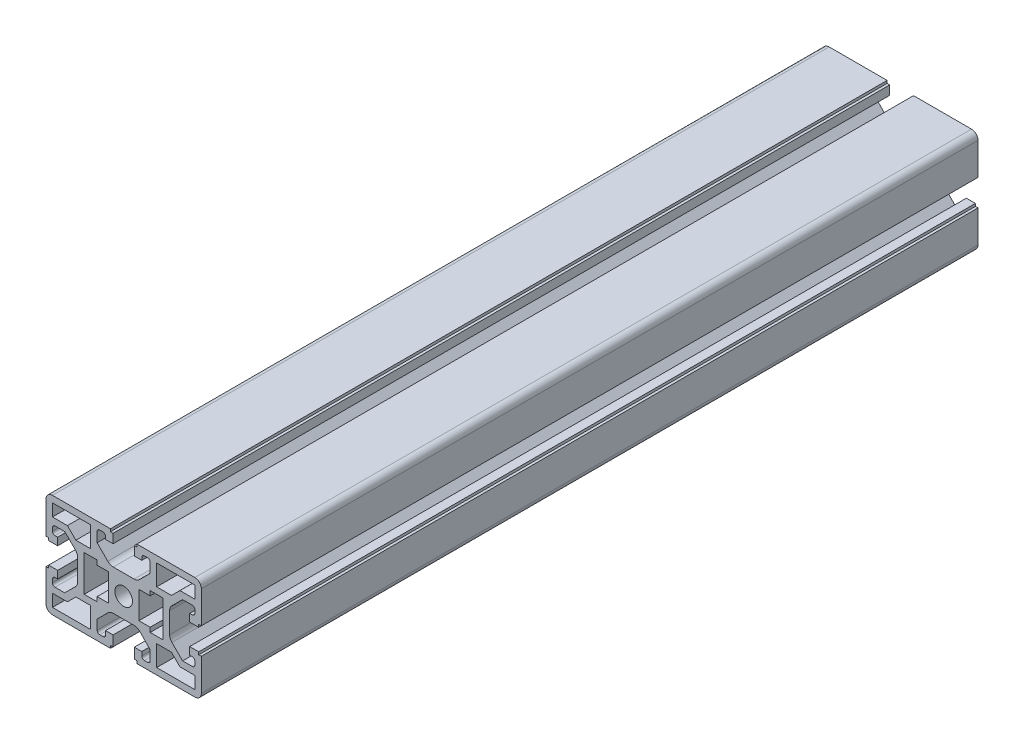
ISO-10303-21;
HEADER;
FILE_DESCRIPTION(('STEP AP214'),'2;1');
FILE_NAME('part.step','',(''),(''),'','','');
FILE_SCHEMA(('AUTOMOTIVE_DESIGN { 1 0 10303 214 1 1 1 1 }'));
ENDSEC;
DATA;
#1=APPLICATION_CONTEXT('core data for automotive mechanical design processes');
#2=APPLICATION_PROTOCOL_DEFINITION('international standard','automotive_design',2000,#1);
#3=PRODUCT_CONTEXT('',#1,'mechanical');
#4=PRODUCT('Part','Part','',(#3));
#5=PRODUCT_RELATED_PRODUCT_CATEGORY('part','',(#4));
#6=PRODUCT_DEFINITION_FORMATION('','',#4);
#7=PRODUCT_DEFINITION_CONTEXT('part definition',#1,'design');
#8=PRODUCT_DEFINITION('design','',#6,#7);
#9=PRODUCT_DEFINITION_SHAPE('','',#8);
#10=(LENGTH_UNIT() NAMED_UNIT(*) SI_UNIT(.MILLI.,.METRE.));
#11=(NAMED_UNIT(*) PLANE_ANGLE_UNIT() SI_UNIT($,.RADIAN.));
#12=(NAMED_UNIT(*) SI_UNIT($,.STERADIAN.) SOLID_ANGLE_UNIT());
#13=UNCERTAINTY_MEASURE_WITH_UNIT(LENGTH_MEASURE(1.E-05),#10,'distance_accuracy_value','');
#14=(GEOMETRIC_REPRESENTATION_CONTEXT(3) GLOBAL_UNCERTAINTY_ASSIGNED_CONTEXT((#13)) GLOBAL_UNIT_ASSIGNED_CONTEXT((#10,
#11,#12)) REPRESENTATION_CONTEXT('',''));
#15=CARTESIAN_POINT('',(0.,0.,0.));
#16=DIRECTION('',(0.,0.,1.));
#17=DIRECTION('',(1.,0.,0.));
#18=AXIS2_PLACEMENT_3D('',#15,#16,#17);
#19=CARTESIAN_POINT('',(-4.02087118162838,-10.7500000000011,150.));
#20=DIRECTION('',(0.,0.,1.));
#21=DIRECTION('',(1.,0.,0.));
#22=AXIS2_PLACEMENT_3D('',#19,#20,#21);
#23=PLANE('',#22);
#24=DIRECTION('',(1.,0.,0.));
#25=VECTOR('',#24,1.);
#26=CARTESIAN_POINT('',(-27.5,-17.5,150.));
#27=LINE('',#26,#25);
#28=CARTESIAN_POINT('',(-27.5,-17.5,150.));
#29=VERTEX_POINT('',#28);
#30=CARTESIAN_POINT('',(-12.75,-17.5,150.));
#31=VERTEX_POINT('',#30);
#32=EDGE_CURVE('E924',#29,#31,#27,.T.);
#33=ORIENTED_EDGE('',*,*,#32,.F.);
#34=DIRECTION('',(0.,-1.,0.));
#35=VECTOR('',#34,1.);
#36=CARTESIAN_POINT('',(-27.5,-12.75,150.));
#37=LINE('',#36,#35);
#38=CARTESIAN_POINT('',(-27.5,-12.75,150.));
#39=VERTEX_POINT('',#38);
#40=EDGE_CURVE('E916',#39,#29,#37,.T.);
#41=ORIENTED_EDGE('',*,*,#40,.F.);
#42=DIRECTION('',(-1.,0.,0.));
#43=VECTOR('',#42,1.);
#44=CARTESIAN_POINT('',(-21.7348150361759,-12.75,150.));
#45=LINE('',#44,#43);
#46=CARTESIAN_POINT('',(-21.7348150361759,-12.75,150.));
#47=VERTEX_POINT('',#46);
#48=EDGE_CURVE('E947',#47,#39,#45,.T.);
#49=ORIENTED_EDGE('',*,*,#48,.F.);
#50=DIRECTION('',(-0.709570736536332,-0.704634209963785,0.));
#51=VECTOR('',#50,1.);
#52=CARTESIAN_POINT('',(-18.4620461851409,-9.5,150.));
#53=LINE('',#52,#51);
#54=CARTESIAN_POINT('',(-18.4620461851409,-9.5,150.));
#55=VERTEX_POINT('',#54);
#56=EDGE_CURVE('E945',#55,#47,#53,.T.);
#57=ORIENTED_EDGE('',*,*,#56,.F.);
#58=DIRECTION('',(-1.,0.,0.));
#59=VECTOR('',#58,1.);
#60=CARTESIAN_POINT('',(-12.75,-9.5,150.));
#61=LINE('',#60,#59);
#62=CARTESIAN_POINT('',(-12.75,-9.5,150.));
#63=VERTEX_POINT('',#62);
#64=EDGE_CURVE('E940',#63,#55,#61,.T.);
#65=ORIENTED_EDGE('',*,*,#64,.F.);
#66=DIRECTION('',(0.,1.,0.));
#67=VECTOR('',#66,1.);
#68=CARTESIAN_POINT('',(-12.75,-17.5,150.));
#69=LINE('',#68,#67);
#70=EDGE_CURVE('E938',#31,#63,#69,.T.);
#71=ORIENTED_EDGE('',*,*,#70,.F.);
#72=EDGE_LOOP('',(#33,#41,#49,#57,#65,#71));
#73=FACE_BOUND('',#72,.T.);
#74=DIRECTION('',(-1.,0.,0.));
#75=VECTOR('',#74,1.);
#76=CARTESIAN_POINT('',(21.7348150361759,-12.75,150.));
#77=LINE('',#76,#75);
#78=CARTESIAN_POINT('',(27.5,-12.75,150.));
#79=VERTEX_POINT('',#78);
#80=CARTESIAN_POINT('',(21.7348150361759,-12.75,150.));
#81=VERTEX_POINT('',#80);
#82=EDGE_CURVE('E1017',#79,#81,#77,.T.);
#83=ORIENTED_EDGE('',*,*,#82,.F.);
#84=DIRECTION('',(0.,1.,0.));
#85=VECTOR('',#84,1.);
#86=CARTESIAN_POINT('',(27.5,-12.75,150.));
#87=LINE('',#86,#85);
#88=CARTESIAN_POINT('',(27.5,-17.5,150.));
#89=VERTEX_POINT('',#88);
#90=EDGE_CURVE('E1015',#89,#79,#87,.T.);
#91=ORIENTED_EDGE('',*,*,#90,.F.);
#92=DIRECTION('',(1.,0.,0.));
#93=VECTOR('',#92,1.);
#94=CARTESIAN_POINT('',(27.5,-17.5,150.));
#95=LINE('',#94,#93);
#96=CARTESIAN_POINT('',(12.75,-17.5,150.));
#97=VERTEX_POINT('',#96);
#98=EDGE_CURVE('E1027',#97,#89,#95,.T.);
#99=ORIENTED_EDGE('',*,*,#98,.F.);
#100=DIRECTION('',(0.,-1.,0.));
#101=VECTOR('',#100,1.);
#102=CARTESIAN_POINT('',(12.75,-17.5,150.));
#103=LINE('',#102,#101);
#104=CARTESIAN_POINT('',(12.75,-9.5,150.));
#105=VERTEX_POINT('',#104);
#106=EDGE_CURVE('E1024',#105,#97,#103,.T.);
#107=ORIENTED_EDGE('',*,*,#106,.F.);
#108=DIRECTION('',(-1.,0.,0.));
#109=VECTOR('',#108,1.);
#110=CARTESIAN_POINT('',(12.75,-9.5,150.));
#111=LINE('',#110,#109);
#112=CARTESIAN_POINT('',(18.4620461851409,-9.5,150.));
#113=VERTEX_POINT('',#112);
#114=EDGE_CURVE('E1022',#113,#105,#111,.T.);
#115=ORIENTED_EDGE('',*,*,#114,.F.);
#116=DIRECTION('',(-0.709570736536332,0.704634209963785,0.));
#117=VECTOR('',#116,1.);
#118=CARTESIAN_POINT('',(18.4620461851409,-9.5,150.));
#119=LINE('',#118,#117);
#120=EDGE_CURVE('E1020',#81,#113,#119,.T.);
#121=ORIENTED_EDGE('',*,*,#120,.F.);
#122=EDGE_LOOP('',(#83,#91,#99,#107,#115,#121));
#123=FACE_BOUND('',#122,.T.);
#124=DIRECTION('',(1.,0.,0.));
#125=VECTOR('',#124,1.);
#126=CARTESIAN_POINT('',(-21.7348150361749,12.75,150.));
#127=LINE('',#126,#125);
#128=CARTESIAN_POINT('',(-27.5,12.75,150.));
#129=VERTEX_POINT('',#128);
#130=CARTESIAN_POINT('',(-21.7348150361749,12.75,150.));
#131=VERTEX_POINT('',#130);
#132=EDGE_CURVE('E1121',#129,#131,#127,.T.);
#133=ORIENTED_EDGE('',*,*,#132,.F.);
#134=DIRECTION('',(0.,-1.,0.));
#135=VECTOR('',#134,1.);
#136=CARTESIAN_POINT('',(-27.5,12.75,150.));
#137=LINE('',#136,#135);
#138=CARTESIAN_POINT('',(-27.5,17.4999999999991,150.));
#139=VERTEX_POINT('',#138);
#140=EDGE_CURVE('E1119',#139,#129,#137,.T.);
#141=ORIENTED_EDGE('',*,*,#140,.F.);
#142=DIRECTION('',(-1.,0.,0.));
#143=VECTOR('',#142,1.);
#144=CARTESIAN_POINT('',(-27.5,17.4999999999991,150.));
#145=LINE('',#144,#143);
#146=CARTESIAN_POINT('',(-12.7499999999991,17.4999999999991,150.));
#147=VERTEX_POINT('',#146);
#148=EDGE_CURVE('E1131',#147,#139,#145,.T.);
#149=ORIENTED_EDGE('',*,*,#148,.F.);
#150=DIRECTION('',(0.,1.,0.));
#151=VECTOR('',#150,1.);
#152=CARTESIAN_POINT('',(-12.7499999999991,17.4999999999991,150.));
#153=LINE('',#152,#151);
#154=CARTESIAN_POINT('',(-12.7499999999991,9.5,150.));
#155=VERTEX_POINT('',#154);
#156=EDGE_CURVE('E1128',#155,#147,#153,.T.);
#157=ORIENTED_EDGE('',*,*,#156,.F.);
#158=DIRECTION('',(1.,0.,0.));
#159=VECTOR('',#158,1.);
#160=CARTESIAN_POINT('',(-12.7499999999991,9.5,150.));
#161=LINE('',#160,#159);
#162=CARTESIAN_POINT('',(-18.46204618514,9.5,150.));
#163=VERTEX_POINT('',#162);
#164=EDGE_CURVE('E1126',#163,#155,#161,.T.);
#165=ORIENTED_EDGE('',*,*,#164,.F.);
#166=DIRECTION('',(0.709570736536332,-0.704634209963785,0.));
#167=VECTOR('',#166,1.);
#168=CARTESIAN_POINT('',(-18.46204618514,9.5,150.));
#169=LINE('',#168,#167);
#170=EDGE_CURVE('E1124',#131,#163,#169,.T.);
#171=ORIENTED_EDGE('',*,*,#170,.F.);
#172=EDGE_LOOP('',(#133,#141,#149,#157,#165,#171));
#173=FACE_BOUND('',#172,.T.);
#174=CARTESIAN_POINT('',(-4.02087118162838,-10.7500000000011,150.));
#175=DIRECTION('',(0.,0.,-1.));
#176=DIRECTION('',(1.,0.,0.));
#177=AXIS2_PLACEMENT_3D('',#174,#175,#176);
#178=CIRCLE('',#177,3.00000000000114);
#179=CARTESIAN_POINT('',(-6.14958339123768,-8.63609737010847,150.));
#180=VERTEX_POINT('',#179);
#181=CARTESIAN_POINT('',(-4.02087118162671,-7.75,150.));
#182=VERTEX_POINT('',#181);
#183=EDGE_CURVE('E1223',#180,#182,#178,.T.);
#184=ORIENTED_EDGE('',*,*,#183,.T.);
#185=DIRECTION('',(1.,0.,0.));
#186=VECTOR('',#185,1.);
#187=CARTESIAN_POINT('',(-4.02087118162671,-7.75,150.));
#188=LINE('',#187,#186);
#189=CARTESIAN_POINT('',(4.02087118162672,-7.75,150.));
#190=VERTEX_POINT('',#189);
#191=EDGE_CURVE('E1226',#182,#190,#188,.T.);
#192=ORIENTED_EDGE('',*,*,#191,.T.);
#193=CARTESIAN_POINT('',(4.02087118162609,-10.7499999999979,150.));
#194=DIRECTION('',(0.,0.,-1.));
#195=DIRECTION('',(1.,0.,0.));
#196=AXIS2_PLACEMENT_3D('',#193,#194,#195);
#197=CIRCLE('',#196,2.99999999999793);
#198=CARTESIAN_POINT('',(6.14958339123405,-8.63609737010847,150.));
#199=VERTEX_POINT('',#198);
#200=EDGE_CURVE('E1229',#190,#199,#197,.T.);
#201=ORIENTED_EDGE('',*,*,#200,.T.);
#202=DIRECTION('',(0.704634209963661,-0.709570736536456,0.));
#203=VECTOR('',#202,1.);
#204=CARTESIAN_POINT('',(6.14958339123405,-8.63609737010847,150.));
#205=LINE('',#204,#203);
#206=CARTESIAN_POINT('',(10.25,-12.7652406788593,150.));
#207=VERTEX_POINT('',#206);
#208=EDGE_CURVE('E1231',#199,#207,#205,.T.);
#209=ORIENTED_EDGE('',*,*,#208,.T.);
#210=DIRECTION('',(0.,-1.,0.));
#211=VECTOR('',#210,1.);
#212=CARTESIAN_POINT('',(10.25,-12.7652406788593,150.));
#213=LINE('',#212,#211);
#214=CARTESIAN_POINT('',(10.25,-16.5,150.));
#215=VERTEX_POINT('',#214);
#216=EDGE_CURVE('E1233',#207,#215,#213,.T.);
#217=ORIENTED_EDGE('',*,*,#216,.T.);
#218=CARTESIAN_POINT('',(9.24999999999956,-16.4999999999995,150.));
#219=DIRECTION('',(0.,0.,-1.));
#220=DIRECTION('',(1.,0.,0.));
#221=AXIS2_PLACEMENT_3D('',#218,#219,#220);
#222=CIRCLE('',#221,1.00000000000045);
#223=CARTESIAN_POINT('',(9.25000000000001,-17.5,150.));
#224=VERTEX_POINT('',#223);
#225=EDGE_CURVE('E1235',#215,#224,#222,.T.);
#226=ORIENTED_EDGE('',*,*,#225,.T.);
#227=DIRECTION('',(-1.,0.,0.));
#228=VECTOR('',#227,1.);
#229=CARTESIAN_POINT('',(9.25000000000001,-17.5,150.));
#230=LINE('',#229,#228);
#231=CARTESIAN_POINT('',(8.00000000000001,-17.5,150.));
#232=VERTEX_POINT('',#231);
#233=EDGE_CURVE('E1237',#224,#232,#230,.T.);
#234=ORIENTED_EDGE('',*,*,#233,.T.);
#235=CARTESIAN_POINT('',(8.00000000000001,-16.5,150.));
#236=DIRECTION('',(0.,0.,-1.));
#237=DIRECTION('',(1.,0.,0.));
#238=AXIS2_PLACEMENT_3D('',#235,#236,#237);
#239=CIRCLE('',#238,1.);
#240=CARTESIAN_POINT('',(7.00000000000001,-16.5,150.));
#241=VERTEX_POINT('',#240);
#242=EDGE_CURVE('E1239',#232,#241,#239,.T.);
#243=ORIENTED_EDGE('',*,*,#242,.T.);
#244=DIRECTION('',(0.,1.,0.));
#245=VECTOR('',#244,1.);
#246=CARTESIAN_POINT('',(7.00000000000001,-16.5,150.));
#247=LINE('',#246,#245);
#248=CARTESIAN_POINT('',(7.00000000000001,-15.,150.));
#249=VERTEX_POINT('',#248);
#250=EDGE_CURVE('E1241',#241,#249,#247,.T.);
#251=ORIENTED_EDGE('',*,*,#250,.T.);
#252=DIRECTION('',(-1.,0.,0.));
#253=VECTOR('',#252,1.);
#254=CARTESIAN_POINT('',(7.00000000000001,-15.,150.));
#255=LINE('',#254,#253);
#256=CARTESIAN_POINT('',(4.09999999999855,-15.,150.));
#257=VERTEX_POINT('',#256);
#258=EDGE_CURVE('E1243',#249,#257,#255,.T.);
#259=ORIENTED_EDGE('',*,*,#258,.T.);
#260=DIRECTION('',(0.,-1.,0.));
#261=VECTOR('',#260,1.);
#262=CARTESIAN_POINT('',(4.09999999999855,-15.,150.));
#263=LINE('',#262,#261);
#264=CARTESIAN_POINT('',(4.09999999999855,-19.,150.));
#265=VERTEX_POINT('',#264);
#266=EDGE_CURVE('E1245',#257,#265,#263,.T.);
#267=ORIENTED_EDGE('',*,*,#266,.T.);
#268=DIRECTION('',(1.,0.,0.));
#269=VECTOR('',#268,1.);
#270=CARTESIAN_POINT('',(4.09999999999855,-19.,150.));
#271=LINE('',#270,#269);
#272=CARTESIAN_POINT('',(5.09999999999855,-19.,150.));
#273=VERTEX_POINT('',#272);
#274=EDGE_CURVE('E1247',#265,#273,#271,.T.);
#275=ORIENTED_EDGE('',*,*,#274,.T.);
#276=DIRECTION('',(0.,-1.,0.));
#277=VECTOR('',#276,1.);
#278=CARTESIAN_POINT('',(5.09999999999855,-19.,150.));
#279=LINE('',#278,#277);
#280=CARTESIAN_POINT('',(5.09999999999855,-20.,150.));
#281=VERTEX_POINT('',#280);
#282=EDGE_CURVE('E1249',#273,#281,#279,.T.);
#283=ORIENTED_EDGE('',*,*,#282,.T.);
#284=DIRECTION('',(1.,0.,0.));
#285=VECTOR('',#284,1.);
#286=CARTESIAN_POINT('',(5.09999999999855,-20.,150.));
#287=LINE('',#286,#285);
#288=CARTESIAN_POINT('',(27.5,-20.,150.));
#289=VERTEX_POINT('',#288);
#290=EDGE_CURVE('E1251',#281,#289,#287,.T.);
#291=ORIENTED_EDGE('',*,*,#290,.T.);
#292=CARTESIAN_POINT('',(27.5,-17.5,150.));
#293=DIRECTION('',(0.,0.,1.));
#294=DIRECTION('',(1.,0.,0.));
#295=AXIS2_PLACEMENT_3D('',#292,#293,#294);
#296=CIRCLE('',#295,2.5);
#297=CARTESIAN_POINT('',(30.,-17.5,150.));
#298=VERTEX_POINT('',#297);
#299=EDGE_CURVE('E1253',#289,#298,#296,.T.);
#300=ORIENTED_EDGE('',*,*,#299,.T.);
#301=DIRECTION('',(0.,1.,0.));
#302=VECTOR('',#301,1.);
#303=CARTESIAN_POINT('',(30.,-17.5,150.));
#304=LINE('',#303,#302);
#305=CARTESIAN_POINT('',(30.,-5.10000000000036,150.));
#306=VERTEX_POINT('',#305);
#307=EDGE_CURVE('E1255',#298,#306,#304,.T.);
#308=ORIENTED_EDGE('',*,*,#307,.T.);
#309=DIRECTION('',(-1.,0.,0.));
#310=VECTOR('',#309,1.);
#311=CARTESIAN_POINT('',(30.,-5.10000000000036,150.));
#312=LINE('',#311,#310);
#313=CARTESIAN_POINT('',(29.,-5.10000000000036,150.));
#314=VERTEX_POINT('',#313);
#315=EDGE_CURVE('E1257',#306,#314,#312,.T.);
#316=ORIENTED_EDGE('',*,*,#315,.T.);
#317=DIRECTION('',(0.,1.,0.));
#318=VECTOR('',#317,1.);
#319=CARTESIAN_POINT('',(29.,-5.10000000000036,150.));
#320=LINE('',#319,#318);
#321=CARTESIAN_POINT('',(29.,-4.10000000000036,150.));
#322=VERTEX_POINT('',#321);
#323=EDGE_CURVE('E1259',#314,#322,#320,.T.);
#324=ORIENTED_EDGE('',*,*,#323,.T.);
#325=DIRECTION('',(-1.,0.,0.));
#326=VECTOR('',#325,1.);
#327=CARTESIAN_POINT('',(29.,-4.10000000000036,150.));
#328=LINE('',#327,#326);
#329=CARTESIAN_POINT('',(25.5,-4.10000000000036,150.));
#330=VERTEX_POINT('',#329);
#331=EDGE_CURVE('E1261',#322,#330,#328,.T.);
#332=ORIENTED_EDGE('',*,*,#331,.T.);
#333=DIRECTION('',(0.,-1.,0.));
#334=VECTOR('',#333,1.);
#335=CARTESIAN_POINT('',(25.5,-4.10000000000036,150.));
#336=LINE('',#335,#334);
#337=CARTESIAN_POINT('',(25.5,-7.,150.));
#338=VERTEX_POINT('',#337);
#339=EDGE_CURVE('E1263',#330,#338,#336,.T.);
#340=ORIENTED_EDGE('',*,*,#339,.T.);
#341=DIRECTION('',(1.,0.,0.));
#342=VECTOR('',#341,1.);
#343=CARTESIAN_POINT('',(25.5,-7.,150.));
#344=LINE('',#343,#342);
#345=CARTESIAN_POINT('',(26.5,-7.,150.));
#346=VERTEX_POINT('',#345);
#347=EDGE_CURVE('E1265',#338,#346,#344,.T.);
#348=ORIENTED_EDGE('',*,*,#347,.T.);
#349=CARTESIAN_POINT('',(26.5,-8.,150.));
#350=DIRECTION('',(0.,0.,-1.));
#351=DIRECTION('',(1.,0.,0.));
#352=AXIS2_PLACEMENT_3D('',#349,#350,#351);
#353=CIRCLE('',#352,1.);
#354=CARTESIAN_POINT('',(27.5,-8.,150.));
#355=VERTEX_POINT('',#354);
#356=EDGE_CURVE('E1267',#346,#355,#353,.T.);
#357=ORIENTED_EDGE('',*,*,#356,.T.);
#358=DIRECTION('',(0.,-1.,0.));
#359=VECTOR('',#358,1.);
#360=CARTESIAN_POINT('',(27.5,-8.,150.));
#361=LINE('',#360,#359);
#362=CARTESIAN_POINT('',(27.5,-9.25,150.));
#363=VERTEX_POINT('',#362);
#364=EDGE_CURVE('E1269',#355,#363,#361,.T.);
#365=ORIENTED_EDGE('',*,*,#364,.T.);
#366=CARTESIAN_POINT('',(26.5,-9.25,150.));
#367=DIRECTION('',(0.,0.,-1.));
#368=DIRECTION('',(1.,0.,0.));
#369=AXIS2_PLACEMENT_3D('',#366,#367,#368);
#370=CIRCLE('',#369,1.);
#371=CARTESIAN_POINT('',(26.5,-10.25,150.));
#372=VERTEX_POINT('',#371);
#373=EDGE_CURVE('E1271',#363,#372,#370,.T.);
#374=ORIENTED_EDGE('',*,*,#373,.T.);
#375=DIRECTION('',(-1.,0.,0.));
#376=VECTOR('',#375,1.);
#377=CARTESIAN_POINT('',(26.5,-10.25,150.));
#378=LINE('',#377,#376);
#379=CARTESIAN_POINT('',(22.7652406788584,-10.25,150.));
#380=VERTEX_POINT('',#379);
#381=EDGE_CURVE('E1273',#372,#380,#378,.T.);
#382=ORIENTED_EDGE('',*,*,#381,.T.);
#383=DIRECTION('',(-0.709570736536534,0.704634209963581,0.));
#384=VECTOR('',#383,1.);
#385=CARTESIAN_POINT('',(22.7652406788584,-10.25,150.));
#386=LINE('',#385,#384);
#387=CARTESIAN_POINT('',(18.6360973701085,-6.14958339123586,150.));
#388=VERTEX_POINT('',#387);
#389=EDGE_CURVE('E1275',#380,#388,#386,.T.);
#390=ORIENTED_EDGE('',*,*,#389,.T.);
#391=CARTESIAN_POINT('',(20.7499999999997,-4.02087118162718,150.));
#392=DIRECTION('',(0.,0.,-1.));
#393=DIRECTION('',(1.,0.,0.));
#394=AXIS2_PLACEMENT_3D('',#391,#392,#393);
#395=CIRCLE('',#394,2.99999999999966);
#396=CARTESIAN_POINT('',(17.75,-4.02087118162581,150.));
#397=VERTEX_POINT('',#396);
#398=EDGE_CURVE('E1277',#388,#397,#395,.T.);
#399=ORIENTED_EDGE('',*,*,#398,.T.);
#400=DIRECTION('',(0.,1.,0.));
#401=VECTOR('',#400,1.);
#402=CARTESIAN_POINT('',(17.75,-4.02087118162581,150.));
#403=LINE('',#402,#401);
#404=CARTESIAN_POINT('',(17.75,4.02087118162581,150.));
#405=VERTEX_POINT('',#404);
#406=EDGE_CURVE('E1279',#397,#405,#403,.T.);
#407=ORIENTED_EDGE('',*,*,#406,.T.);
#408=CARTESIAN_POINT('',(20.7500000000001,4.02087118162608,150.));
#409=DIRECTION('',(0.,0.,-1.));
#410=DIRECTION('',(1.,0.,0.));
#411=AXIS2_PLACEMENT_3D('',#408,#409,#410);
#412=CIRCLE('',#411,3.00000000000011);
#413=CARTESIAN_POINT('',(18.6360973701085,6.14958339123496,150.));
#414=VERTEX_POINT('',#413);
#415=EDGE_CURVE('E1281',#405,#414,#412,.T.);
#416=ORIENTED_EDGE('',*,*,#415,.T.);
#417=DIRECTION('',(0.709570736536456,0.70463420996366,0.));
#418=VECTOR('',#417,1.);
#419=CARTESIAN_POINT('',(18.6360973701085,6.14958339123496,150.));
#420=LINE('',#419,#418);
#421=CARTESIAN_POINT('',(22.7652406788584,10.25,150.));
#422=VERTEX_POINT('',#421);
#423=EDGE_CURVE('E1283',#414,#422,#420,.T.);
#424=ORIENTED_EDGE('',*,*,#423,.T.);
#425=DIRECTION('',(1.,0.,0.));
#426=VECTOR('',#425,1.);
#427=CARTESIAN_POINT('',(22.7652406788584,10.25,150.));
#428=LINE('',#427,#426);
#429=CARTESIAN_POINT('',(26.5,10.25,150.));
#430=VERTEX_POINT('',#429);
#431=EDGE_CURVE('E1285',#422,#430,#428,.T.);
#432=ORIENTED_EDGE('',*,*,#431,.T.);
#433=CARTESIAN_POINT('',(26.5,9.25,150.));
#434=DIRECTION('',(0.,0.,-1.));
#435=DIRECTION('',(1.,0.,0.));
#436=AXIS2_PLACEMENT_3D('',#433,#434,#435);
#437=CIRCLE('',#436,1.);
#438=CARTESIAN_POINT('',(27.5,9.25,150.));
#439=VERTEX_POINT('',#438);
#440=EDGE_CURVE('E1287',#430,#439,#437,.T.);
#441=ORIENTED_EDGE('',*,*,#440,.T.);
#442=DIRECTION('',(0.,-1.,0.));
#443=VECTOR('',#442,1.);
#444=CARTESIAN_POINT('',(27.5,9.25,150.));
#445=LINE('',#444,#443);
#446=CARTESIAN_POINT('',(27.5,8.,150.));
#447=VERTEX_POINT('',#446);
#448=EDGE_CURVE('E1289',#439,#447,#445,.T.);
#449=ORIENTED_EDGE('',*,*,#448,.T.);
#450=CARTESIAN_POINT('',(26.5,8.,150.));
#451=DIRECTION('',(0.,0.,-1.));
#452=DIRECTION('',(1.,0.,0.));
#453=AXIS2_PLACEMENT_3D('',#450,#451,#452);
#454=CIRCLE('',#453,1.);
#455=CARTESIAN_POINT('',(26.5,7.,150.));
#456=VERTEX_POINT('',#455);
#457=EDGE_CURVE('E1291',#447,#456,#454,.T.);
#458=ORIENTED_EDGE('',*,*,#457,.T.);
#459=DIRECTION('',(-1.,0.,0.));
#460=VECTOR('',#459,1.);
#461=CARTESIAN_POINT('',(26.5,7.,150.));
#462=LINE('',#461,#460);
#463=CARTESIAN_POINT('',(25.5,7.,150.));
#464=VERTEX_POINT('',#463);
#465=EDGE_CURVE('E1293',#456,#464,#462,.T.);
#466=ORIENTED_EDGE('',*,*,#465,.T.);
#467=DIRECTION('',(0.,-1.,0.));
#468=VECTOR('',#467,1.);
#469=CARTESIAN_POINT('',(25.5,7.,150.));
#470=LINE('',#469,#468);
#471=CARTESIAN_POINT('',(25.5,4.09999999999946,150.));
#472=VERTEX_POINT('',#471);
#473=EDGE_CURVE('E1295',#464,#472,#470,.T.);
#474=ORIENTED_EDGE('',*,*,#473,.T.);
#475=DIRECTION('',(1.,0.,0.));
#476=VECTOR('',#475,1.);
#477=CARTESIAN_POINT('',(25.5,4.09999999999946,150.));
#478=LINE('',#477,#476);
#479=CARTESIAN_POINT('',(29.,4.09999999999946,150.));
#480=VERTEX_POINT('',#479);
#481=EDGE_CURVE('E1297',#472,#480,#478,.T.);
#482=ORIENTED_EDGE('',*,*,#481,.T.);
#483=DIRECTION('',(0.,1.,0.));
#484=VECTOR('',#483,1.);
#485=CARTESIAN_POINT('',(29.,4.09999999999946,150.));
#486=LINE('',#485,#484);
#487=CARTESIAN_POINT('',(29.,5.10000000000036,150.));
#488=VERTEX_POINT('',#487);
#489=EDGE_CURVE('E1299',#480,#488,#486,.T.);
#490=ORIENTED_EDGE('',*,*,#489,.T.);
#491=DIRECTION('',(1.,0.,0.));
#492=VECTOR('',#491,1.);
#493=CARTESIAN_POINT('',(29.,5.10000000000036,150.));
#494=LINE('',#493,#492);
#495=CARTESIAN_POINT('',(30.0000000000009,5.10000000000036,150.));
#496=VERTEX_POINT('',#495);
#497=EDGE_CURVE('E1301',#488,#496,#494,.T.);
#498=ORIENTED_EDGE('',*,*,#497,.T.);
#499=DIRECTION('',(0.,1.,0.));
#500=VECTOR('',#499,1.);
#501=CARTESIAN_POINT('',(30.0000000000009,5.10000000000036,150.));
#502=LINE('',#501,#500);
#503=CARTESIAN_POINT('',(30.0000000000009,17.4999999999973,150.));
#504=VERTEX_POINT('',#503);
#505=EDGE_CURVE('E1303',#496,#504,#502,.T.);
#506=ORIENTED_EDGE('',*,*,#505,.T.);
#507=CARTESIAN_POINT('',(27.5000000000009,17.4999999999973,150.));
#508=DIRECTION('',(0.,0.,1.));
#509=DIRECTION('',(1.,0.,0.));
#510=AXIS2_PLACEMENT_3D('',#507,#508,#509);
#511=CIRCLE('',#510,2.5);
#512=CARTESIAN_POINT('',(27.5000000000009,19.9999999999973,150.));
#513=VERTEX_POINT('',#512);
#514=EDGE_CURVE('E1305',#504,#513,#511,.T.);
#515=ORIENTED_EDGE('',*,*,#514,.T.);
#516=DIRECTION('',(-1.,0.,0.));
#517=VECTOR('',#516,1.);
#518=CARTESIAN_POINT('',(27.5000000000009,19.9999999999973,150.));
#519=LINE('',#518,#517);
#520=CARTESIAN_POINT('',(5.09999999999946,19.9999999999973,150.));
#521=VERTEX_POINT('',#520);
#522=EDGE_CURVE('E1307',#513,#521,#519,.T.);
#523=ORIENTED_EDGE('',*,*,#522,.T.);
#524=DIRECTION('',(0.,-1.,0.));
#525=VECTOR('',#524,1.);
#526=CARTESIAN_POINT('',(5.09999999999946,19.9999999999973,150.));
#527=LINE('',#526,#525);
#528=CARTESIAN_POINT('',(5.09999999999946,18.9999999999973,150.));
#529=VERTEX_POINT('',#528);
#530=EDGE_CURVE('E1309',#521,#529,#527,.T.);
#531=ORIENTED_EDGE('',*,*,#530,.T.);
#532=DIRECTION('',(-1.,0.,0.));
#533=VECTOR('',#532,1.);
#534=CARTESIAN_POINT('',(5.09999999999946,18.9999999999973,150.));
#535=LINE('',#534,#533);
#536=CARTESIAN_POINT('',(4.09999999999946,18.9999999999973,150.));
#537=VERTEX_POINT('',#536);
#538=EDGE_CURVE('E1311',#529,#537,#535,.T.);
#539=ORIENTED_EDGE('',*,*,#538,.T.);
#540=DIRECTION('',(0.,-1.,0.));
#541=VECTOR('',#540,1.);
#542=CARTESIAN_POINT('',(4.09999999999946,18.9999999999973,150.));
#543=LINE('',#542,#541);
#544=CARTESIAN_POINT('',(4.09999999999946,15.4999999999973,150.));
#545=VERTEX_POINT('',#544);
#546=EDGE_CURVE('E1313',#537,#545,#543,.T.);
#547=ORIENTED_EDGE('',*,*,#546,.T.);
#548=DIRECTION('',(1.,0.,0.));
#549=VECTOR('',#548,1.);
#550=CARTESIAN_POINT('',(4.09999999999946,15.4999999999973,150.));
#551=LINE('',#550,#549);
#552=CARTESIAN_POINT('',(7.00000000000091,15.4999999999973,150.));
#553=VERTEX_POINT('',#552);
#554=EDGE_CURVE('E1315',#545,#553,#551,.T.);
#555=ORIENTED_EDGE('',*,*,#554,.T.);
#556=DIRECTION('',(0.,1.,0.));
#557=VECTOR('',#556,1.);
#558=CARTESIAN_POINT('',(7.00000000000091,15.4999999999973,150.));
#559=LINE('',#558,#557);
#560=CARTESIAN_POINT('',(7.00000000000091,16.4999999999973,150.));
#561=VERTEX_POINT('',#560);
#562=EDGE_CURVE('E1317',#553,#561,#559,.T.);
#563=ORIENTED_EDGE('',*,*,#562,.T.);
#564=CARTESIAN_POINT('',(8.00000000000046,16.4999999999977,150.));
#565=DIRECTION('',(0.,0.,-1.));
#566=DIRECTION('',(1.,0.,0.));
#567=AXIS2_PLACEMENT_3D('',#564,#565,#566);
#568=CIRCLE('',#567,0.999999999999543);
#569=CARTESIAN_POINT('',(8.00000000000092,17.4999999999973,150.));
#570=VERTEX_POINT('',#569);
#571=EDGE_CURVE('E1319',#561,#570,#568,.T.);
#572=ORIENTED_EDGE('',*,*,#571,.T.);
#573=DIRECTION('',(1.,0.,0.));
#574=VECTOR('',#573,1.);
#575=CARTESIAN_POINT('',(8.00000000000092,17.4999999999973,150.));
#576=LINE('',#575,#574);
#577=CARTESIAN_POINT('',(9.25000000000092,17.4999999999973,150.));
#578=VERTEX_POINT('',#577);
#579=EDGE_CURVE('E1321',#570,#578,#576,.T.);
#580=ORIENTED_EDGE('',*,*,#579,.T.);
#581=CARTESIAN_POINT('',(9.25000000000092,16.4999999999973,150.));
#582=DIRECTION('',(0.,0.,-1.));
#583=DIRECTION('',(1.,0.,0.));
#584=AXIS2_PLACEMENT_3D('',#581,#582,#583);
#585=CIRCLE('',#584,0.999999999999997);
#586=CARTESIAN_POINT('',(10.2500000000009,16.4999999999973,150.));
#587=VERTEX_POINT('',#586);
#588=EDGE_CURVE('E1323',#578,#587,#585,.T.);
#589=ORIENTED_EDGE('',*,*,#588,.T.);
#590=DIRECTION('',(0.,-1.,0.));
#591=VECTOR('',#590,1.);
#592=CARTESIAN_POINT('',(10.2500000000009,16.4999999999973,150.));
#593=LINE('',#592,#591);
#594=CARTESIAN_POINT('',(10.2500000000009,12.7652406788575,150.));
#595=VERTEX_POINT('',#594);
#596=EDGE_CURVE('E1325',#587,#595,#593,.T.);
#597=ORIENTED_EDGE('',*,*,#596,.T.);
#598=DIRECTION('',(-0.704634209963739,-0.709570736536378,0.));
#599=VECTOR('',#598,1.);
#600=CARTESIAN_POINT('',(10.2500000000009,12.7652406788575,150.));
#601=LINE('',#600,#599);
#602=CARTESIAN_POINT('',(6.14958339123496,8.63609737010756,150.));
#603=VERTEX_POINT('',#602);
#604=EDGE_CURVE('E1327',#595,#603,#601,.T.);
#605=ORIENTED_EDGE('',*,*,#604,.T.);
#606=CARTESIAN_POINT('',(4.02087118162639,10.7499999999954,150.));
#607=DIRECTION('',(0.,0.,-1.));
#608=DIRECTION('',(1.,0.,0.));
#609=AXIS2_PLACEMENT_3D('',#606,#607,#608);
#610=CIRCLE('',#609,2.99999999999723);
#611=CARTESIAN_POINT('',(4.02087118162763,7.74999999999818,150.));
#612=VERTEX_POINT('',#611);
#613=EDGE_CURVE('E1329',#603,#612,#610,.T.);
#614=ORIENTED_EDGE('',*,*,#613,.T.);
#615=DIRECTION('',(-1.,0.,0.));
#616=VECTOR('',#615,1.);
#617=CARTESIAN_POINT('',(4.02087118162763,7.74999999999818,150.));
#618=LINE('',#617,#616);
#619=CARTESIAN_POINT('',(-4.0208711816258,7.74999999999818,150.));
#620=VERTEX_POINT('',#619);
#621=EDGE_CURVE('E1331',#612,#620,#618,.T.);
#622=ORIENTED_EDGE('',*,*,#621,.T.);
#623=CARTESIAN_POINT('',(-4.02087118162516,10.7499999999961,150.));
#624=DIRECTION('',(0.,0.,-1.));
#625=DIRECTION('',(1.,0.,0.));
#626=AXIS2_PLACEMENT_3D('',#623,#624,#625);
#627=CIRCLE('',#626,2.99999999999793);
#628=CARTESIAN_POINT('',(-6.14958339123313,8.63609737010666,150.));
#629=VERTEX_POINT('',#628);
#630=EDGE_CURVE('E1333',#620,#629,#627,.T.);
#631=ORIENTED_EDGE('',*,*,#630,.T.);
#632=DIRECTION('',(-0.70463420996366,0.709570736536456,0.));
#633=VECTOR('',#632,1.);
#634=CARTESIAN_POINT('',(-6.14958339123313,8.63609737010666,150.));
#635=LINE('',#634,#633);
#636=CARTESIAN_POINT('',(-10.2499999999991,12.7652406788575,150.));
#637=VERTEX_POINT('',#636);
#638=EDGE_CURVE('E1335',#629,#637,#635,.T.);
#639=ORIENTED_EDGE('',*,*,#638,.T.);
#640=DIRECTION('',(0.,1.,0.));
#641=VECTOR('',#640,1.);
#642=CARTESIAN_POINT('',(-10.2499999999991,12.7652406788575,150.));
#643=LINE('',#642,#641);
#644=CARTESIAN_POINT('',(-10.2499999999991,16.4999999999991,150.));
#645=VERTEX_POINT('',#644);
#646=EDGE_CURVE('E1337',#637,#645,#643,.T.);
#647=ORIENTED_EDGE('',*,*,#646,.T.);
#648=CARTESIAN_POINT('',(-9.24999999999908,16.4999999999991,150.));
#649=DIRECTION('',(0.,0.,-1.));
#650=DIRECTION('',(1.,0.,0.));
#651=AXIS2_PLACEMENT_3D('',#648,#649,#650);
#652=CIRCLE('',#651,0.999999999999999);
#653=CARTESIAN_POINT('',(-9.24999999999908,17.4999999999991,150.));
#654=VERTEX_POINT('',#653);
#655=EDGE_CURVE('E1339',#645,#654,#652,.T.);
#656=ORIENTED_EDGE('',*,*,#655,.T.);
#657=DIRECTION('',(1.,0.,0.));
#658=VECTOR('',#657,1.);
#659=CARTESIAN_POINT('',(-9.24999999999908,17.4999999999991,150.));
#660=LINE('',#659,#658);
#661=CARTESIAN_POINT('',(-7.99999999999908,17.4999999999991,150.));
#662=VERTEX_POINT('',#661);
#663=EDGE_CURVE('E1341',#654,#662,#660,.T.);
#664=ORIENTED_EDGE('',*,*,#663,.T.);
#665=CARTESIAN_POINT('',(-7.99999999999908,16.4999999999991,150.));
#666=DIRECTION('',(0.,0.,-1.));
#667=DIRECTION('',(1.,0.,0.));
#668=AXIS2_PLACEMENT_3D('',#665,#666,#667);
#669=CIRCLE('',#668,1.);
#670=CARTESIAN_POINT('',(-6.99999999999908,16.4999999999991,150.));
#671=VERTEX_POINT('',#670);
#672=EDGE_CURVE('E1343',#662,#671,#669,.T.);
#673=ORIENTED_EDGE('',*,*,#672,.T.);
#674=DIRECTION('',(0.,-1.,0.));
#675=VECTOR('',#674,1.);
#676=CARTESIAN_POINT('',(-6.99999999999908,16.4999999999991,150.));
#677=LINE('',#676,#675);
#678=CARTESIAN_POINT('',(-6.99999999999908,15.4999999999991,150.));
#679=VERTEX_POINT('',#678);
#680=EDGE_CURVE('E1345',#671,#679,#677,.T.);
#681=ORIENTED_EDGE('',*,*,#680,.T.);
#682=DIRECTION('',(1.,0.,0.));
#683=VECTOR('',#682,1.);
#684=CARTESIAN_POINT('',(-6.99999999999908,15.4999999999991,150.));
#685=LINE('',#684,#683);
#686=CARTESIAN_POINT('',(-4.10000000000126,15.4999999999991,150.));
#687=VERTEX_POINT('',#686);
#688=EDGE_CURVE('E1347',#679,#687,#685,.T.);
#689=ORIENTED_EDGE('',*,*,#688,.T.);
#690=DIRECTION('',(0.,1.,0.));
#691=VECTOR('',#690,1.);
#692=CARTESIAN_POINT('',(-4.10000000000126,15.4999999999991,150.));
#693=LINE('',#692,#691);
#694=CARTESIAN_POINT('',(-4.10000000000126,18.9999999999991,150.));
#695=VERTEX_POINT('',#694);
#696=EDGE_CURVE('E1349',#687,#695,#693,.T.);
#697=ORIENTED_EDGE('',*,*,#696,.T.);
#698=DIRECTION('',(-1.,0.,0.));
#699=VECTOR('',#698,1.);
#700=CARTESIAN_POINT('',(-4.10000000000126,18.9999999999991,150.));
#701=LINE('',#700,#699);
#702=CARTESIAN_POINT('',(-5.10000000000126,18.9999999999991,150.));
#703=VERTEX_POINT('',#702);
#704=EDGE_CURVE('E1351',#695,#703,#701,.T.);
#705=ORIENTED_EDGE('',*,*,#704,.T.);
#706=DIRECTION('',(0.,1.,0.));
#707=VECTOR('',#706,1.);
#708=CARTESIAN_POINT('',(-5.10000000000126,18.9999999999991,150.));
#709=LINE('',#708,#707);
#710=CARTESIAN_POINT('',(-5.10000000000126,19.9999999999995,150.));
#711=VERTEX_POINT('',#710);
#712=EDGE_CURVE('E1353',#703,#711,#709,.T.);
#713=ORIENTED_EDGE('',*,*,#712,.T.);
#714=DIRECTION('',(-1.,0.,0.));
#715=VECTOR('',#714,1.);
#716=CARTESIAN_POINT('',(-5.10000000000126,19.9999999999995,150.));
#717=LINE('',#716,#715);
#718=CARTESIAN_POINT('',(-27.4999999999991,19.9999999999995,150.));
#719=VERTEX_POINT('',#718);
#720=EDGE_CURVE('E1355',#711,#719,#717,.T.);
#721=ORIENTED_EDGE('',*,*,#720,.T.);
#722=CARTESIAN_POINT('',(-27.5,17.4999999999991,150.));
#723=DIRECTION('',(0.,0.,1.));
#724=DIRECTION('',(1.,0.,0.));
#725=AXIS2_PLACEMENT_3D('',#722,#723,#724);
#726=CIRCLE('',#725,2.50000000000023);
#727=CARTESIAN_POINT('',(-30.0000000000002,17.5,150.));
#728=VERTEX_POINT('',#727);
#729=EDGE_CURVE('E1357',#719,#728,#726,.T.);
#730=ORIENTED_EDGE('',*,*,#729,.T.);
#731=DIRECTION('',(0.,-1.,0.));
#732=VECTOR('',#731,1.);
#733=CARTESIAN_POINT('',(-30.,17.5,150.));
#734=LINE('',#733,#732);
#735=CARTESIAN_POINT('',(-30.,5.10000000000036,150.));
#736=VERTEX_POINT('',#735);
#737=EDGE_CURVE('E1359',#728,#736,#734,.T.);
#738=ORIENTED_EDGE('',*,*,#737,.T.);
#739=DIRECTION('',(1.,0.,0.));
#740=VECTOR('',#739,1.);
#741=CARTESIAN_POINT('',(-30.,5.10000000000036,150.));
#742=LINE('',#741,#740);
#743=CARTESIAN_POINT('',(-29.,5.10000000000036,150.));
#744=VERTEX_POINT('',#743);
#745=EDGE_CURVE('E1361',#736,#744,#742,.T.);
#746=ORIENTED_EDGE('',*,*,#745,.T.);
#747=DIRECTION('',(0.,-1.,0.));
#748=VECTOR('',#747,1.);
#749=CARTESIAN_POINT('',(-29.,5.10000000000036,150.));
#750=LINE('',#749,#748);
#751=CARTESIAN_POINT('',(-29.,4.10000000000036,150.));
#752=VERTEX_POINT('',#751);
#753=EDGE_CURVE('E1363',#744,#752,#750,.T.);
#754=ORIENTED_EDGE('',*,*,#753,.T.);
#755=DIRECTION('',(1.,0.,0.));
#756=VECTOR('',#755,1.);
#757=CARTESIAN_POINT('',(-29.,4.10000000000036,150.));
#758=LINE('',#757,#756);
#759=CARTESIAN_POINT('',(-25.5,4.10000000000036,150.));
#760=VERTEX_POINT('',#759);
#761=EDGE_CURVE('E1365',#752,#760,#758,.T.);
#762=ORIENTED_EDGE('',*,*,#761,.T.);
#763=DIRECTION('',(0.,1.,0.));
#764=VECTOR('',#763,1.);
#765=CARTESIAN_POINT('',(-25.5,4.10000000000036,150.));
#766=LINE('',#765,#764);
#767=CARTESIAN_POINT('',(-25.5,7.,150.));
#768=VERTEX_POINT('',#767);
#769=EDGE_CURVE('E1367',#760,#768,#766,.T.);
#770=ORIENTED_EDGE('',*,*,#769,.T.);
#771=DIRECTION('',(-1.,0.,0.));
#772=VECTOR('',#771,1.);
#773=CARTESIAN_POINT('',(-25.5,7.,150.));
#774=LINE('',#773,#772);
#775=CARTESIAN_POINT('',(-26.5,7.,150.));
#776=VERTEX_POINT('',#775);
#777=EDGE_CURVE('E1369',#768,#776,#774,.T.);
#778=ORIENTED_EDGE('',*,*,#777,.T.);
#779=CARTESIAN_POINT('',(-26.5,8.,150.));
#780=DIRECTION('',(0.,0.,-1.));
#781=DIRECTION('',(1.,0.,0.));
#782=AXIS2_PLACEMENT_3D('',#779,#780,#781);
#783=CIRCLE('',#782,1.);
#784=CARTESIAN_POINT('',(-27.5,8.00000000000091,150.));
#785=VERTEX_POINT('',#784);
#786=EDGE_CURVE('E1371',#776,#785,#783,.T.);
#787=ORIENTED_EDGE('',*,*,#786,.T.);
#788=DIRECTION('',(0.,1.,0.));
#789=VECTOR('',#788,1.);
#790=CARTESIAN_POINT('',(-27.5,8.00000000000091,150.));
#791=LINE('',#790,#789);
#792=CARTESIAN_POINT('',(-27.5,9.25,150.));
#793=VERTEX_POINT('',#792);
#794=EDGE_CURVE('E1373',#785,#793,#791,.T.);
#795=ORIENTED_EDGE('',*,*,#794,.T.);
#796=CARTESIAN_POINT('',(-26.5,9.25,150.));
#797=DIRECTION('',(0.,0.,-1.));
#798=DIRECTION('',(1.,0.,0.));
#799=AXIS2_PLACEMENT_3D('',#796,#797,#798);
#800=CIRCLE('',#799,1.);
#801=CARTESIAN_POINT('',(-26.5,10.25,150.));
#802=VERTEX_POINT('',#801);
#803=EDGE_CURVE('E1375',#793,#802,#800,.T.);
#804=ORIENTED_EDGE('',*,*,#803,.T.);
#805=DIRECTION('',(1.,0.,0.));
#806=VECTOR('',#805,1.);
#807=CARTESIAN_POINT('',(-26.5,10.25,150.));
#808=LINE('',#807,#806);
#809=CARTESIAN_POINT('',(-22.7652406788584,10.25,150.));
#810=VERTEX_POINT('',#809);
#811=EDGE_CURVE('E1377',#802,#810,#808,.T.);
#812=ORIENTED_EDGE('',*,*,#811,.T.);
#813=DIRECTION('',(0.709570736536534,-0.704634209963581,0.));
#814=VECTOR('',#813,1.);
#815=CARTESIAN_POINT('',(-22.7652406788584,10.25,150.));
#816=LINE('',#815,#814);
#817=CARTESIAN_POINT('',(-18.6360973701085,6.14958339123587,150.));
#818=VERTEX_POINT('',#817);
#819=EDGE_CURVE('E1379',#810,#818,#816,.T.);
#820=ORIENTED_EDGE('',*,*,#819,.T.);
#821=CARTESIAN_POINT('',(-20.75,4.02087118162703,150.));
#822=DIRECTION('',(0.,0.,-1.));
#823=DIRECTION('',(1.,0.,0.));
#824=AXIS2_PLACEMENT_3D('',#821,#822,#823);
#825=CIRCLE('',#824,3.00000000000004);
#826=CARTESIAN_POINT('',(-17.75,4.02087118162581,150.));
#827=VERTEX_POINT('',#826);
#828=EDGE_CURVE('E1381',#818,#827,#825,.T.);
#829=ORIENTED_EDGE('',*,*,#828,.T.);
#830=DIRECTION('',(0.,-1.,0.));
#831=VECTOR('',#830,1.);
#832=CARTESIAN_POINT('',(-17.75,4.02087118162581,150.));
#833=LINE('',#832,#831);
#834=CARTESIAN_POINT('',(-17.75,-4.02087118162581,150.));
#835=VERTEX_POINT('',#834);
#836=EDGE_CURVE('E1383',#827,#835,#833,.T.);
#837=ORIENTED_EDGE('',*,*,#836,.T.);
#838=CARTESIAN_POINT('',(-20.7500000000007,-4.02087118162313,150.));
#839=DIRECTION('',(0.,0.,-1.));
#840=DIRECTION('',(1.,0.,0.));
#841=AXIS2_PLACEMENT_3D('',#838,#839,#840);
#842=CIRCLE('',#841,3.00000000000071);
#843=CARTESIAN_POINT('',(-18.6360973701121,-6.14958339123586,150.));
#844=VERTEX_POINT('',#843);
#845=EDGE_CURVE('E1385',#835,#844,#842,.T.);
#846=ORIENTED_EDGE('',*,*,#845,.T.);
#847=DIRECTION('',(-0.709570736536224,-0.704634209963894,0.));
#848=VECTOR('',#847,1.);
#849=CARTESIAN_POINT('',(-18.6360973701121,-6.14958339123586,150.));
#850=LINE('',#849,#848);
#851=CARTESIAN_POINT('',(-22.7652406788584,-10.25,150.));
#852=VERTEX_POINT('',#851);
#853=EDGE_CURVE('E1387',#844,#852,#850,.T.);
#854=ORIENTED_EDGE('',*,*,#853,.T.);
#855=DIRECTION('',(-1.,0.,0.));
#856=VECTOR('',#855,1.);
#857=CARTESIAN_POINT('',(-22.7652406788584,-10.25,150.));
#858=LINE('',#857,#856);
#859=CARTESIAN_POINT('',(-26.5,-10.25,150.));
#860=VERTEX_POINT('',#859);
#861=EDGE_CURVE('E1389',#852,#860,#858,.T.);
#862=ORIENTED_EDGE('',*,*,#861,.T.);
#863=CARTESIAN_POINT('',(-26.5,-9.25,150.));
#864=DIRECTION('',(0.,0.,-1.));
#865=DIRECTION('',(1.,0.,0.));
#866=AXIS2_PLACEMENT_3D('',#863,#864,#865);
#867=CIRCLE('',#866,1.);
#868=CARTESIAN_POINT('',(-27.5,-9.25,150.));
#869=VERTEX_POINT('',#868);
#870=EDGE_CURVE('E1391',#860,#869,#867,.T.);
#871=ORIENTED_EDGE('',*,*,#870,.T.);
#872=DIRECTION('',(0.,1.,0.));
#873=VECTOR('',#872,1.);
#874=CARTESIAN_POINT('',(-27.5,-9.25,150.));
#875=LINE('',#874,#873);
#876=CARTESIAN_POINT('',(-27.5,-8.,150.));
#877=VERTEX_POINT('',#876);
#878=EDGE_CURVE('E1393',#869,#877,#875,.T.);
#879=ORIENTED_EDGE('',*,*,#878,.T.);
#880=CARTESIAN_POINT('',(-26.5,-8.,150.));
#881=DIRECTION('',(0.,0.,-1.));
#882=DIRECTION('',(1.,0.,0.));
#883=AXIS2_PLACEMENT_3D('',#880,#881,#882);
#884=CIRCLE('',#883,1.);
#885=CARTESIAN_POINT('',(-26.5,-7.,150.));
#886=VERTEX_POINT('',#885);
#887=EDGE_CURVE('E1395',#877,#886,#884,.T.);
#888=ORIENTED_EDGE('',*,*,#887,.T.);
#889=DIRECTION('',(1.,0.,0.));
#890=VECTOR('',#889,1.);
#891=CARTESIAN_POINT('',(-26.5,-7.,150.));
#892=LINE('',#891,#890);
#893=CARTESIAN_POINT('',(-25.5,-7.,150.));
#894=VERTEX_POINT('',#893);
#895=EDGE_CURVE('E1397',#886,#894,#892,.T.);
#896=ORIENTED_EDGE('',*,*,#895,.T.);
#897=DIRECTION('',(0.,1.,0.));
#898=VECTOR('',#897,1.);
#899=CARTESIAN_POINT('',(-25.5,-7.,150.));
#900=LINE('',#899,#898);
#901=CARTESIAN_POINT('',(-25.5,-4.10000000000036,150.));
#902=VERTEX_POINT('',#901);
#903=EDGE_CURVE('E1399',#894,#902,#900,.T.);
#904=ORIENTED_EDGE('',*,*,#903,.T.);
#905=DIRECTION('',(-1.,0.,0.));
#906=VECTOR('',#905,1.);
#907=CARTESIAN_POINT('',(-25.5,-4.10000000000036,150.));
#908=LINE('',#907,#906);
#909=CARTESIAN_POINT('',(-29.,-4.10000000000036,150.));
#910=VERTEX_POINT('',#909);
#911=EDGE_CURVE('E1401',#902,#910,#908,.T.);
#912=ORIENTED_EDGE('',*,*,#911,.T.);
#913=DIRECTION('',(0.,-1.,0.));
#914=VECTOR('',#913,1.);
#915=CARTESIAN_POINT('',(-29.,-4.10000000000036,150.));
#916=LINE('',#915,#914);
#917=CARTESIAN_POINT('',(-29.,-5.10000000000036,150.));
#918=VERTEX_POINT('',#917);
#919=EDGE_CURVE('E1403',#910,#918,#916,.T.);
#920=ORIENTED_EDGE('',*,*,#919,.T.);
#921=DIRECTION('',(-1.,0.,0.));
#922=VECTOR('',#921,1.);
#923=CARTESIAN_POINT('',(-29.,-5.10000000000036,150.));
#924=LINE('',#923,#922);
#925=CARTESIAN_POINT('',(-30.,-5.10000000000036,150.));
#926=VERTEX_POINT('',#925);
#927=EDGE_CURVE('E1405',#918,#926,#924,.T.);
#928=ORIENTED_EDGE('',*,*,#927,.T.);
#929=DIRECTION('',(0.,-1.,0.));
#930=VECTOR('',#929,1.);
#931=CARTESIAN_POINT('',(-30.,-5.10000000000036,150.));
#932=LINE('',#931,#930);
#933=CARTESIAN_POINT('',(-30.,-17.5,150.));
#934=VERTEX_POINT('',#933);
#935=EDGE_CURVE('E1407',#926,#934,#932,.T.);
#936=ORIENTED_EDGE('',*,*,#935,.T.);
#937=CARTESIAN_POINT('',(-27.5,-17.5,150.));
#938=DIRECTION('',(0.,0.,1.));
#939=DIRECTION('',(1.,0.,0.));
#940=AXIS2_PLACEMENT_3D('',#937,#938,#939);
#941=CIRCLE('',#940,2.5);
#942=CARTESIAN_POINT('',(-27.5,-20.,150.));
#943=VERTEX_POINT('',#942);
#944=EDGE_CURVE('E1409',#934,#943,#941,.T.);
#945=ORIENTED_EDGE('',*,*,#944,.T.);
#946=DIRECTION('',(1.,0.,0.));
#947=VECTOR('',#946,1.);
#948=CARTESIAN_POINT('',(-27.5,-20.,150.));
#949=LINE('',#948,#947);
#950=CARTESIAN_POINT('',(-5.10000000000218,-20.,150.));
#951=VERTEX_POINT('',#950);
#952=EDGE_CURVE('E1411',#943,#951,#949,.T.);
#953=ORIENTED_EDGE('',*,*,#952,.T.);
#954=DIRECTION('',(0.,1.,0.));
#955=VECTOR('',#954,1.);
#956=CARTESIAN_POINT('',(-5.10000000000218,-20.,150.));
#957=LINE('',#956,#955);
#958=CARTESIAN_POINT('',(-5.10000000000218,-19.,150.));
#959=VERTEX_POINT('',#958);
#960=EDGE_CURVE('E1413',#951,#959,#957,.T.);
#961=ORIENTED_EDGE('',*,*,#960,.T.);
#962=DIRECTION('',(1.,0.,0.));
#963=VECTOR('',#962,1.);
#964=CARTESIAN_POINT('',(-5.10000000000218,-19.,150.));
#965=LINE('',#964,#963);
#966=CARTESIAN_POINT('',(-4.10000000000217,-19.,150.));
#967=VERTEX_POINT('',#966);
#968=EDGE_CURVE('E1415',#959,#967,#965,.T.);
#969=ORIENTED_EDGE('',*,*,#968,.T.);
#970=DIRECTION('',(0.,1.,0.));
#971=VECTOR('',#970,1.);
#972=CARTESIAN_POINT('',(-4.10000000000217,-19.,150.));
#973=LINE('',#972,#971);
#974=CARTESIAN_POINT('',(-4.10000000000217,-15.,150.));
#975=VERTEX_POINT('',#974);
#976=EDGE_CURVE('E1417',#967,#975,#973,.T.);
#977=ORIENTED_EDGE('',*,*,#976,.T.);
#978=DIRECTION('',(-1.,0.,0.));
#979=VECTOR('',#978,1.);
#980=CARTESIAN_POINT('',(-4.10000000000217,-15.,150.));
#981=LINE('',#980,#979);
#982=CARTESIAN_POINT('',(-6.99999999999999,-15.,150.));
#983=VERTEX_POINT('',#982);
#984=EDGE_CURVE('E1419',#975,#983,#981,.T.);
#985=ORIENTED_EDGE('',*,*,#984,.T.);
#986=DIRECTION('',(0.,-1.,0.));
#987=VECTOR('',#986,1.);
#988=CARTESIAN_POINT('',(-6.99999999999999,-15.,150.));
#989=LINE('',#988,#987);
#990=CARTESIAN_POINT('',(-6.99999999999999,-16.5,150.));
#991=VERTEX_POINT('',#990);
#992=EDGE_CURVE('E1421',#983,#991,#989,.T.);
#993=ORIENTED_EDGE('',*,*,#992,.T.);
#994=CARTESIAN_POINT('',(-7.99999999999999,-16.5,150.));
#995=DIRECTION('',(0.,0.,-1.));
#996=DIRECTION('',(1.,0.,0.));
#997=AXIS2_PLACEMENT_3D('',#994,#995,#996);
#998=CIRCLE('',#997,1.);
#999=CARTESIAN_POINT('',(-7.99999999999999,-17.5,150.));
#1000=VERTEX_POINT('',#999);
#1001=EDGE_CURVE('E1423',#991,#1000,#998,.T.);
#1002=ORIENTED_EDGE('',*,*,#1001,.T.);
#1003=DIRECTION('',(-1.,0.,0.));
#1004=VECTOR('',#1003,1.);
#1005=CARTESIAN_POINT('',(-7.99999999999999,-17.5,150.));
#1006=LINE('',#1005,#1004);
#1007=CARTESIAN_POINT('',(-9.24999999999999,-17.5,150.));
#1008=VERTEX_POINT('',#1007);
#1009=EDGE_CURVE('E1425',#1000,#1008,#1006,.T.);
#1010=ORIENTED_EDGE('',*,*,#1009,.T.);
#1011=CARTESIAN_POINT('',(-9.24999999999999,-16.5,150.));
#1012=DIRECTION('',(0.,0.,-1.));
#1013=DIRECTION('',(1.,0.,0.));
#1014=AXIS2_PLACEMENT_3D('',#1011,#1012,#1013);
#1015=CIRCLE('',#1014,0.999999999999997);
#1016=CARTESIAN_POINT('',(-10.25,-16.5,150.));
#1017=VERTEX_POINT('',#1016);
#1018=EDGE_CURVE('E1427',#1008,#1017,#1015,.T.);
#1019=ORIENTED_EDGE('',*,*,#1018,.T.);
#1020=DIRECTION('',(0.,1.,0.));
#1021=VECTOR('',#1020,1.);
#1022=CARTESIAN_POINT('',(-10.25,-16.5,150.));
#1023=LINE('',#1022,#1021);
#1024=CARTESIAN_POINT('',(-10.25,-12.7652406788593,150.));
#1025=VERTEX_POINT('',#1024);
#1026=EDGE_CURVE('E1429',#1017,#1025,#1023,.T.);
#1027=ORIENTED_EDGE('',*,*,#1026,.T.);
#1028=DIRECTION('',(0.704634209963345,0.709570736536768,0.));
#1029=VECTOR('',#1028,1.);
#1030=CARTESIAN_POINT('',(-10.25,-12.7652406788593,150.));
#1031=LINE('',#1030,#1029);
#1032=EDGE_CURVE('E1431',#1025,#180,#1031,.T.);
#1033=ORIENTED_EDGE('',*,*,#1032,.T.);
#1034=EDGE_LOOP('',(#184,#192,#201,#209,#217,#226,#234,#243,#251,#259,#267,#275,#283,#291,#300,
#308,#316,#324,#332,#340,#348,#357,#365,#374,#382,#390,#399,#407,#416,#424,#432,#441,#449,#458,
#466,#474,#482,#490,#498,#506,#515,#523,#531,#539,#547,#555,#563,#572,#580,#589,#597,#605,#614,
#622,#631,#639,#647,#656,#664,#673,#681,#689,#697,#705,#713,#721,#730,#738,#746,#754,#762,#770,
#778,#787,#795,#804,#812,#820,#829,#837,#846,#854,#862,#871,#879,#888,#896,#904,#912,#920,#928,
#936,#945,#953,#961,#969,#977,#985,#993,#1002,#1010,#1019,#1027,#1033));
#1035=FACE_BOUND('',#1034,.T.);
#1036=DIRECTION('',(1.,0.,0.));
#1037=VECTOR('',#1036,1.);
#1038=CARTESIAN_POINT('',(10.25,-5.25,150.));
#1039=LINE('',#1038,#1037);
#1040=CARTESIAN_POINT('',(5.89999999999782,-5.25,150.));
#1041=VERTEX_POINT('',#1040);
#1042=CARTESIAN_POINT('',(10.25,-5.25,150.));
#1043=VERTEX_POINT('',#1042);
#1044=EDGE_CURVE('E1166',#1041,#1043,#1039,.T.);
#1045=ORIENTED_EDGE('',*,*,#1044,.F.);
#1046=DIRECTION('',(0.,-1.,0.));
#1047=VECTOR('',#1046,1.);
#1048=CARTESIAN_POINT('',(5.89999999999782,-5.25,150.));
#1049=LINE('',#1048,#1047);
#1050=CARTESIAN_POINT('',(5.89999999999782,5.25,150.));
#1051=VERTEX_POINT('',#1050);
#1052=EDGE_CURVE('E1164',#1051,#1041,#1049,.T.);
#1053=ORIENTED_EDGE('',*,*,#1052,.F.);
#1054=DIRECTION('',(-1.,0.,0.));
#1055=VECTOR('',#1054,1.);
#1056=CARTESIAN_POINT('',(5.89999999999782,5.25,150.));
#1057=LINE('',#1056,#1055);
#1058=CARTESIAN_POINT('',(10.2499999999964,5.25,150.));
#1059=VERTEX_POINT('',#1058);
#1060=EDGE_CURVE('E1180',#1059,#1051,#1057,.T.);
#1061=ORIENTED_EDGE('',*,*,#1060,.F.);
#1062=DIRECTION('',(0.,-1.,0.));
#1063=VECTOR('',#1062,1.);
#1064=CARTESIAN_POINT('',(10.2499999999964,5.25,150.));
#1065=LINE('',#1064,#1063);
#1066=CARTESIAN_POINT('',(10.2499999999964,7.,150.));
#1067=VERTEX_POINT('',#1066);
#1068=EDGE_CURVE('E1177',#1067,#1059,#1065,.T.);
#1069=ORIENTED_EDGE('',*,*,#1068,.F.);
#1070=DIRECTION('',(-1.,0.,0.));
#1071=VECTOR('',#1070,1.);
#1072=CARTESIAN_POINT('',(10.2499999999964,7.,150.));
#1073=LINE('',#1072,#1071);
#1074=CARTESIAN_POINT('',(15.25,7.,150.));
#1075=VERTEX_POINT('',#1074);
#1076=EDGE_CURVE('E1175',#1075,#1067,#1073,.T.);
#1077=ORIENTED_EDGE('',*,*,#1076,.F.);
#1078=DIRECTION('',(0.,1.,0.));
#1079=VECTOR('',#1078,1.);
#1080=CARTESIAN_POINT('',(15.25,7.,150.));
#1081=LINE('',#1080,#1079);
#1082=CARTESIAN_POINT('',(15.25,-7.,150.));
#1083=VERTEX_POINT('',#1082);
#1084=EDGE_CURVE('E1173',#1083,#1075,#1081,.T.);
#1085=ORIENTED_EDGE('',*,*,#1084,.F.);
#1086=DIRECTION('',(1.,0.,0.));
#1087=VECTOR('',#1086,1.);
#1088=CARTESIAN_POINT('',(15.25,-7.,150.));
#1089=LINE('',#1088,#1087);
#1090=CARTESIAN_POINT('',(10.25,-7.,150.));
#1091=VERTEX_POINT('',#1090);
#1092=EDGE_CURVE('E1171',#1091,#1083,#1089,.T.);
#1093=ORIENTED_EDGE('',*,*,#1092,.F.);
#1094=DIRECTION('',(0.,-1.,0.));
#1095=VECTOR('',#1094,1.);
#1096=CARTESIAN_POINT('',(10.25,-7.,150.));
#1097=LINE('',#1096,#1095);
#1098=EDGE_CURVE('E1169',#1043,#1091,#1097,.T.);
#1099=ORIENTED_EDGE('',*,*,#1098,.F.);
#1100=EDGE_LOOP('',(#1045,#1053,#1061,#1069,#1077,#1085,#1093,#1099));
#1101=FACE_BOUND('',#1100,.T.);
#1102=DIRECTION('',(0.,-1.,0.));
#1103=VECTOR('',#1102,1.);
#1104=CARTESIAN_POINT('',(-15.25,-7.00000000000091,150.));
#1105=LINE('',#1104,#1103);
#1106=CARTESIAN_POINT('',(-15.25,7.,150.));
#1107=VERTEX_POINT('',#1106);
#1108=CARTESIAN_POINT('',(-15.25,-7.00000000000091,150.));
#1109=VERTEX_POINT('',#1108);
#1110=EDGE_CURVE('E1062',#1107,#1109,#1105,.T.);
#1111=ORIENTED_EDGE('',*,*,#1110,.F.);
#1112=DIRECTION('',(-1.,0.,0.));
#1113=VECTOR('',#1112,1.);
#1114=CARTESIAN_POINT('',(-15.25,7.,150.));
#1115=LINE('',#1114,#1113);
#1116=CARTESIAN_POINT('',(-10.25,7.,150.));
#1117=VERTEX_POINT('',#1116);
#1118=EDGE_CURVE('E1060',#1117,#1107,#1115,.T.);
#1119=ORIENTED_EDGE('',*,*,#1118,.F.);
#1120=DIRECTION('',(0.,1.,0.));
#1121=VECTOR('',#1120,1.);
#1122=CARTESIAN_POINT('',(-10.25,7.,150.));
#1123=LINE('',#1122,#1121);
#1124=CARTESIAN_POINT('',(-10.25,5.25,150.));
#1125=VERTEX_POINT('',#1124);
#1126=EDGE_CURVE('E1076',#1125,#1117,#1123,.T.);
#1127=ORIENTED_EDGE('',*,*,#1126,.F.);
#1128=DIRECTION('',(-1.,0.,0.));
#1129=VECTOR('',#1128,1.);
#1130=CARTESIAN_POINT('',(-10.25,5.25,150.));
#1131=LINE('',#1130,#1129);
#1132=CARTESIAN_POINT('',(-5.90000000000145,5.25,150.));
#1133=VERTEX_POINT('',#1132);
#1134=EDGE_CURVE('E1073',#1133,#1125,#1131,.T.);
#1135=ORIENTED_EDGE('',*,*,#1134,.F.);
#1136=DIRECTION('',(0.,1.,0.));
#1137=VECTOR('',#1136,1.);
#1138=CARTESIAN_POINT('',(-5.90000000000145,5.25,150.));
#1139=LINE('',#1138,#1137);
#1140=CARTESIAN_POINT('',(-5.90000000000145,-5.25000000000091,150.));
#1141=VERTEX_POINT('',#1140);
#1142=EDGE_CURVE('E1071',#1141,#1133,#1139,.T.);
#1143=ORIENTED_EDGE('',*,*,#1142,.F.);
#1144=DIRECTION('',(1.,0.,0.));
#1145=VECTOR('',#1144,1.);
#1146=CARTESIAN_POINT('',(-5.90000000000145,-5.25000000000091,150.));
#1147=LINE('',#1146,#1145);
#1148=CARTESIAN_POINT('',(-10.25,-5.25000000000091,150.));
#1149=VERTEX_POINT('',#1148);
#1150=EDGE_CURVE('E1069',#1149,#1141,#1147,.T.);
#1151=ORIENTED_EDGE('',*,*,#1150,.F.);
#1152=DIRECTION('',(0.,1.,0.));
#1153=VECTOR('',#1152,1.);
#1154=CARTESIAN_POINT('',(-10.25,-5.25000000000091,150.));
#1155=LINE('',#1154,#1153);
#1156=CARTESIAN_POINT('',(-10.25,-7.00000000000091,150.));
#1157=VERTEX_POINT('',#1156);
#1158=EDGE_CURVE('E1067',#1157,#1149,#1155,.T.);
#1159=ORIENTED_EDGE('',*,*,#1158,.F.);
#1160=DIRECTION('',(1.,0.,0.));
#1161=VECTOR('',#1160,1.);
#1162=CARTESIAN_POINT('',(-10.25,-7.00000000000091,150.));
#1163=LINE('',#1162,#1161);
#1164=EDGE_CURVE('E1065',#1109,#1157,#1163,.T.);
#1165=ORIENTED_EDGE('',*,*,#1164,.F.);
#1166=EDGE_LOOP('',(#1111,#1119,#1127,#1135,#1143,#1151,#1159,#1165));
#1167=FACE_BOUND('',#1166,.T.);
#1168=DIRECTION('',(-1.,0.,0.));
#1169=VECTOR('',#1168,1.);
#1170=CARTESIAN_POINT('',(27.5000000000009,17.4999999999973,150.));
#1171=LINE('',#1170,#1169);
#1172=CARTESIAN_POINT('',(27.5000000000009,17.4999999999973,150.));
#1173=VERTEX_POINT('',#1172);
#1174=CARTESIAN_POINT('',(12.7500000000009,17.4999999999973,150.));
#1175=VERTEX_POINT('',#1174);
#1176=EDGE_CURVE('E972',#1173,#1175,#1171,.T.);
#1177=ORIENTED_EDGE('',*,*,#1176,.F.);
#1178=DIRECTION('',(0.,1.,0.));
#1179=VECTOR('',#1178,1.);
#1180=CARTESIAN_POINT('',(27.5000000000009,12.7499999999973,150.));
#1181=LINE('',#1180,#1179);
#1182=CARTESIAN_POINT('',(27.5000000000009,12.7499999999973,150.));
#1183=VERTEX_POINT('',#1182);
#1184=EDGE_CURVE('E970',#1183,#1173,#1181,.T.);
#1185=ORIENTED_EDGE('',*,*,#1184,.F.);
#1186=DIRECTION('',(1.,0.,0.));
#1187=VECTOR('',#1186,1.);
#1188=CARTESIAN_POINT('',(21.7348150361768,12.7499999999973,150.));
#1189=LINE('',#1188,#1187);
#1190=CARTESIAN_POINT('',(21.7348150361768,12.7499999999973,150.));
#1191=VERTEX_POINT('',#1190);
#1192=EDGE_CURVE('E982',#1191,#1183,#1189,.T.);
#1193=ORIENTED_EDGE('',*,*,#1192,.F.);
#1194=DIRECTION('',(0.709570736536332,0.704634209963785,0.));
#1195=VECTOR('',#1194,1.);
#1196=CARTESIAN_POINT('',(18.4620461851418,9.49999999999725,150.));
#1197=LINE('',#1196,#1195);
#1198=CARTESIAN_POINT('',(18.4620461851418,9.49999999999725,150.));
#1199=VERTEX_POINT('',#1198);
#1200=EDGE_CURVE('E979',#1199,#1191,#1197,.T.);
#1201=ORIENTED_EDGE('',*,*,#1200,.F.);
#1202=DIRECTION('',(1.,0.,0.));
#1203=VECTOR('',#1202,1.);
#1204=CARTESIAN_POINT('',(12.7500000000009,9.49999999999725,150.));
#1205=LINE('',#1204,#1203);
#1206=CARTESIAN_POINT('',(12.7500000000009,9.49999999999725,150.));
#1207=VERTEX_POINT('',#1206);
#1208=EDGE_CURVE('E977',#1207,#1199,#1205,.T.);
#1209=ORIENTED_EDGE('',*,*,#1208,.F.);
#1210=DIRECTION('',(0.,-1.,0.));
#1211=VECTOR('',#1210,1.);
#1212=CARTESIAN_POINT('',(12.7500000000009,17.4999999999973,150.));
#1213=LINE('',#1212,#1211);
#1214=EDGE_CURVE('E975',#1175,#1207,#1213,.T.);
#1215=ORIENTED_EDGE('',*,*,#1214,.F.);
#1216=EDGE_LOOP('',(#1177,#1185,#1193,#1201,#1209,#1215));
#1217=FACE_BOUND('',#1216,.T.);
#1218=CARTESIAN_POINT('',(0.,0.,150.));
#1219=DIRECTION('',(0.,0.,1.));
#1220=DIRECTION('',(1.,0.,0.));
#1221=AXIS2_PLACEMENT_3D('',#1218,#1219,#1220);
#1222=CIRCLE('',#1221,3.4);
#1223=CARTESIAN_POINT('',(3.40000000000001,0.,150.));
#1224=VERTEX_POINT('',#1223);
#1225=EDGE_CURVE('E950',#1224,#1224,#1222,.T.);
#1226=ORIENTED_EDGE('',*,*,#1225,.F.);
#1227=EDGE_LOOP('',(#1226));
#1228=FACE_BOUND('',#1227,.T.);
#1229=ADVANCED_FACE('F35',(#73,#123,#173,#1035,#1101,#1167,#1217,#1228),#23,.T.);
#1230=CARTESIAN_POINT('',(-4.02087118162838,-10.7500000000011,-150.));
#1231=DIRECTION('',(0.,0.,1.));
#1232=DIRECTION('',(1.,0.,0.));
#1233=AXIS2_PLACEMENT_3D('',#1230,#1231,#1232);
#1234=PLANE('',#1233);
#1235=DIRECTION('',(0.,-1.,0.));
#1236=VECTOR('',#1235,1.);
#1237=CARTESIAN_POINT('',(-27.5,-12.75,-150.));
#1238=LINE('',#1237,#1236);
#1239=CARTESIAN_POINT('',(-27.5,-12.75,-150.));
#1240=VERTEX_POINT('',#1239);
#1241=CARTESIAN_POINT('',(-27.5,-17.5,-150.));
#1242=VERTEX_POINT('',#1241);
#1243=EDGE_CURVE('E58',#1240,#1242,#1238,.T.);
#1244=ORIENTED_EDGE('',*,*,#1243,.T.);
#1245=DIRECTION('',(1.,0.,0.));
#1246=VECTOR('',#1245,1.);
#1247=CARTESIAN_POINT('',(-27.5,-17.5,-150.));
#1248=LINE('',#1247,#1246);
#1249=CARTESIAN_POINT('',(-12.75,-17.5,-150.));
#1250=VERTEX_POINT('',#1249);
#1251=EDGE_CURVE('E931',#1242,#1250,#1248,.T.);
#1252=ORIENTED_EDGE('',*,*,#1251,.T.);
#1253=DIRECTION('',(0.,1.,0.));
#1254=VECTOR('',#1253,1.);
#1255=CARTESIAN_POINT('',(-12.75,-17.5,-150.));
#1256=LINE('',#1255,#1254);
#1257=CARTESIAN_POINT('',(-12.75,-9.5,-150.));
#1258=VERTEX_POINT('',#1257);
#1259=EDGE_CURVE('E952',#1250,#1258,#1256,.T.);
#1260=ORIENTED_EDGE('',*,*,#1259,.T.);
#1261=DIRECTION('',(-1.,0.,0.));
#1262=VECTOR('',#1261,1.);
#1263=CARTESIAN_POINT('',(-12.75,-9.5,-150.));
#1264=LINE('',#1263,#1262);
#1265=CARTESIAN_POINT('',(-18.4620461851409,-9.5,-150.));
#1266=VERTEX_POINT('',#1265);
#1267=EDGE_CURVE('E955',#1258,#1266,#1264,.T.);
#1268=ORIENTED_EDGE('',*,*,#1267,.T.);
#1269=DIRECTION('',(-0.709570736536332,-0.704634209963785,0.));
#1270=VECTOR('',#1269,1.);
#1271=CARTESIAN_POINT('',(-18.4620461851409,-9.5,-150.));
#1272=LINE('',#1271,#1270);
#1273=CARTESIAN_POINT('',(-21.7348150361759,-12.75,-150.));
#1274=VERTEX_POINT('',#1273);
#1275=EDGE_CURVE('E958',#1266,#1274,#1272,.T.);
#1276=ORIENTED_EDGE('',*,*,#1275,.T.);
#1277=DIRECTION('',(-1.,0.,0.));
#1278=VECTOR('',#1277,1.);
#1279=CARTESIAN_POINT('',(-21.7348150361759,-12.75,-150.));
#1280=LINE('',#1279,#1278);
#1281=EDGE_CURVE('E925',#1274,#1240,#1280,.T.);
#1282=ORIENTED_EDGE('',*,*,#1281,.T.);
#1283=EDGE_LOOP('',(#1244,#1252,#1260,#1268,#1276,#1282));
#1284=FACE_BOUND('',#1283,.T.);
#1285=DIRECTION('',(0.,1.,0.));
#1286=VECTOR('',#1285,1.);
#1287=CARTESIAN_POINT('',(27.5,-12.75,-150.));
#1288=LINE('',#1287,#1286);
#1289=CARTESIAN_POINT('',(27.5,-17.5,-150.));
#1290=VERTEX_POINT('',#1289);
#1291=CARTESIAN_POINT('',(27.5,-12.75,-150.));
#1292=VERTEX_POINT('',#1291);
#1293=EDGE_CURVE('E1014',#1290,#1292,#1288,.T.);
#1294=ORIENTED_EDGE('',*,*,#1293,.T.);
#1295=DIRECTION('',(-1.,0.,0.));
#1296=VECTOR('',#1295,1.);
#1297=CARTESIAN_POINT('',(21.7348150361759,-12.75,-150.));
#1298=LINE('',#1297,#1296);
#1299=CARTESIAN_POINT('',(21.7348150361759,-12.75,-150.));
#1300=VERTEX_POINT('',#1299);
#1301=EDGE_CURVE('E1032',#1292,#1300,#1298,.T.);
#1302=ORIENTED_EDGE('',*,*,#1301,.T.);
#1303=DIRECTION('',(-0.709570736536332,0.704634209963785,0.));
#1304=VECTOR('',#1303,1.);
#1305=CARTESIAN_POINT('',(18.4620461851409,-9.5,-150.));
#1306=LINE('',#1305,#1304);
#1307=CARTESIAN_POINT('',(18.4620461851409,-9.5,-150.));
#1308=VERTEX_POINT('',#1307);
#1309=EDGE_CURVE('E1035',#1300,#1308,#1306,.T.);
#1310=ORIENTED_EDGE('',*,*,#1309,.T.);
#1311=DIRECTION('',(-1.,0.,0.));
#1312=VECTOR('',#1311,1.);
#1313=CARTESIAN_POINT('',(12.75,-9.5,-150.));
#1314=LINE('',#1313,#1312);
#1315=CARTESIAN_POINT('',(12.75,-9.5,-150.));
#1316=VERTEX_POINT('',#1315);
#1317=EDGE_CURVE('E1038',#1308,#1316,#1314,.T.);
#1318=ORIENTED_EDGE('',*,*,#1317,.T.);
#1319=DIRECTION('',(0.,-1.,0.));
#1320=VECTOR('',#1319,1.);
#1321=CARTESIAN_POINT('',(12.75,-17.5,-150.));
#1322=LINE('',#1321,#1320);
#1323=CARTESIAN_POINT('',(12.75,-17.5,-150.));
#1324=VERTEX_POINT('',#1323);
#1325=EDGE_CURVE('E1041',#1316,#1324,#1322,.T.);
#1326=ORIENTED_EDGE('',*,*,#1325,.T.);
#1327=DIRECTION('',(1.,0.,0.));
#1328=VECTOR('',#1327,1.);
#1329=CARTESIAN_POINT('',(27.5,-17.5,-150.));
#1330=LINE('',#1329,#1328);
#1331=EDGE_CURVE('E1018',#1324,#1290,#1330,.T.);
#1332=ORIENTED_EDGE('',*,*,#1331,.T.);
#1333=EDGE_LOOP('',(#1294,#1302,#1310,#1318,#1326,#1332));
#1334=FACE_BOUND('',#1333,.T.);
#1335=DIRECTION('',(0.,-1.,0.));
#1336=VECTOR('',#1335,1.);
#1337=CARTESIAN_POINT('',(-27.5,12.75,-150.));
#1338=LINE('',#1337,#1336);
#1339=CARTESIAN_POINT('',(-27.5,17.4999999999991,-150.));
#1340=VERTEX_POINT('',#1339);
#1341=CARTESIAN_POINT('',(-27.5,12.75,-150.));
#1342=VERTEX_POINT('',#1341);
#1343=EDGE_CURVE('E1118',#1340,#1342,#1338,.T.);
#1344=ORIENTED_EDGE('',*,*,#1343,.T.);
#1345=DIRECTION('',(1.,0.,0.));
#1346=VECTOR('',#1345,1.);
#1347=CARTESIAN_POINT('',(-21.7348150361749,12.75,-150.));
#1348=LINE('',#1347,#1346);
#1349=CARTESIAN_POINT('',(-21.7348150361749,12.75,-150.));
#1350=VERTEX_POINT('',#1349);
#1351=EDGE_CURVE('E1136',#1342,#1350,#1348,.T.);
#1352=ORIENTED_EDGE('',*,*,#1351,.T.);
#1353=DIRECTION('',(0.709570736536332,-0.704634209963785,0.));
#1354=VECTOR('',#1353,1.);
#1355=CARTESIAN_POINT('',(-18.46204618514,9.5,-150.));
#1356=LINE('',#1355,#1354);
#1357=CARTESIAN_POINT('',(-18.46204618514,9.5,-150.));
#1358=VERTEX_POINT('',#1357);
#1359=EDGE_CURVE('E1139',#1350,#1358,#1356,.T.);
#1360=ORIENTED_EDGE('',*,*,#1359,.T.);
#1361=DIRECTION('',(1.,0.,0.));
#1362=VECTOR('',#1361,1.);
#1363=CARTESIAN_POINT('',(-12.7499999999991,9.5,-150.));
#1364=LINE('',#1363,#1362);
#1365=CARTESIAN_POINT('',(-12.7499999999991,9.5,-150.));
#1366=VERTEX_POINT('',#1365);
#1367=EDGE_CURVE('E1142',#1358,#1366,#1364,.T.);
#1368=ORIENTED_EDGE('',*,*,#1367,.T.);
#1369=DIRECTION('',(0.,1.,0.));
#1370=VECTOR('',#1369,1.);
#1371=CARTESIAN_POINT('',(-12.7499999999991,17.4999999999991,-150.));
#1372=LINE('',#1371,#1370);
#1373=CARTESIAN_POINT('',(-12.7499999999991,17.4999999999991,-150.));
#1374=VERTEX_POINT('',#1373);
#1375=EDGE_CURVE('E1145',#1366,#1374,#1372,.T.);
#1376=ORIENTED_EDGE('',*,*,#1375,.T.);
#1377=DIRECTION('',(-1.,0.,0.));
#1378=VECTOR('',#1377,1.);
#1379=CARTESIAN_POINT('',(-27.5,17.4999999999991,-150.));
#1380=LINE('',#1379,#1378);
#1381=EDGE_CURVE('E1122',#1374,#1340,#1380,.T.);
#1382=ORIENTED_EDGE('',*,*,#1381,.T.);
#1383=EDGE_LOOP('',(#1344,#1352,#1360,#1368,#1376,#1382));
#1384=FACE_BOUND('',#1383,.T.);
#1385=CARTESIAN_POINT('',(-4.02087118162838,-10.7500000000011,-150.));
#1386=DIRECTION('',(0.,0.,-1.));
#1387=DIRECTION('',(1.,0.,0.));
#1388=AXIS2_PLACEMENT_3D('',#1385,#1386,#1387);
#1389=CIRCLE('',#1388,3.00000000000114);
#1390=CARTESIAN_POINT('',(-6.14958339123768,-8.63609737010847,-150.));
#1391=VERTEX_POINT('',#1390);
#1392=CARTESIAN_POINT('',(-4.02087118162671,-7.75,-150.));
#1393=VERTEX_POINT('',#1392);
#1394=EDGE_CURVE('E1222',#1391,#1393,#1389,.T.);
#1395=ORIENTED_EDGE('',*,*,#1394,.F.);
#1396=DIRECTION('',(0.704634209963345,0.709570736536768,0.));
#1397=VECTOR('',#1396,1.);
#1398=CARTESIAN_POINT('',(-10.25,-12.7652406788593,-150.));
#1399=LINE('',#1398,#1397);
#1400=CARTESIAN_POINT('',(-10.25,-12.7652406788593,-150.));
#1401=VERTEX_POINT('',#1400);
#1402=EDGE_CURVE('E1227',#1401,#1391,#1399,.T.);
#1403=ORIENTED_EDGE('',*,*,#1402,.F.);
#1404=DIRECTION('',(0.,1.,0.));
#1405=VECTOR('',#1404,1.);
#1406=CARTESIAN_POINT('',(-10.25,-16.5,-150.));
#1407=LINE('',#1406,#1405);
#1408=CARTESIAN_POINT('',(-10.25,-16.5,-150.));
#1409=VERTEX_POINT('',#1408);
#1410=EDGE_CURVE('E1638',#1409,#1401,#1407,.T.);
#1411=ORIENTED_EDGE('',*,*,#1410,.F.);
#1412=CARTESIAN_POINT('',(-9.24999999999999,-16.5,-150.));
#1413=DIRECTION('',(0.,0.,-1.));
#1414=DIRECTION('',(1.,0.,0.));
#1415=AXIS2_PLACEMENT_3D('',#1412,#1413,#1414);
#1416=CIRCLE('',#1415,0.999999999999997);
#1417=CARTESIAN_POINT('',(-9.24999999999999,-17.5,-150.));
#1418=VERTEX_POINT('',#1417);
#1419=EDGE_CURVE('E1636',#1418,#1409,#1416,.T.);
#1420=ORIENTED_EDGE('',*,*,#1419,.F.);
#1421=DIRECTION('',(-1.,0.,0.));
#1422=VECTOR('',#1421,1.);
#1423=CARTESIAN_POINT('',(-7.99999999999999,-17.5,-150.));
#1424=LINE('',#1423,#1422);
#1425=CARTESIAN_POINT('',(-7.99999999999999,-17.5,-150.));
#1426=VERTEX_POINT('',#1425);
#1427=EDGE_CURVE('E1634',#1426,#1418,#1424,.T.);
#1428=ORIENTED_EDGE('',*,*,#1427,.F.);
#1429=CARTESIAN_POINT('',(-7.99999999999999,-16.5,-150.));
#1430=DIRECTION('',(0.,0.,-1.));
#1431=DIRECTION('',(1.,0.,0.));
#1432=AXIS2_PLACEMENT_3D('',#1429,#1430,#1431);
#1433=CIRCLE('',#1432,1.);
#1434=CARTESIAN_POINT('',(-6.99999999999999,-16.5,-150.));
#1435=VERTEX_POINT('',#1434);
#1436=EDGE_CURVE('E1632',#1435,#1426,#1433,.T.);
#1437=ORIENTED_EDGE('',*,*,#1436,.F.);
#1438=DIRECTION('',(0.,-1.,0.));
#1439=VECTOR('',#1438,1.);
#1440=CARTESIAN_POINT('',(-6.99999999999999,-15.,-150.));
#1441=LINE('',#1440,#1439);
#1442=CARTESIAN_POINT('',(-6.99999999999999,-15.,-150.));
#1443=VERTEX_POINT('',#1442);
#1444=EDGE_CURVE('E1630',#1443,#1435,#1441,.T.);
#1445=ORIENTED_EDGE('',*,*,#1444,.F.);
#1446=DIRECTION('',(-1.,0.,0.));
#1447=VECTOR('',#1446,1.);
#1448=CARTESIAN_POINT('',(-4.10000000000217,-15.,-150.));
#1449=LINE('',#1448,#1447);
#1450=CARTESIAN_POINT('',(-4.10000000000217,-15.,-150.));
#1451=VERTEX_POINT('',#1450);
#1452=EDGE_CURVE('E1628',#1451,#1443,#1449,.T.);
#1453=ORIENTED_EDGE('',*,*,#1452,.F.);
#1454=DIRECTION('',(0.,1.,0.));
#1455=VECTOR('',#1454,1.);
#1456=CARTESIAN_POINT('',(-4.10000000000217,-19.,-150.));
#1457=LINE('',#1456,#1455);
#1458=CARTESIAN_POINT('',(-4.10000000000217,-19.,-150.));
#1459=VERTEX_POINT('',#1458);
#1460=EDGE_CURVE('E1626',#1459,#1451,#1457,.T.);
#1461=ORIENTED_EDGE('',*,*,#1460,.F.);
#1462=DIRECTION('',(1.,0.,0.));
#1463=VECTOR('',#1462,1.);
#1464=CARTESIAN_POINT('',(-5.10000000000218,-19.,-150.));
#1465=LINE('',#1464,#1463);
#1466=CARTESIAN_POINT('',(-5.10000000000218,-19.,-150.));
#1467=VERTEX_POINT('',#1466);
#1468=EDGE_CURVE('E1624',#1467,#1459,#1465,.T.);
#1469=ORIENTED_EDGE('',*,*,#1468,.F.);
#1470=DIRECTION('',(0.,1.,0.));
#1471=VECTOR('',#1470,1.);
#1472=CARTESIAN_POINT('',(-5.10000000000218,-20.,-150.));
#1473=LINE('',#1472,#1471);
#1474=CARTESIAN_POINT('',(-5.10000000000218,-20.,-150.));
#1475=VERTEX_POINT('',#1474);
#1476=EDGE_CURVE('E1622',#1475,#1467,#1473,.T.);
#1477=ORIENTED_EDGE('',*,*,#1476,.F.);
#1478=DIRECTION('',(1.,0.,0.));
#1479=VECTOR('',#1478,1.);
#1480=CARTESIAN_POINT('',(-27.5,-20.,-150.));
#1481=LINE('',#1480,#1479);
#1482=CARTESIAN_POINT('',(-27.5,-20.,-150.));
#1483=VERTEX_POINT('',#1482);
#1484=EDGE_CURVE('E1620',#1483,#1475,#1481,.T.);
#1485=ORIENTED_EDGE('',*,*,#1484,.F.);
#1486=CARTESIAN_POINT('',(-27.5,-17.5,-150.));
#1487=DIRECTION('',(0.,0.,1.));
#1488=DIRECTION('',(1.,0.,0.));
#1489=AXIS2_PLACEMENT_3D('',#1486,#1487,#1488);
#1490=CIRCLE('',#1489,2.5);
#1491=CARTESIAN_POINT('',(-30.,-17.5,-150.));
#1492=VERTEX_POINT('',#1491);
#1493=EDGE_CURVE('E1618',#1492,#1483,#1490,.T.);
#1494=ORIENTED_EDGE('',*,*,#1493,.F.);
#1495=DIRECTION('',(0.,-1.,0.));
#1496=VECTOR('',#1495,1.);
#1497=CARTESIAN_POINT('',(-30.,-5.10000000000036,-150.));
#1498=LINE('',#1497,#1496);
#1499=CARTESIAN_POINT('',(-30.,-5.10000000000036,-150.));
#1500=VERTEX_POINT('',#1499);
#1501=EDGE_CURVE('E1616',#1500,#1492,#1498,.T.);
#1502=ORIENTED_EDGE('',*,*,#1501,.F.);
#1503=DIRECTION('',(-1.,0.,0.));
#1504=VECTOR('',#1503,1.);
#1505=CARTESIAN_POINT('',(-29.,-5.10000000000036,-150.));
#1506=LINE('',#1505,#1504);
#1507=CARTESIAN_POINT('',(-29.,-5.10000000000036,-150.));
#1508=VERTEX_POINT('',#1507);
#1509=EDGE_CURVE('E1614',#1508,#1500,#1506,.T.);
#1510=ORIENTED_EDGE('',*,*,#1509,.F.);
#1511=DIRECTION('',(0.,-1.,0.));
#1512=VECTOR('',#1511,1.);
#1513=CARTESIAN_POINT('',(-29.,-4.10000000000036,-150.));
#1514=LINE('',#1513,#1512);
#1515=CARTESIAN_POINT('',(-29.,-4.10000000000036,-150.));
#1516=VERTEX_POINT('',#1515);
#1517=EDGE_CURVE('E1612',#1516,#1508,#1514,.T.);
#1518=ORIENTED_EDGE('',*,*,#1517,.F.);
#1519=DIRECTION('',(-1.,0.,0.));
#1520=VECTOR('',#1519,1.);
#1521=CARTESIAN_POINT('',(-25.5,-4.10000000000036,-150.));
#1522=LINE('',#1521,#1520);
#1523=CARTESIAN_POINT('',(-25.5,-4.10000000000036,-150.));
#1524=VERTEX_POINT('',#1523);
#1525=EDGE_CURVE('E1610',#1524,#1516,#1522,.T.);
#1526=ORIENTED_EDGE('',*,*,#1525,.F.);
#1527=DIRECTION('',(0.,1.,0.));
#1528=VECTOR('',#1527,1.);
#1529=CARTESIAN_POINT('',(-25.5,-7.,-150.));
#1530=LINE('',#1529,#1528);
#1531=CARTESIAN_POINT('',(-25.5,-7.,-150.));
#1532=VERTEX_POINT('',#1531);
#1533=EDGE_CURVE('E1608',#1532,#1524,#1530,.T.);
#1534=ORIENTED_EDGE('',*,*,#1533,.F.);
#1535=DIRECTION('',(1.,0.,0.));
#1536=VECTOR('',#1535,1.);
#1537=CARTESIAN_POINT('',(-26.5,-7.,-150.));
#1538=LINE('',#1537,#1536);
#1539=CARTESIAN_POINT('',(-26.5,-7.,-150.));
#1540=VERTEX_POINT('',#1539);
#1541=EDGE_CURVE('E1606',#1540,#1532,#1538,.T.);
#1542=ORIENTED_EDGE('',*,*,#1541,.F.);
#1543=CARTESIAN_POINT('',(-26.5,-8.,-150.));
#1544=DIRECTION('',(0.,0.,-1.));
#1545=DIRECTION('',(1.,0.,0.));
#1546=AXIS2_PLACEMENT_3D('',#1543,#1544,#1545);
#1547=CIRCLE('',#1546,1.);
#1548=CARTESIAN_POINT('',(-27.5,-8.,-150.));
#1549=VERTEX_POINT('',#1548);
#1550=EDGE_CURVE('E1604',#1549,#1540,#1547,.T.);
#1551=ORIENTED_EDGE('',*,*,#1550,.F.);
#1552=DIRECTION('',(0.,1.,0.));
#1553=VECTOR('',#1552,1.);
#1554=CARTESIAN_POINT('',(-27.5,-9.25,-150.));
#1555=LINE('',#1554,#1553);
#1556=CARTESIAN_POINT('',(-27.5,-9.25,-150.));
#1557=VERTEX_POINT('',#1556);
#1558=EDGE_CURVE('E1602',#1557,#1549,#1555,.T.);
#1559=ORIENTED_EDGE('',*,*,#1558,.F.);
#1560=CARTESIAN_POINT('',(-26.5,-9.25,-150.));
#1561=DIRECTION('',(0.,0.,-1.));
#1562=DIRECTION('',(1.,0.,0.));
#1563=AXIS2_PLACEMENT_3D('',#1560,#1561,#1562);
#1564=CIRCLE('',#1563,1.);
#1565=CARTESIAN_POINT('',(-26.5,-10.25,-150.));
#1566=VERTEX_POINT('',#1565);
#1567=EDGE_CURVE('E1600',#1566,#1557,#1564,.T.);
#1568=ORIENTED_EDGE('',*,*,#1567,.F.);
#1569=DIRECTION('',(-1.,0.,0.));
#1570=VECTOR('',#1569,1.);
#1571=CARTESIAN_POINT('',(-22.7652406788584,-10.25,-150.));
#1572=LINE('',#1571,#1570);
#1573=CARTESIAN_POINT('',(-22.7652406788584,-10.25,-150.));
#1574=VERTEX_POINT('',#1573);
#1575=EDGE_CURVE('E1598',#1574,#1566,#1572,.T.);
#1576=ORIENTED_EDGE('',*,*,#1575,.F.);
#1577=DIRECTION('',(-0.709570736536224,-0.704634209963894,0.));
#1578=VECTOR('',#1577,1.);
#1579=CARTESIAN_POINT('',(-18.6360973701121,-6.14958339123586,-150.));
#1580=LINE('',#1579,#1578);
#1581=CARTESIAN_POINT('',(-18.6360973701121,-6.14958339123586,-150.));
#1582=VERTEX_POINT('',#1581);
#1583=EDGE_CURVE('E1596',#1582,#1574,#1580,.T.);
#1584=ORIENTED_EDGE('',*,*,#1583,.F.);
#1585=CARTESIAN_POINT('',(-20.7500000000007,-4.02087118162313,-150.));
#1586=DIRECTION('',(0.,0.,-1.));
#1587=DIRECTION('',(1.,0.,0.));
#1588=AXIS2_PLACEMENT_3D('',#1585,#1586,#1587);
#1589=CIRCLE('',#1588,3.00000000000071);
#1590=CARTESIAN_POINT('',(-17.75,-4.02087118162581,-150.));
#1591=VERTEX_POINT('',#1590);
#1592=EDGE_CURVE('E1594',#1591,#1582,#1589,.T.);
#1593=ORIENTED_EDGE('',*,*,#1592,.F.);
#1594=DIRECTION('',(0.,-1.,0.));
#1595=VECTOR('',#1594,1.);
#1596=CARTESIAN_POINT('',(-17.75,4.02087118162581,-150.));
#1597=LINE('',#1596,#1595);
#1598=CARTESIAN_POINT('',(-17.75,4.02087118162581,-150.));
#1599=VERTEX_POINT('',#1598);
#1600=EDGE_CURVE('E1592',#1599,#1591,#1597,.T.);
#1601=ORIENTED_EDGE('',*,*,#1600,.F.);
#1602=CARTESIAN_POINT('',(-20.75,4.02087118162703,-150.));
#1603=DIRECTION('',(0.,0.,-1.));
#1604=DIRECTION('',(1.,0.,0.));
#1605=AXIS2_PLACEMENT_3D('',#1602,#1603,#1604);
#1606=CIRCLE('',#1605,3.00000000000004);
#1607=CARTESIAN_POINT('',(-18.6360973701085,6.14958339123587,-150.));
#1608=VERTEX_POINT('',#1607);
#1609=EDGE_CURVE('E1590',#1608,#1599,#1606,.T.);
#1610=ORIENTED_EDGE('',*,*,#1609,.F.);
#1611=DIRECTION('',(0.709570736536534,-0.704634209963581,0.));
#1612=VECTOR('',#1611,1.);
#1613=CARTESIAN_POINT('',(-22.7652406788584,10.25,-150.));
#1614=LINE('',#1613,#1612);
#1615=CARTESIAN_POINT('',(-22.7652406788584,10.25,-150.));
#1616=VERTEX_POINT('',#1615);
#1617=EDGE_CURVE('E1588',#1616,#1608,#1614,.T.);
#1618=ORIENTED_EDGE('',*,*,#1617,.F.);
#1619=DIRECTION('',(1.,0.,0.));
#1620=VECTOR('',#1619,1.);
#1621=CARTESIAN_POINT('',(-26.5,10.25,-150.));
#1622=LINE('',#1621,#1620);
#1623=CARTESIAN_POINT('',(-26.5,10.25,-150.));
#1624=VERTEX_POINT('',#1623);
#1625=EDGE_CURVE('E1586',#1624,#1616,#1622,.T.);
#1626=ORIENTED_EDGE('',*,*,#1625,.F.);
#1627=CARTESIAN_POINT('',(-26.5,9.25,-150.));
#1628=DIRECTION('',(0.,0.,-1.));
#1629=DIRECTION('',(1.,0.,0.));
#1630=AXIS2_PLACEMENT_3D('',#1627,#1628,#1629);
#1631=CIRCLE('',#1630,1.);
#1632=CARTESIAN_POINT('',(-27.5,9.25,-150.));
#1633=VERTEX_POINT('',#1632);
#1634=EDGE_CURVE('E1584',#1633,#1624,#1631,.T.);
#1635=ORIENTED_EDGE('',*,*,#1634,.F.);
#1636=DIRECTION('',(0.,1.,0.));
#1637=VECTOR('',#1636,1.);
#1638=CARTESIAN_POINT('',(-27.5,8.00000000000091,-150.));
#1639=LINE('',#1638,#1637);
#1640=CARTESIAN_POINT('',(-27.5,8.00000000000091,-150.));
#1641=VERTEX_POINT('',#1640);
#1642=EDGE_CURVE('E1582',#1641,#1633,#1639,.T.);
#1643=ORIENTED_EDGE('',*,*,#1642,.F.);
#1644=CARTESIAN_POINT('',(-26.5,8.,-150.));
#1645=DIRECTION('',(0.,0.,-1.));
#1646=DIRECTION('',(1.,0.,0.));
#1647=AXIS2_PLACEMENT_3D('',#1644,#1645,#1646);
#1648=CIRCLE('',#1647,1.);
#1649=CARTESIAN_POINT('',(-26.5,7.,-150.));
#1650=VERTEX_POINT('',#1649);
#1651=EDGE_CURVE('E1580',#1650,#1641,#1648,.T.);
#1652=ORIENTED_EDGE('',*,*,#1651,.F.);
#1653=DIRECTION('',(-1.,0.,0.));
#1654=VECTOR('',#1653,1.);
#1655=CARTESIAN_POINT('',(-25.5,7.,-150.));
#1656=LINE('',#1655,#1654);
#1657=CARTESIAN_POINT('',(-25.5,7.,-150.));
#1658=VERTEX_POINT('',#1657);
#1659=EDGE_CURVE('E1578',#1658,#1650,#1656,.T.);
#1660=ORIENTED_EDGE('',*,*,#1659,.F.);
#1661=DIRECTION('',(0.,1.,0.));
#1662=VECTOR('',#1661,1.);
#1663=CARTESIAN_POINT('',(-25.5,4.10000000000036,-150.));
#1664=LINE('',#1663,#1662);
#1665=CARTESIAN_POINT('',(-25.5,4.10000000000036,-150.));
#1666=VERTEX_POINT('',#1665);
#1667=EDGE_CURVE('E1576',#1666,#1658,#1664,.T.);
#1668=ORIENTED_EDGE('',*,*,#1667,.F.);
#1669=DIRECTION('',(1.,0.,0.));
#1670=VECTOR('',#1669,1.);
#1671=CARTESIAN_POINT('',(-29.,4.10000000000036,-150.));
#1672=LINE('',#1671,#1670);
#1673=CARTESIAN_POINT('',(-29.,4.10000000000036,-150.));
#1674=VERTEX_POINT('',#1673);
#1675=EDGE_CURVE('E1574',#1674,#1666,#1672,.T.);
#1676=ORIENTED_EDGE('',*,*,#1675,.F.);
#1677=DIRECTION('',(0.,-1.,0.));
#1678=VECTOR('',#1677,1.);
#1679=CARTESIAN_POINT('',(-29.,5.10000000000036,-150.));
#1680=LINE('',#1679,#1678);
#1681=CARTESIAN_POINT('',(-29.,5.10000000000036,-150.));
#1682=VERTEX_POINT('',#1681);
#1683=EDGE_CURVE('E1572',#1682,#1674,#1680,.T.);
#1684=ORIENTED_EDGE('',*,*,#1683,.F.);
#1685=DIRECTION('',(1.,0.,0.));
#1686=VECTOR('',#1685,1.);
#1687=CARTESIAN_POINT('',(-30.,5.10000000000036,-150.));
#1688=LINE('',#1687,#1686);
#1689=CARTESIAN_POINT('',(-30.,5.10000000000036,-150.));
#1690=VERTEX_POINT('',#1689);
#1691=EDGE_CURVE('E1570',#1690,#1682,#1688,.T.);
#1692=ORIENTED_EDGE('',*,*,#1691,.F.);
#1693=DIRECTION('',(0.,-1.,0.));
#1694=VECTOR('',#1693,1.);
#1695=CARTESIAN_POINT('',(-30.,17.5,-150.));
#1696=LINE('',#1695,#1694);
#1697=CARTESIAN_POINT('',(-30.0000000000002,17.5,-150.));
#1698=VERTEX_POINT('',#1697);
#1699=EDGE_CURVE('E1568',#1698,#1690,#1696,.T.);
#1700=ORIENTED_EDGE('',*,*,#1699,.F.);
#1701=CARTESIAN_POINT('',(-27.5,17.4999999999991,-150.));
#1702=DIRECTION('',(0.,0.,1.));
#1703=DIRECTION('',(1.,0.,0.));
#1704=AXIS2_PLACEMENT_3D('',#1701,#1702,#1703);
#1705=CIRCLE('',#1704,2.50000000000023);
#1706=CARTESIAN_POINT('',(-27.4999999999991,19.9999999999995,-150.));
#1707=VERTEX_POINT('',#1706);
#1708=EDGE_CURVE('E1566',#1707,#1698,#1705,.T.);
#1709=ORIENTED_EDGE('',*,*,#1708,.F.);
#1710=DIRECTION('',(-1.,0.,0.));
#1711=VECTOR('',#1710,1.);
#1712=CARTESIAN_POINT('',(-5.10000000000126,19.9999999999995,-150.));
#1713=LINE('',#1712,#1711);
#1714=CARTESIAN_POINT('',(-5.10000000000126,19.9999999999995,-150.));
#1715=VERTEX_POINT('',#1714);
#1716=EDGE_CURVE('E1564',#1715,#1707,#1713,.T.);
#1717=ORIENTED_EDGE('',*,*,#1716,.F.);
#1718=DIRECTION('',(0.,1.,0.));
#1719=VECTOR('',#1718,1.);
#1720=CARTESIAN_POINT('',(-5.10000000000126,18.9999999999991,-150.));
#1721=LINE('',#1720,#1719);
#1722=CARTESIAN_POINT('',(-5.10000000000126,18.9999999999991,-150.));
#1723=VERTEX_POINT('',#1722);
#1724=EDGE_CURVE('E1562',#1723,#1715,#1721,.T.);
#1725=ORIENTED_EDGE('',*,*,#1724,.F.);
#1726=DIRECTION('',(-1.,0.,0.));
#1727=VECTOR('',#1726,1.);
#1728=CARTESIAN_POINT('',(-4.10000000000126,18.9999999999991,-150.));
#1729=LINE('',#1728,#1727);
#1730=CARTESIAN_POINT('',(-4.10000000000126,18.9999999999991,-150.));
#1731=VERTEX_POINT('',#1730);
#1732=EDGE_CURVE('E1560',#1731,#1723,#1729,.T.);
#1733=ORIENTED_EDGE('',*,*,#1732,.F.);
#1734=DIRECTION('',(0.,1.,0.));
#1735=VECTOR('',#1734,1.);
#1736=CARTESIAN_POINT('',(-4.10000000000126,15.4999999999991,-150.));
#1737=LINE('',#1736,#1735);
#1738=CARTESIAN_POINT('',(-4.10000000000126,15.4999999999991,-150.));
#1739=VERTEX_POINT('',#1738);
#1740=EDGE_CURVE('E1558',#1739,#1731,#1737,.T.);
#1741=ORIENTED_EDGE('',*,*,#1740,.F.);
#1742=DIRECTION('',(1.,0.,0.));
#1743=VECTOR('',#1742,1.);
#1744=CARTESIAN_POINT('',(-6.99999999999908,15.4999999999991,-150.));
#1745=LINE('',#1744,#1743);
#1746=CARTESIAN_POINT('',(-6.99999999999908,15.4999999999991,-150.));
#1747=VERTEX_POINT('',#1746);
#1748=EDGE_CURVE('E1556',#1747,#1739,#1745,.T.);
#1749=ORIENTED_EDGE('',*,*,#1748,.F.);
#1750=DIRECTION('',(0.,-1.,0.));
#1751=VECTOR('',#1750,1.);
#1752=CARTESIAN_POINT('',(-6.99999999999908,16.4999999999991,-150.));
#1753=LINE('',#1752,#1751);
#1754=CARTESIAN_POINT('',(-6.99999999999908,16.4999999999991,-150.));
#1755=VERTEX_POINT('',#1754);
#1756=EDGE_CURVE('E1554',#1755,#1747,#1753,.T.);
#1757=ORIENTED_EDGE('',*,*,#1756,.F.);
#1758=CARTESIAN_POINT('',(-7.99999999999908,16.4999999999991,-150.));
#1759=DIRECTION('',(0.,0.,-1.));
#1760=DIRECTION('',(1.,0.,0.));
#1761=AXIS2_PLACEMENT_3D('',#1758,#1759,#1760);
#1762=CIRCLE('',#1761,1.);
#1763=CARTESIAN_POINT('',(-7.99999999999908,17.4999999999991,-150.));
#1764=VERTEX_POINT('',#1763);
#1765=EDGE_CURVE('E1552',#1764,#1755,#1762,.T.);
#1766=ORIENTED_EDGE('',*,*,#1765,.F.);
#1767=DIRECTION('',(1.,0.,0.));
#1768=VECTOR('',#1767,1.);
#1769=CARTESIAN_POINT('',(-9.24999999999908,17.4999999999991,-150.));
#1770=LINE('',#1769,#1768);
#1771=CARTESIAN_POINT('',(-9.24999999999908,17.4999999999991,-150.));
#1772=VERTEX_POINT('',#1771);
#1773=EDGE_CURVE('E1550',#1772,#1764,#1770,.T.);
#1774=ORIENTED_EDGE('',*,*,#1773,.F.);
#1775=CARTESIAN_POINT('',(-9.24999999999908,16.4999999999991,-150.));
#1776=DIRECTION('',(0.,0.,-1.));
#1777=DIRECTION('',(1.,0.,0.));
#1778=AXIS2_PLACEMENT_3D('',#1775,#1776,#1777);
#1779=CIRCLE('',#1778,0.999999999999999);
#1780=CARTESIAN_POINT('',(-10.2499999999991,16.4999999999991,-150.));
#1781=VERTEX_POINT('',#1780);
#1782=EDGE_CURVE('E1548',#1781,#1772,#1779,.T.);
#1783=ORIENTED_EDGE('',*,*,#1782,.F.);
#1784=DIRECTION('',(0.,1.,0.));
#1785=VECTOR('',#1784,1.);
#1786=CARTESIAN_POINT('',(-10.2499999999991,12.7652406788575,-150.));
#1787=LINE('',#1786,#1785);
#1788=CARTESIAN_POINT('',(-10.2499999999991,12.7652406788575,-150.));
#1789=VERTEX_POINT('',#1788);
#1790=EDGE_CURVE('E1546',#1789,#1781,#1787,.T.);
#1791=ORIENTED_EDGE('',*,*,#1790,.F.);
#1792=DIRECTION('',(-0.70463420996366,0.709570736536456,0.));
#1793=VECTOR('',#1792,1.);
#1794=CARTESIAN_POINT('',(-6.14958339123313,8.63609737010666,-150.));
#1795=LINE('',#1794,#1793);
#1796=CARTESIAN_POINT('',(-6.14958339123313,8.63609737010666,-150.));
#1797=VERTEX_POINT('',#1796);
#1798=EDGE_CURVE('E1544',#1797,#1789,#1795,.T.);
#1799=ORIENTED_EDGE('',*,*,#1798,.F.);
#1800=CARTESIAN_POINT('',(-4.02087118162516,10.7499999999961,-150.));
#1801=DIRECTION('',(0.,0.,-1.));
#1802=DIRECTION('',(1.,0.,0.));
#1803=AXIS2_PLACEMENT_3D('',#1800,#1801,#1802);
#1804=CIRCLE('',#1803,2.99999999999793);
#1805=CARTESIAN_POINT('',(-4.0208711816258,7.74999999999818,-150.));
#1806=VERTEX_POINT('',#1805);
#1807=EDGE_CURVE('E1542',#1806,#1797,#1804,.T.);
#1808=ORIENTED_EDGE('',*,*,#1807,.F.);
#1809=DIRECTION('',(-1.,0.,0.));
#1810=VECTOR('',#1809,1.);
#1811=CARTESIAN_POINT('',(4.02087118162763,7.74999999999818,-150.));
#1812=LINE('',#1811,#1810);
#1813=CARTESIAN_POINT('',(4.02087118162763,7.74999999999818,-150.));
#1814=VERTEX_POINT('',#1813);
#1815=EDGE_CURVE('E1540',#1814,#1806,#1812,.T.);
#1816=ORIENTED_EDGE('',*,*,#1815,.F.);
#1817=CARTESIAN_POINT('',(4.02087118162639,10.7499999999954,-150.));
#1818=DIRECTION('',(0.,0.,-1.));
#1819=DIRECTION('',(1.,0.,0.));
#1820=AXIS2_PLACEMENT_3D('',#1817,#1818,#1819);
#1821=CIRCLE('',#1820,2.99999999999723);
#1822=CARTESIAN_POINT('',(6.14958339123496,8.63609737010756,-150.));
#1823=VERTEX_POINT('',#1822);
#1824=EDGE_CURVE('E1538',#1823,#1814,#1821,.T.);
#1825=ORIENTED_EDGE('',*,*,#1824,.F.);
#1826=DIRECTION('',(-0.704634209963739,-0.709570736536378,0.));
#1827=VECTOR('',#1826,1.);
#1828=CARTESIAN_POINT('',(10.2500000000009,12.7652406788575,-150.));
#1829=LINE('',#1828,#1827);
#1830=CARTESIAN_POINT('',(10.2500000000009,12.7652406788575,-150.));
#1831=VERTEX_POINT('',#1830);
#1832=EDGE_CURVE('E1536',#1831,#1823,#1829,.T.);
#1833=ORIENTED_EDGE('',*,*,#1832,.F.);
#1834=DIRECTION('',(0.,-1.,0.));
#1835=VECTOR('',#1834,1.);
#1836=CARTESIAN_POINT('',(10.2500000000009,16.4999999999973,-150.));
#1837=LINE('',#1836,#1835);
#1838=CARTESIAN_POINT('',(10.2500000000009,16.4999999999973,-150.));
#1839=VERTEX_POINT('',#1838);
#1840=EDGE_CURVE('E1534',#1839,#1831,#1837,.T.);
#1841=ORIENTED_EDGE('',*,*,#1840,.F.);
#1842=CARTESIAN_POINT('',(9.25000000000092,16.4999999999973,-150.));
#1843=DIRECTION('',(0.,0.,-1.));
#1844=DIRECTION('',(1.,0.,0.));
#1845=AXIS2_PLACEMENT_3D('',#1842,#1843,#1844);
#1846=CIRCLE('',#1845,0.999999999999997);
#1847=CARTESIAN_POINT('',(9.25000000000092,17.4999999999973,-150.));
#1848=VERTEX_POINT('',#1847);
#1849=EDGE_CURVE('E1532',#1848,#1839,#1846,.T.);
#1850=ORIENTED_EDGE('',*,*,#1849,.F.);
#1851=DIRECTION('',(1.,0.,0.));
#1852=VECTOR('',#1851,1.);
#1853=CARTESIAN_POINT('',(8.00000000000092,17.4999999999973,-150.));
#1854=LINE('',#1853,#1852);
#1855=CARTESIAN_POINT('',(8.00000000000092,17.4999999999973,-150.));
#1856=VERTEX_POINT('',#1855);
#1857=EDGE_CURVE('E1530',#1856,#1848,#1854,.T.);
#1858=ORIENTED_EDGE('',*,*,#1857,.F.);
#1859=CARTESIAN_POINT('',(8.00000000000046,16.4999999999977,-150.));
#1860=DIRECTION('',(0.,0.,-1.));
#1861=DIRECTION('',(1.,0.,0.));
#1862=AXIS2_PLACEMENT_3D('',#1859,#1860,#1861);
#1863=CIRCLE('',#1862,0.999999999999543);
#1864=CARTESIAN_POINT('',(7.00000000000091,16.4999999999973,-150.));
#1865=VERTEX_POINT('',#1864);
#1866=EDGE_CURVE('E1528',#1865,#1856,#1863,.T.);
#1867=ORIENTED_EDGE('',*,*,#1866,.F.);
#1868=DIRECTION('',(0.,1.,0.));
#1869=VECTOR('',#1868,1.);
#1870=CARTESIAN_POINT('',(7.00000000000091,15.4999999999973,-150.));
#1871=LINE('',#1870,#1869);
#1872=CARTESIAN_POINT('',(7.00000000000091,15.4999999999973,-150.));
#1873=VERTEX_POINT('',#1872);
#1874=EDGE_CURVE('E1526',#1873,#1865,#1871,.T.);
#1875=ORIENTED_EDGE('',*,*,#1874,.F.);
#1876=DIRECTION('',(1.,0.,0.));
#1877=VECTOR('',#1876,1.);
#1878=CARTESIAN_POINT('',(4.09999999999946,15.4999999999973,-150.));
#1879=LINE('',#1878,#1877);
#1880=CARTESIAN_POINT('',(4.09999999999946,15.4999999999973,-150.));
#1881=VERTEX_POINT('',#1880);
#1882=EDGE_CURVE('E1524',#1881,#1873,#1879,.T.);
#1883=ORIENTED_EDGE('',*,*,#1882,.F.);
#1884=DIRECTION('',(0.,-1.,0.));
#1885=VECTOR('',#1884,1.);
#1886=CARTESIAN_POINT('',(4.09999999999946,18.9999999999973,-150.));
#1887=LINE('',#1886,#1885);
#1888=CARTESIAN_POINT('',(4.09999999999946,18.9999999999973,-150.));
#1889=VERTEX_POINT('',#1888);
#1890=EDGE_CURVE('E1522',#1889,#1881,#1887,.T.);
#1891=ORIENTED_EDGE('',*,*,#1890,.F.);
#1892=DIRECTION('',(-1.,0.,0.));
#1893=VECTOR('',#1892,1.);
#1894=CARTESIAN_POINT('',(5.09999999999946,18.9999999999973,-150.));
#1895=LINE('',#1894,#1893);
#1896=CARTESIAN_POINT('',(5.09999999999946,18.9999999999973,-150.));
#1897=VERTEX_POINT('',#1896);
#1898=EDGE_CURVE('E1520',#1897,#1889,#1895,.T.);
#1899=ORIENTED_EDGE('',*,*,#1898,.F.);
#1900=DIRECTION('',(0.,-1.,0.));
#1901=VECTOR('',#1900,1.);
#1902=CARTESIAN_POINT('',(5.09999999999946,19.9999999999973,-150.));
#1903=LINE('',#1902,#1901);
#1904=CARTESIAN_POINT('',(5.09999999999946,19.9999999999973,-150.));
#1905=VERTEX_POINT('',#1904);
#1906=EDGE_CURVE('E1518',#1905,#1897,#1903,.T.);
#1907=ORIENTED_EDGE('',*,*,#1906,.F.);
#1908=DIRECTION('',(-1.,0.,0.));
#1909=VECTOR('',#1908,1.);
#1910=CARTESIAN_POINT('',(27.5000000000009,19.9999999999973,-150.));
#1911=LINE('',#1910,#1909);
#1912=CARTESIAN_POINT('',(27.5000000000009,19.9999999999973,-150.));
#1913=VERTEX_POINT('',#1912);
#1914=EDGE_CURVE('E1516',#1913,#1905,#1911,.T.);
#1915=ORIENTED_EDGE('',*,*,#1914,.F.);
#1916=CARTESIAN_POINT('',(27.5000000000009,17.4999999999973,-150.));
#1917=DIRECTION('',(0.,0.,1.));
#1918=DIRECTION('',(1.,0.,0.));
#1919=AXIS2_PLACEMENT_3D('',#1916,#1917,#1918);
#1920=CIRCLE('',#1919,2.5);
#1921=CARTESIAN_POINT('',(30.0000000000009,17.4999999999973,-150.));
#1922=VERTEX_POINT('',#1921);
#1923=EDGE_CURVE('E1514',#1922,#1913,#1920,.T.);
#1924=ORIENTED_EDGE('',*,*,#1923,.F.);
#1925=DIRECTION('',(0.,1.,0.));
#1926=VECTOR('',#1925,1.);
#1927=CARTESIAN_POINT('',(30.0000000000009,5.10000000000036,-150.));
#1928=LINE('',#1927,#1926);
#1929=CARTESIAN_POINT('',(30.0000000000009,5.10000000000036,-150.));
#1930=VERTEX_POINT('',#1929);
#1931=EDGE_CURVE('E1512',#1930,#1922,#1928,.T.);
#1932=ORIENTED_EDGE('',*,*,#1931,.F.);
#1933=DIRECTION('',(1.,0.,0.));
#1934=VECTOR('',#1933,1.);
#1935=CARTESIAN_POINT('',(29.,5.10000000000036,-150.));
#1936=LINE('',#1935,#1934);
#1937=CARTESIAN_POINT('',(29.,5.10000000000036,-150.));
#1938=VERTEX_POINT('',#1937);
#1939=EDGE_CURVE('E1510',#1938,#1930,#1936,.T.);
#1940=ORIENTED_EDGE('',*,*,#1939,.F.);
#1941=DIRECTION('',(0.,1.,0.));
#1942=VECTOR('',#1941,1.);
#1943=CARTESIAN_POINT('',(29.,4.09999999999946,-150.));
#1944=LINE('',#1943,#1942);
#1945=CARTESIAN_POINT('',(29.,4.09999999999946,-150.));
#1946=VERTEX_POINT('',#1945);
#1947=EDGE_CURVE('E1508',#1946,#1938,#1944,.T.);
#1948=ORIENTED_EDGE('',*,*,#1947,.F.);
#1949=DIRECTION('',(1.,0.,0.));
#1950=VECTOR('',#1949,1.);
#1951=CARTESIAN_POINT('',(25.5,4.09999999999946,-150.));
#1952=LINE('',#1951,#1950);
#1953=CARTESIAN_POINT('',(25.5,4.09999999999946,-150.));
#1954=VERTEX_POINT('',#1953);
#1955=EDGE_CURVE('E1506',#1954,#1946,#1952,.T.);
#1956=ORIENTED_EDGE('',*,*,#1955,.F.);
#1957=DIRECTION('',(0.,-1.,0.));
#1958=VECTOR('',#1957,1.);
#1959=CARTESIAN_POINT('',(25.5,7.,-150.));
#1960=LINE('',#1959,#1958);
#1961=CARTESIAN_POINT('',(25.5,7.,-150.));
#1962=VERTEX_POINT('',#1961);
#1963=EDGE_CURVE('E1504',#1962,#1954,#1960,.T.);
#1964=ORIENTED_EDGE('',*,*,#1963,.F.);
#1965=DIRECTION('',(-1.,0.,0.));
#1966=VECTOR('',#1965,1.);
#1967=CARTESIAN_POINT('',(26.5,7.,-150.));
#1968=LINE('',#1967,#1966);
#1969=CARTESIAN_POINT('',(26.5,7.,-150.));
#1970=VERTEX_POINT('',#1969);
#1971=EDGE_CURVE('E1502',#1970,#1962,#1968,.T.);
#1972=ORIENTED_EDGE('',*,*,#1971,.F.);
#1973=CARTESIAN_POINT('',(26.5,8.,-150.));
#1974=DIRECTION('',(0.,0.,-1.));
#1975=DIRECTION('',(1.,0.,0.));
#1976=AXIS2_PLACEMENT_3D('',#1973,#1974,#1975);
#1977=CIRCLE('',#1976,1.);
#1978=CARTESIAN_POINT('',(27.5,8.,-150.));
#1979=VERTEX_POINT('',#1978);
#1980=EDGE_CURVE('E1500',#1979,#1970,#1977,.T.);
#1981=ORIENTED_EDGE('',*,*,#1980,.F.);
#1982=DIRECTION('',(0.,-1.,0.));
#1983=VECTOR('',#1982,1.);
#1984=CARTESIAN_POINT('',(27.5,9.25,-150.));
#1985=LINE('',#1984,#1983);
#1986=CARTESIAN_POINT('',(27.5,9.25,-150.));
#1987=VERTEX_POINT('',#1986);
#1988=EDGE_CURVE('E1498',#1987,#1979,#1985,.T.);
#1989=ORIENTED_EDGE('',*,*,#1988,.F.);
#1990=CARTESIAN_POINT('',(26.5,9.25,-150.));
#1991=DIRECTION('',(0.,0.,-1.));
#1992=DIRECTION('',(1.,0.,0.));
#1993=AXIS2_PLACEMENT_3D('',#1990,#1991,#1992);
#1994=CIRCLE('',#1993,1.);
#1995=CARTESIAN_POINT('',(26.5,10.25,-150.));
#1996=VERTEX_POINT('',#1995);
#1997=EDGE_CURVE('E1496',#1996,#1987,#1994,.T.);
#1998=ORIENTED_EDGE('',*,*,#1997,.F.);
#1999=DIRECTION('',(1.,0.,0.));
#2000=VECTOR('',#1999,1.);
#2001=CARTESIAN_POINT('',(22.7652406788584,10.25,-150.));
#2002=LINE('',#2001,#2000);
#2003=CARTESIAN_POINT('',(22.7652406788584,10.25,-150.));
#2004=VERTEX_POINT('',#2003);
#2005=EDGE_CURVE('E1494',#2004,#1996,#2002,.T.);
#2006=ORIENTED_EDGE('',*,*,#2005,.F.);
#2007=DIRECTION('',(0.709570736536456,0.70463420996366,0.));
#2008=VECTOR('',#2007,1.);
#2009=CARTESIAN_POINT('',(18.6360973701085,6.14958339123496,-150.));
#2010=LINE('',#2009,#2008);
#2011=CARTESIAN_POINT('',(18.6360973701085,6.14958339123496,-150.));
#2012=VERTEX_POINT('',#2011);
#2013=EDGE_CURVE('E1492',#2012,#2004,#2010,.T.);
#2014=ORIENTED_EDGE('',*,*,#2013,.F.);
#2015=CARTESIAN_POINT('',(20.7500000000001,4.02087118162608,-150.));
#2016=DIRECTION('',(0.,0.,-1.));
#2017=DIRECTION('',(1.,0.,0.));
#2018=AXIS2_PLACEMENT_3D('',#2015,#2016,#2017);
#2019=CIRCLE('',#2018,3.00000000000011);
#2020=CARTESIAN_POINT('',(17.75,4.02087118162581,-150.));
#2021=VERTEX_POINT('',#2020);
#2022=EDGE_CURVE('E1490',#2021,#2012,#2019,.T.);
#2023=ORIENTED_EDGE('',*,*,#2022,.F.);
#2024=DIRECTION('',(0.,1.,0.));
#2025=VECTOR('',#2024,1.);
#2026=CARTESIAN_POINT('',(17.75,-4.02087118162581,-150.));
#2027=LINE('',#2026,#2025);
#2028=CARTESIAN_POINT('',(17.75,-4.02087118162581,-150.));
#2029=VERTEX_POINT('',#2028);
#2030=EDGE_CURVE('E1488',#2029,#2021,#2027,.T.);
#2031=ORIENTED_EDGE('',*,*,#2030,.F.);
#2032=CARTESIAN_POINT('',(20.7499999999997,-4.02087118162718,-150.));
#2033=DIRECTION('',(0.,0.,-1.));
#2034=DIRECTION('',(1.,0.,0.));
#2035=AXIS2_PLACEMENT_3D('',#2032,#2033,#2034);
#2036=CIRCLE('',#2035,2.99999999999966);
#2037=CARTESIAN_POINT('',(18.6360973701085,-6.14958339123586,-150.));
#2038=VERTEX_POINT('',#2037);
#2039=EDGE_CURVE('E1486',#2038,#2029,#2036,.T.);
#2040=ORIENTED_EDGE('',*,*,#2039,.F.);
#2041=DIRECTION('',(-0.709570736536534,0.704634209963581,0.));
#2042=VECTOR('',#2041,1.);
#2043=CARTESIAN_POINT('',(22.7652406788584,-10.25,-150.));
#2044=LINE('',#2043,#2042);
#2045=CARTESIAN_POINT('',(22.7652406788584,-10.25,-150.));
#2046=VERTEX_POINT('',#2045);
#2047=EDGE_CURVE('E1484',#2046,#2038,#2044,.T.);
#2048=ORIENTED_EDGE('',*,*,#2047,.F.);
#2049=DIRECTION('',(-1.,0.,0.));
#2050=VECTOR('',#2049,1.);
#2051=CARTESIAN_POINT('',(26.5,-10.25,-150.));
#2052=LINE('',#2051,#2050);
#2053=CARTESIAN_POINT('',(26.5,-10.25,-150.));
#2054=VERTEX_POINT('',#2053);
#2055=EDGE_CURVE('E1482',#2054,#2046,#2052,.T.);
#2056=ORIENTED_EDGE('',*,*,#2055,.F.);
#2057=CARTESIAN_POINT('',(26.5,-9.25,-150.));
#2058=DIRECTION('',(0.,0.,-1.));
#2059=DIRECTION('',(1.,0.,0.));
#2060=AXIS2_PLACEMENT_3D('',#2057,#2058,#2059);
#2061=CIRCLE('',#2060,1.);
#2062=CARTESIAN_POINT('',(27.5,-9.25,-150.));
#2063=VERTEX_POINT('',#2062);
#2064=EDGE_CURVE('E1480',#2063,#2054,#2061,.T.);
#2065=ORIENTED_EDGE('',*,*,#2064,.F.);
#2066=DIRECTION('',(0.,-1.,0.));
#2067=VECTOR('',#2066,1.);
#2068=CARTESIAN_POINT('',(27.5,-8.,-150.));
#2069=LINE('',#2068,#2067);
#2070=CARTESIAN_POINT('',(27.5,-8.,-150.));
#2071=VERTEX_POINT('',#2070);
#2072=EDGE_CURVE('E1478',#2071,#2063,#2069,.T.);
#2073=ORIENTED_EDGE('',*,*,#2072,.F.);
#2074=CARTESIAN_POINT('',(26.5,-8.,-150.));
#2075=DIRECTION('',(0.,0.,-1.));
#2076=DIRECTION('',(1.,0.,0.));
#2077=AXIS2_PLACEMENT_3D('',#2074,#2075,#2076);
#2078=CIRCLE('',#2077,1.);
#2079=CARTESIAN_POINT('',(26.5,-7.,-150.));
#2080=VERTEX_POINT('',#2079);
#2081=EDGE_CURVE('E1476',#2080,#2071,#2078,.T.);
#2082=ORIENTED_EDGE('',*,*,#2081,.F.);
#2083=DIRECTION('',(1.,0.,0.));
#2084=VECTOR('',#2083,1.);
#2085=CARTESIAN_POINT('',(25.5,-7.,-150.));
#2086=LINE('',#2085,#2084);
#2087=CARTESIAN_POINT('',(25.5,-7.,-150.));
#2088=VERTEX_POINT('',#2087);
#2089=EDGE_CURVE('E1474',#2088,#2080,#2086,.T.);
#2090=ORIENTED_EDGE('',*,*,#2089,.F.);
#2091=DIRECTION('',(0.,-1.,0.));
#2092=VECTOR('',#2091,1.);
#2093=CARTESIAN_POINT('',(25.5,-4.10000000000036,-150.));
#2094=LINE('',#2093,#2092);
#2095=CARTESIAN_POINT('',(25.5,-4.10000000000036,-150.));
#2096=VERTEX_POINT('',#2095);
#2097=EDGE_CURVE('E1472',#2096,#2088,#2094,.T.);
#2098=ORIENTED_EDGE('',*,*,#2097,.F.);
#2099=DIRECTION('',(-1.,0.,0.));
#2100=VECTOR('',#2099,1.);
#2101=CARTESIAN_POINT('',(29.,-4.10000000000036,-150.));
#2102=LINE('',#2101,#2100);
#2103=CARTESIAN_POINT('',(29.,-4.10000000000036,-150.));
#2104=VERTEX_POINT('',#2103);
#2105=EDGE_CURVE('E1470',#2104,#2096,#2102,.T.);
#2106=ORIENTED_EDGE('',*,*,#2105,.F.);
#2107=DIRECTION('',(0.,1.,0.));
#2108=VECTOR('',#2107,1.);
#2109=CARTESIAN_POINT('',(29.,-5.10000000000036,-150.));
#2110=LINE('',#2109,#2108);
#2111=CARTESIAN_POINT('',(29.,-5.10000000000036,-150.));
#2112=VERTEX_POINT('',#2111);
#2113=EDGE_CURVE('E1468',#2112,#2104,#2110,.T.);
#2114=ORIENTED_EDGE('',*,*,#2113,.F.);
#2115=DIRECTION('',(-1.,0.,0.));
#2116=VECTOR('',#2115,1.);
#2117=CARTESIAN_POINT('',(30.,-5.10000000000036,-150.));
#2118=LINE('',#2117,#2116);
#2119=CARTESIAN_POINT('',(30.,-5.10000000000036,-150.));
#2120=VERTEX_POINT('',#2119);
#2121=EDGE_CURVE('E1466',#2120,#2112,#2118,.T.);
#2122=ORIENTED_EDGE('',*,*,#2121,.F.);
#2123=DIRECTION('',(0.,1.,0.));
#2124=VECTOR('',#2123,1.);
#2125=CARTESIAN_POINT('',(30.,-17.5,-150.));
#2126=LINE('',#2125,#2124);
#2127=CARTESIAN_POINT('',(30.,-17.5,-150.));
#2128=VERTEX_POINT('',#2127);
#2129=EDGE_CURVE('E1464',#2128,#2120,#2126,.T.);
#2130=ORIENTED_EDGE('',*,*,#2129,.F.);
#2131=CARTESIAN_POINT('',(27.5,-17.5,-150.));
#2132=DIRECTION('',(0.,0.,1.));
#2133=DIRECTION('',(1.,0.,0.));
#2134=AXIS2_PLACEMENT_3D('',#2131,#2132,#2133);
#2135=CIRCLE('',#2134,2.5);
#2136=CARTESIAN_POINT('',(27.5,-20.,-150.));
#2137=VERTEX_POINT('',#2136);
#2138=EDGE_CURVE('E1462',#2137,#2128,#2135,.T.);
#2139=ORIENTED_EDGE('',*,*,#2138,.F.);
#2140=DIRECTION('',(1.,0.,0.));
#2141=VECTOR('',#2140,1.);
#2142=CARTESIAN_POINT('',(5.09999999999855,-20.,-150.));
#2143=LINE('',#2142,#2141);
#2144=CARTESIAN_POINT('',(5.09999999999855,-20.,-150.));
#2145=VERTEX_POINT('',#2144);
#2146=EDGE_CURVE('E1460',#2145,#2137,#2143,.T.);
#2147=ORIENTED_EDGE('',*,*,#2146,.F.);
#2148=DIRECTION('',(0.,-1.,0.));
#2149=VECTOR('',#2148,1.);
#2150=CARTESIAN_POINT('',(5.09999999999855,-19.,-150.));
#2151=LINE('',#2150,#2149);
#2152=CARTESIAN_POINT('',(5.09999999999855,-19.,-150.));
#2153=VERTEX_POINT('',#2152);
#2154=EDGE_CURVE('E1458',#2153,#2145,#2151,.T.);
#2155=ORIENTED_EDGE('',*,*,#2154,.F.);
#2156=DIRECTION('',(1.,0.,0.));
#2157=VECTOR('',#2156,1.);
#2158=CARTESIAN_POINT('',(4.09999999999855,-19.,-150.));
#2159=LINE('',#2158,#2157);
#2160=CARTESIAN_POINT('',(4.09999999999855,-19.,-150.));
#2161=VERTEX_POINT('',#2160);
#2162=EDGE_CURVE('E1456',#2161,#2153,#2159,.T.);
#2163=ORIENTED_EDGE('',*,*,#2162,.F.);
#2164=DIRECTION('',(0.,-1.,0.));
#2165=VECTOR('',#2164,1.);
#2166=CARTESIAN_POINT('',(4.09999999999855,-15.,-150.));
#2167=LINE('',#2166,#2165);
#2168=CARTESIAN_POINT('',(4.09999999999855,-15.,-150.));
#2169=VERTEX_POINT('',#2168);
#2170=EDGE_CURVE('E1454',#2169,#2161,#2167,.T.);
#2171=ORIENTED_EDGE('',*,*,#2170,.F.);
#2172=DIRECTION('',(-1.,0.,0.));
#2173=VECTOR('',#2172,1.);
#2174=CARTESIAN_POINT('',(7.00000000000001,-15.,-150.));
#2175=LINE('',#2174,#2173);
#2176=CARTESIAN_POINT('',(7.00000000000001,-15.,-150.));
#2177=VERTEX_POINT('',#2176);
#2178=EDGE_CURVE('E1452',#2177,#2169,#2175,.T.);
#2179=ORIENTED_EDGE('',*,*,#2178,.F.);
#2180=DIRECTION('',(0.,1.,0.));
#2181=VECTOR('',#2180,1.);
#2182=CARTESIAN_POINT('',(7.00000000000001,-16.5,-150.));
#2183=LINE('',#2182,#2181);
#2184=CARTESIAN_POINT('',(7.00000000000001,-16.5,-150.));
#2185=VERTEX_POINT('',#2184);
#2186=EDGE_CURVE('E1450',#2185,#2177,#2183,.T.);
#2187=ORIENTED_EDGE('',*,*,#2186,.F.);
#2188=CARTESIAN_POINT('',(8.00000000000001,-16.5,-150.));
#2189=DIRECTION('',(0.,0.,-1.));
#2190=DIRECTION('',(1.,0.,0.));
#2191=AXIS2_PLACEMENT_3D('',#2188,#2189,#2190);
#2192=CIRCLE('',#2191,1.);
#2193=CARTESIAN_POINT('',(8.00000000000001,-17.5,-150.));
#2194=VERTEX_POINT('',#2193);
#2195=EDGE_CURVE('E1448',#2194,#2185,#2192,.T.);
#2196=ORIENTED_EDGE('',*,*,#2195,.F.);
#2197=DIRECTION('',(-1.,0.,0.));
#2198=VECTOR('',#2197,1.);
#2199=CARTESIAN_POINT('',(9.25000000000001,-17.5,-150.));
#2200=LINE('',#2199,#2198);
#2201=CARTESIAN_POINT('',(9.25000000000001,-17.5,-150.));
#2202=VERTEX_POINT('',#2201);
#2203=EDGE_CURVE('E1446',#2202,#2194,#2200,.T.);
#2204=ORIENTED_EDGE('',*,*,#2203,.F.);
#2205=CARTESIAN_POINT('',(9.24999999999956,-16.4999999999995,-150.));
#2206=DIRECTION('',(0.,0.,-1.));
#2207=DIRECTION('',(1.,0.,0.));
#2208=AXIS2_PLACEMENT_3D('',#2205,#2206,#2207);
#2209=CIRCLE('',#2208,1.00000000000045);
#2210=CARTESIAN_POINT('',(10.25,-16.5,-150.));
#2211=VERTEX_POINT('',#2210);
#2212=EDGE_CURVE('E1444',#2211,#2202,#2209,.T.);
#2213=ORIENTED_EDGE('',*,*,#2212,.F.);
#2214=DIRECTION('',(0.,-1.,0.));
#2215=VECTOR('',#2214,1.);
#2216=CARTESIAN_POINT('',(10.25,-12.7652406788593,-150.));
#2217=LINE('',#2216,#2215);
#2218=CARTESIAN_POINT('',(10.25,-12.7652406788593,-150.));
#2219=VERTEX_POINT('',#2218);
#2220=EDGE_CURVE('E1442',#2219,#2211,#2217,.T.);
#2221=ORIENTED_EDGE('',*,*,#2220,.F.);
#2222=DIRECTION('',(0.704634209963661,-0.709570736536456,0.));
#2223=VECTOR('',#2222,1.);
#2224=CARTESIAN_POINT('',(6.14958339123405,-8.63609737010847,-150.));
#2225=LINE('',#2224,#2223);
#2226=CARTESIAN_POINT('',(6.14958339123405,-8.63609737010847,-150.));
#2227=VERTEX_POINT('',#2226);
#2228=EDGE_CURVE('E1440',#2227,#2219,#2225,.T.);
#2229=ORIENTED_EDGE('',*,*,#2228,.F.);
#2230=CARTESIAN_POINT('',(4.02087118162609,-10.7499999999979,-150.));
#2231=DIRECTION('',(0.,0.,-1.));
#2232=DIRECTION('',(1.,0.,0.));
#2233=AXIS2_PLACEMENT_3D('',#2230,#2231,#2232);
#2234=CIRCLE('',#2233,2.99999999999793);
#2235=CARTESIAN_POINT('',(4.02087118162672,-7.75,-150.));
#2236=VERTEX_POINT('',#2235);
#2237=EDGE_CURVE('E1438',#2236,#2227,#2234,.T.);
#2238=ORIENTED_EDGE('',*,*,#2237,.F.);
#2239=DIRECTION('',(1.,0.,0.));
#2240=VECTOR('',#2239,1.);
#2241=CARTESIAN_POINT('',(-4.02087118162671,-7.75,-150.));
#2242=LINE('',#2241,#2240);
#2243=EDGE_CURVE('E1436',#1393,#2236,#2242,.T.);
#2244=ORIENTED_EDGE('',*,*,#2243,.F.);
#2245=EDGE_LOOP('',(#1395,#1403,#1411,#1420,#1428,#1437,#1445,#1453,#1461,#1469,#1477,#1485,
#1494,#1502,#1510,#1518,#1526,#1534,#1542,#1551,#1559,#1568,#1576,#1584,#1593,#1601,#1610,#1618,
#1626,#1635,#1643,#1652,#1660,#1668,#1676,#1684,#1692,#1700,#1709,#1717,#1725,#1733,#1741,#1749,
#1757,#1766,#1774,#1783,#1791,#1799,#1808,#1816,#1825,#1833,#1841,#1850,#1858,#1867,#1875,#1883,
#1891,#1899,#1907,#1915,#1924,#1932,#1940,#1948,#1956,#1964,#1972,#1981,#1989,#1998,#2006,#2014,
#2023,#2031,#2040,#2048,#2056,#2065,#2073,#2082,#2090,#2098,#2106,#2114,#2122,#2130,#2139,#2147,
#2155,#2163,#2171,#2179,#2187,#2196,#2204,#2213,#2221,#2229,#2238,#2244));
#2246=FACE_BOUND('',#2245,.T.);
#2247=DIRECTION('',(0.,-1.,0.));
#2248=VECTOR('',#2247,1.);
#2249=CARTESIAN_POINT('',(5.89999999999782,-5.25,-150.));
#2250=LINE('',#2249,#2248);
#2251=CARTESIAN_POINT('',(5.89999999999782,5.25,-150.));
#2252=VERTEX_POINT('',#2251);
#2253=CARTESIAN_POINT('',(5.89999999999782,-5.25,-150.));
#2254=VERTEX_POINT('',#2253);
#2255=EDGE_CURVE('E1163',#2252,#2254,#2250,.T.);
#2256=ORIENTED_EDGE('',*,*,#2255,.T.);
#2257=DIRECTION('',(1.,0.,0.));
#2258=VECTOR('',#2257,1.);
#2259=CARTESIAN_POINT('',(10.25,-5.25,-150.));
#2260=LINE('',#2259,#2258);
#2261=CARTESIAN_POINT('',(10.25,-5.25,-150.));
#2262=VERTEX_POINT('',#2261);
#2263=EDGE_CURVE('E1185',#2254,#2262,#2260,.T.);
#2264=ORIENTED_EDGE('',*,*,#2263,.T.);
#2265=DIRECTION('',(0.,-1.,0.));
#2266=VECTOR('',#2265,1.);
#2267=CARTESIAN_POINT('',(10.25,-7.,-150.));
#2268=LINE('',#2267,#2266);
#2269=CARTESIAN_POINT('',(10.25,-7.,-150.));
#2270=VERTEX_POINT('',#2269);
#2271=EDGE_CURVE('E1188',#2262,#2270,#2268,.T.);
#2272=ORIENTED_EDGE('',*,*,#2271,.T.);
#2273=DIRECTION('',(1.,0.,0.));
#2274=VECTOR('',#2273,1.);
#2275=CARTESIAN_POINT('',(15.25,-7.,-150.));
#2276=LINE('',#2275,#2274);
#2277=CARTESIAN_POINT('',(15.25,-7.,-150.));
#2278=VERTEX_POINT('',#2277);
#2279=EDGE_CURVE('E1191',#2270,#2278,#2276,.T.);
#2280=ORIENTED_EDGE('',*,*,#2279,.T.);
#2281=DIRECTION('',(0.,1.,0.));
#2282=VECTOR('',#2281,1.);
#2283=CARTESIAN_POINT('',(15.25,7.,-150.));
#2284=LINE('',#2283,#2282);
#2285=CARTESIAN_POINT('',(15.25,7.,-150.));
#2286=VERTEX_POINT('',#2285);
#2287=EDGE_CURVE('E1194',#2278,#2286,#2284,.T.);
#2288=ORIENTED_EDGE('',*,*,#2287,.T.);
#2289=DIRECTION('',(-1.,0.,0.));
#2290=VECTOR('',#2289,1.);
#2291=CARTESIAN_POINT('',(10.2499999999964,7.,-150.));
#2292=LINE('',#2291,#2290);
#2293=CARTESIAN_POINT('',(10.2499999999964,7.,-150.));
#2294=VERTEX_POINT('',#2293);
#2295=EDGE_CURVE('E1197',#2286,#2294,#2292,.T.);
#2296=ORIENTED_EDGE('',*,*,#2295,.T.);
#2297=DIRECTION('',(0.,-1.,0.));
#2298=VECTOR('',#2297,1.);
#2299=CARTESIAN_POINT('',(10.2499999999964,5.25,-150.));
#2300=LINE('',#2299,#2298);
#2301=CARTESIAN_POINT('',(10.2499999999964,5.25,-150.));
#2302=VERTEX_POINT('',#2301);
#2303=EDGE_CURVE('E1200',#2294,#2302,#2300,.T.);
#2304=ORIENTED_EDGE('',*,*,#2303,.T.);
#2305=DIRECTION('',(-1.,0.,0.));
#2306=VECTOR('',#2305,1.);
#2307=CARTESIAN_POINT('',(5.89999999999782,5.25,-150.));
#2308=LINE('',#2307,#2306);
#2309=EDGE_CURVE('E1167',#2302,#2252,#2308,.T.);
#2310=ORIENTED_EDGE('',*,*,#2309,.T.);
#2311=EDGE_LOOP('',(#2256,#2264,#2272,#2280,#2288,#2296,#2304,#2310));
#2312=FACE_BOUND('',#2311,.T.);
#2313=DIRECTION('',(-1.,0.,0.));
#2314=VECTOR('',#2313,1.);
#2315=CARTESIAN_POINT('',(-15.25,7.,-150.));
#2316=LINE('',#2315,#2314);
#2317=CARTESIAN_POINT('',(-10.25,7.,-150.));
#2318=VERTEX_POINT('',#2317);
#2319=CARTESIAN_POINT('',(-15.25,7.,-150.));
#2320=VERTEX_POINT('',#2319);
#2321=EDGE_CURVE('E1059',#2318,#2320,#2316,.T.);
#2322=ORIENTED_EDGE('',*,*,#2321,.T.);
#2323=DIRECTION('',(0.,-1.,0.));
#2324=VECTOR('',#2323,1.);
#2325=CARTESIAN_POINT('',(-15.25,-7.00000000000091,-150.));
#2326=LINE('',#2325,#2324);
#2327=CARTESIAN_POINT('',(-15.25,-7.00000000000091,-150.));
#2328=VERTEX_POINT('',#2327);
#2329=EDGE_CURVE('E1081',#2320,#2328,#2326,.T.);
#2330=ORIENTED_EDGE('',*,*,#2329,.T.);
#2331=DIRECTION('',(1.,0.,0.));
#2332=VECTOR('',#2331,1.);
#2333=CARTESIAN_POINT('',(-10.25,-7.00000000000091,-150.));
#2334=LINE('',#2333,#2332);
#2335=CARTESIAN_POINT('',(-10.25,-7.00000000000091,-150.));
#2336=VERTEX_POINT('',#2335);
#2337=EDGE_CURVE('E1084',#2328,#2336,#2334,.T.);
#2338=ORIENTED_EDGE('',*,*,#2337,.T.);
#2339=DIRECTION('',(0.,1.,0.));
#2340=VECTOR('',#2339,1.);
#2341=CARTESIAN_POINT('',(-10.25,-5.25000000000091,-150.));
#2342=LINE('',#2341,#2340);
#2343=CARTESIAN_POINT('',(-10.25,-5.25000000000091,-150.));
#2344=VERTEX_POINT('',#2343);
#2345=EDGE_CURVE('E1087',#2336,#2344,#2342,.T.);
#2346=ORIENTED_EDGE('',*,*,#2345,.T.);
#2347=DIRECTION('',(1.,0.,0.));
#2348=VECTOR('',#2347,1.);
#2349=CARTESIAN_POINT('',(-5.90000000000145,-5.25000000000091,-150.));
#2350=LINE('',#2349,#2348);
#2351=CARTESIAN_POINT('',(-5.90000000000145,-5.25000000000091,-150.));
#2352=VERTEX_POINT('',#2351);
#2353=EDGE_CURVE('E1090',#2344,#2352,#2350,.T.);
#2354=ORIENTED_EDGE('',*,*,#2353,.T.);
#2355=DIRECTION('',(0.,1.,0.));
#2356=VECTOR('',#2355,1.);
#2357=CARTESIAN_POINT('',(-5.90000000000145,5.25,-150.));
#2358=LINE('',#2357,#2356);
#2359=CARTESIAN_POINT('',(-5.90000000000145,5.25,-150.));
#2360=VERTEX_POINT('',#2359);
#2361=EDGE_CURVE('E1093',#2352,#2360,#2358,.T.);
#2362=ORIENTED_EDGE('',*,*,#2361,.T.);
#2363=DIRECTION('',(-1.,0.,0.));
#2364=VECTOR('',#2363,1.);
#2365=CARTESIAN_POINT('',(-10.25,5.25,-150.));
#2366=LINE('',#2365,#2364);
#2367=CARTESIAN_POINT('',(-10.25,5.25,-150.));
#2368=VERTEX_POINT('',#2367);
#2369=EDGE_CURVE('E1096',#2360,#2368,#2366,.T.);
#2370=ORIENTED_EDGE('',*,*,#2369,.T.);
#2371=DIRECTION('',(0.,1.,0.));
#2372=VECTOR('',#2371,1.);
#2373=CARTESIAN_POINT('',(-10.25,7.,-150.));
#2374=LINE('',#2373,#2372);
#2375=EDGE_CURVE('E1063',#2368,#2318,#2374,.T.);
#2376=ORIENTED_EDGE('',*,*,#2375,.T.);
#2377=EDGE_LOOP('',(#2322,#2330,#2338,#2346,#2354,#2362,#2370,#2376));
#2378=FACE_BOUND('',#2377,.T.);
#2379=DIRECTION('',(0.,1.,0.));
#2380=VECTOR('',#2379,1.);
#2381=CARTESIAN_POINT('',(27.5000000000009,12.7499999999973,-150.));
#2382=LINE('',#2381,#2380);
#2383=CARTESIAN_POINT('',(27.5000000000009,12.7499999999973,-150.));
#2384=VERTEX_POINT('',#2383);
#2385=CARTESIAN_POINT('',(27.5000000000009,17.4999999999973,-150.));
#2386=VERTEX_POINT('',#2385);
#2387=EDGE_CURVE('E932',#2384,#2386,#2382,.T.);
#2388=ORIENTED_EDGE('',*,*,#2387,.T.);
#2389=DIRECTION('',(-1.,0.,0.));
#2390=VECTOR('',#2389,1.);
#2391=CARTESIAN_POINT('',(27.5000000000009,17.4999999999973,-150.));
#2392=LINE('',#2391,#2390);
#2393=CARTESIAN_POINT('',(12.7500000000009,17.4999999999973,-150.));
#2394=VERTEX_POINT('',#2393);
#2395=EDGE_CURVE('E987',#2386,#2394,#2392,.T.);
#2396=ORIENTED_EDGE('',*,*,#2395,.T.);
#2397=DIRECTION('',(0.,-1.,0.));
#2398=VECTOR('',#2397,1.);
#2399=CARTESIAN_POINT('',(12.7500000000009,17.4999999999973,-150.));
#2400=LINE('',#2399,#2398);
#2401=CARTESIAN_POINT('',(12.7500000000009,9.49999999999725,-150.));
#2402=VERTEX_POINT('',#2401);
#2403=EDGE_CURVE('E990',#2394,#2402,#2400,.T.);
#2404=ORIENTED_EDGE('',*,*,#2403,.T.);
#2405=DIRECTION('',(1.,0.,0.));
#2406=VECTOR('',#2405,1.);
#2407=CARTESIAN_POINT('',(12.7500000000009,9.49999999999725,-150.));
#2408=LINE('',#2407,#2406);
#2409=CARTESIAN_POINT('',(18.4620461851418,9.49999999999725,-150.));
#2410=VERTEX_POINT('',#2409);
#2411=EDGE_CURVE('E993',#2402,#2410,#2408,.T.);
#2412=ORIENTED_EDGE('',*,*,#2411,.T.);
#2413=DIRECTION('',(0.709570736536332,0.704634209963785,0.));
#2414=VECTOR('',#2413,1.);
#2415=CARTESIAN_POINT('',(18.4620461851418,9.49999999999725,-150.));
#2416=LINE('',#2415,#2414);
#2417=CARTESIAN_POINT('',(21.7348150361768,12.7499999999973,-150.));
#2418=VERTEX_POINT('',#2417);
#2419=EDGE_CURVE('E996',#2410,#2418,#2416,.T.);
#2420=ORIENTED_EDGE('',*,*,#2419,.T.);
#2421=DIRECTION('',(1.,0.,0.));
#2422=VECTOR('',#2421,1.);
#2423=CARTESIAN_POINT('',(21.7348150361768,12.7499999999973,-150.));
#2424=LINE('',#2423,#2422);
#2425=EDGE_CURVE('E973',#2418,#2384,#2424,.T.);
#2426=ORIENTED_EDGE('',*,*,#2425,.T.);
#2427=EDGE_LOOP('',(#2388,#2396,#2404,#2412,#2420,#2426));
#2428=FACE_BOUND('',#2427,.T.);
#2429=CARTESIAN_POINT('',(0.,0.,-150.));
#2430=DIRECTION('',(0.,0.,1.));
#2431=DIRECTION('',(1.,0.,0.));
#2432=AXIS2_PLACEMENT_3D('',#2429,#2430,#2431);
#2433=CIRCLE('',#2432,3.4);
#2434=CARTESIAN_POINT('',(3.40000000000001,0.,-150.));
#2435=VERTEX_POINT('',#2434);
#2436=EDGE_CURVE('E3725',#2435,#2435,#2433,.T.);
#2437=ORIENTED_EDGE('',*,*,#2436,.T.);
#2438=EDGE_LOOP('',(#2437));
#2439=FACE_BOUND('',#2438,.T.);
#2440=ADVANCED_FACE('F1956',(#1284,#1334,#1384,#2246,#2312,#2378,#2428,#2439),#1234,.F.);
#2441=CARTESIAN_POINT('',(-4.02087118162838,-10.7500000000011,150.));
#2442=DIRECTION('',(0.,0.,-1.));
#2443=DIRECTION('',(-1.,0.,0.));
#2444=AXIS2_PLACEMENT_3D('',#2441,#2442,#2443);
#2445=CYLINDRICAL_SURFACE('',#2444,3.00000000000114);
#2446=ORIENTED_EDGE('',*,*,#1394,.T.);
#2447=DIRECTION('',(0.,0.,-1.));
#2448=VECTOR('',#2447,1.);
#2449=CARTESIAN_POINT('',(-4.02087118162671,-7.75,150.));
#2450=LINE('',#2449,#2448);
#2451=EDGE_CURVE('E11',#182,#1393,#2450,.T.);
#2452=ORIENTED_EDGE('',*,*,#2451,.F.);
#2453=ORIENTED_EDGE('',*,*,#183,.F.);
#2454=DIRECTION('',(0.,0.,-1.));
#2455=VECTOR('',#2454,1.);
#2456=CARTESIAN_POINT('',(-6.14958339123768,-8.63609737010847,150.));
#2457=LINE('',#2456,#2455);
#2458=EDGE_CURVE('E1433',#180,#1391,#2457,.T.);
#2459=ORIENTED_EDGE('',*,*,#2458,.T.);
#2460=EDGE_LOOP('',(#2446,#2452,#2453,#2459));
#2461=FACE_BOUND('',#2460,.T.);
#2462=ADVANCED_FACE('F37',(#2461),#2445,.F.);
#2463=CARTESIAN_POINT('',(-4.02087118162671,-7.75,150.));
#2464=DIRECTION('',(0.,1.,0.));
#2465=DIRECTION('',(0.,0.,1.));
#2466=AXIS2_PLACEMENT_3D('',#2463,#2464,#2465);
#2467=PLANE('',#2466);
#2468=ORIENTED_EDGE('',*,*,#2243,.T.);
#2469=DIRECTION('',(0.,0.,-1.));
#2470=VECTOR('',#2469,1.);
#2471=CARTESIAN_POINT('',(4.02087118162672,-7.75,150.));
#2472=LINE('',#2471,#2470);
#2473=EDGE_CURVE('E43',#190,#2236,#2472,.T.);
#2474=ORIENTED_EDGE('',*,*,#2473,.F.);
#2475=ORIENTED_EDGE('',*,*,#191,.F.);
#2476=ORIENTED_EDGE('',*,*,#2451,.T.);
#2477=EDGE_LOOP('',(#2468,#2474,#2475,#2476));
#2478=FACE_BOUND('',#2477,.T.);
#2479=ADVANCED_FACE('F1974',(#2478),#2467,.F.);
#2480=CARTESIAN_POINT('',(4.02087118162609,-10.7499999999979,150.));
#2481=DIRECTION('',(0.,0.,-1.));
#2482=DIRECTION('',(-1.,0.,0.));
#2483=AXIS2_PLACEMENT_3D('',#2480,#2481,#2482);
#2484=CYLINDRICAL_SURFACE('',#2483,2.99999999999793);
#2485=ORIENTED_EDGE('',*,*,#2237,.T.);
#2486=DIRECTION('',(0.,0.,-1.));
#2487=VECTOR('',#2486,1.);
#2488=CARTESIAN_POINT('',(6.14958339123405,-8.63609737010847,150.));
#2489=LINE('',#2488,#2487);
#2490=EDGE_CURVE('E1943',#199,#2227,#2489,.T.);
#2491=ORIENTED_EDGE('',*,*,#2490,.F.);
#2492=ORIENTED_EDGE('',*,*,#200,.F.);
#2493=ORIENTED_EDGE('',*,*,#2473,.T.);
#2494=EDGE_LOOP('',(#2485,#2491,#2492,#2493));
#2495=FACE_BOUND('',#2494,.T.);
#2496=ADVANCED_FACE('F1950',(#2495),#2484,.F.);
#2497=CARTESIAN_POINT('',(6.14958339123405,-8.63609737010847,150.));
#2498=DIRECTION('',(0.709570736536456,0.704634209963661,0.));
#2499=DIRECTION('',(-0.704634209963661,0.709570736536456,0.));
#2500=AXIS2_PLACEMENT_3D('',#2497,#2498,#2499);
#2501=PLANE('',#2500);
#2502=ORIENTED_EDGE('',*,*,#2228,.T.);
#2503=DIRECTION('',(0.,0.,-1.));
#2504=VECTOR('',#2503,1.);
#2505=CARTESIAN_POINT('',(10.25,-12.7652406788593,150.));
#2506=LINE('',#2505,#2504);
#2507=EDGE_CURVE('E1940',#207,#2219,#2506,.T.);
#2508=ORIENTED_EDGE('',*,*,#2507,.F.);
#2509=ORIENTED_EDGE('',*,*,#208,.F.);
#2510=ORIENTED_EDGE('',*,*,#2490,.T.);
#2511=EDGE_LOOP('',(#2502,#2508,#2509,#2510));
#2512=FACE_BOUND('',#2511,.T.);
#2513=ADVANCED_FACE('F1962',(#2512),#2501,.F.);
#2514=CARTESIAN_POINT('',(10.25,-12.7652406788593,150.));
#2515=DIRECTION('',(1.,0.,0.));
#2516=DIRECTION('',(0.,0.,-1.));
#2517=AXIS2_PLACEMENT_3D('',#2514,#2515,#2516);
#2518=PLANE('',#2517);
#2519=ORIENTED_EDGE('',*,*,#2220,.T.);
#2520=DIRECTION('',(0.,0.,-1.));
#2521=VECTOR('',#2520,1.);
#2522=CARTESIAN_POINT('',(10.25,-16.5,150.));
#2523=LINE('',#2522,#2521);
#2524=EDGE_CURVE('E1937',#215,#2211,#2523,.T.);
#2525=ORIENTED_EDGE('',*,*,#2524,.F.);
#2526=ORIENTED_EDGE('',*,*,#216,.F.);
#2527=ORIENTED_EDGE('',*,*,#2507,.T.);
#2528=EDGE_LOOP('',(#2519,#2525,#2526,#2527));
#2529=FACE_BOUND('',#2528,.T.);
#2530=ADVANCED_FACE('F1966',(#2529),#2518,.F.);
#2531=CARTESIAN_POINT('',(9.24999999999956,-16.4999999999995,150.));
#2532=DIRECTION('',(0.,0.,-1.));
#2533=DIRECTION('',(-1.,0.,0.));
#2534=AXIS2_PLACEMENT_3D('',#2531,#2532,#2533);
#2535=CYLINDRICAL_SURFACE('',#2534,1.00000000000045);
#2536=ORIENTED_EDGE('',*,*,#2212,.T.);
#2537=DIRECTION('',(0.,0.,-1.));
#2538=VECTOR('',#2537,1.);
#2539=CARTESIAN_POINT('',(9.25000000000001,-17.5,150.));
#2540=LINE('',#2539,#2538);
#2541=EDGE_CURVE('E1934',#224,#2202,#2540,.T.);
#2542=ORIENTED_EDGE('',*,*,#2541,.F.);
#2543=ORIENTED_EDGE('',*,*,#225,.F.);
#2544=ORIENTED_EDGE('',*,*,#2524,.T.);
#2545=EDGE_LOOP('',(#2536,#2542,#2543,#2544));
#2546=FACE_BOUND('',#2545,.T.);
#2547=ADVANCED_FACE('F2467',(#2546),#2535,.F.);
#2548=CARTESIAN_POINT('',(9.25000000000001,-17.5,150.));
#2549=DIRECTION('',(0.,-1.,0.));
#2550=DIRECTION('',(0.,0.,-1.));
#2551=AXIS2_PLACEMENT_3D('',#2548,#2549,#2550);
#2552=PLANE('',#2551);
#2553=ORIENTED_EDGE('',*,*,#2203,.T.);
#2554=DIRECTION('',(0.,0.,-1.));
#2555=VECTOR('',#2554,1.);
#2556=CARTESIAN_POINT('',(8.00000000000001,-17.5,150.));
#2557=LINE('',#2556,#2555);
#2558=EDGE_CURVE('E1931',#232,#2194,#2557,.T.);
#2559=ORIENTED_EDGE('',*,*,#2558,.F.);
#2560=ORIENTED_EDGE('',*,*,#233,.F.);
#2561=ORIENTED_EDGE('',*,*,#2541,.T.);
#2562=EDGE_LOOP('',(#2553,#2559,#2560,#2561));
#2563=FACE_BOUND('',#2562,.T.);
#2564=ADVANCED_FACE('F2465',(#2563),#2552,.F.);
#2565=CARTESIAN_POINT('',(8.00000000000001,-16.5,150.));
#2566=DIRECTION('',(0.,0.,-1.));
#2567=DIRECTION('',(-1.,0.,0.));
#2568=AXIS2_PLACEMENT_3D('',#2565,#2566,#2567);
#2569=CYLINDRICAL_SURFACE('',#2568,1.);
#2570=ORIENTED_EDGE('',*,*,#2195,.T.);
#2571=DIRECTION('',(0.,0.,-1.));
#2572=VECTOR('',#2571,1.);
#2573=CARTESIAN_POINT('',(7.00000000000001,-16.5,150.));
#2574=LINE('',#2573,#2572);
#2575=EDGE_CURVE('E1928',#241,#2185,#2574,.T.);
#2576=ORIENTED_EDGE('',*,*,#2575,.F.);
#2577=ORIENTED_EDGE('',*,*,#242,.F.);
#2578=ORIENTED_EDGE('',*,*,#2558,.T.);
#2579=EDGE_LOOP('',(#2570,#2576,#2577,#2578));
#2580=FACE_BOUND('',#2579,.T.);
#2581=ADVANCED_FACE('F2460',(#2580),#2569,.F.);
#2582=CARTESIAN_POINT('',(7.00000000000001,-16.5,150.));
#2583=DIRECTION('',(-1.,0.,0.));
#2584=DIRECTION('',(0.,0.,1.));
#2585=AXIS2_PLACEMENT_3D('',#2582,#2583,#2584);
#2586=PLANE('',#2585);
#2587=ORIENTED_EDGE('',*,*,#2186,.T.);
#2588=DIRECTION('',(0.,0.,-1.));
#2589=VECTOR('',#2588,1.);
#2590=CARTESIAN_POINT('',(7.00000000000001,-15.,150.));
#2591=LINE('',#2590,#2589);
#2592=EDGE_CURVE('E1925',#249,#2177,#2591,.T.);
#2593=ORIENTED_EDGE('',*,*,#2592,.F.);
#2594=ORIENTED_EDGE('',*,*,#250,.F.);
#2595=ORIENTED_EDGE('',*,*,#2575,.T.);
#2596=EDGE_LOOP('',(#2587,#2593,#2594,#2595));
#2597=FACE_BOUND('',#2596,.T.);
#2598=ADVANCED_FACE('F2455',(#2597),#2586,.F.);
#2599=CARTESIAN_POINT('',(7.00000000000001,-15.,150.));
#2600=DIRECTION('',(0.,-1.,0.));
#2601=DIRECTION('',(0.,0.,-1.));
#2602=AXIS2_PLACEMENT_3D('',#2599,#2600,#2601);
#2603=PLANE('',#2602);
#2604=ORIENTED_EDGE('',*,*,#2178,.T.);
#2605=DIRECTION('',(0.,0.,-1.));
#2606=VECTOR('',#2605,1.);
#2607=CARTESIAN_POINT('',(4.09999999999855,-15.,150.));
#2608=LINE('',#2607,#2606);
#2609=EDGE_CURVE('E1922',#257,#2169,#2608,.T.);
#2610=ORIENTED_EDGE('',*,*,#2609,.F.);
#2611=ORIENTED_EDGE('',*,*,#258,.F.);
#2612=ORIENTED_EDGE('',*,*,#2592,.T.);
#2613=EDGE_LOOP('',(#2604,#2610,#2611,#2612));
#2614=FACE_BOUND('',#2613,.T.);
#2615=ADVANCED_FACE('F2451',(#2614),#2603,.F.);
#2616=CARTESIAN_POINT('',(4.09999999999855,-15.,150.));
#2617=DIRECTION('',(1.,0.,0.));
#2618=DIRECTION('',(0.,0.,-1.));
#2619=AXIS2_PLACEMENT_3D('',#2616,#2617,#2618);
#2620=PLANE('',#2619);
#2621=ORIENTED_EDGE('',*,*,#2170,.T.);
#2622=DIRECTION('',(0.,0.,-1.));
#2623=VECTOR('',#2622,1.);
#2624=CARTESIAN_POINT('',(4.09999999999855,-19.,150.));
#2625=LINE('',#2624,#2623);
#2626=EDGE_CURVE('E1919',#265,#2161,#2625,.T.);
#2627=ORIENTED_EDGE('',*,*,#2626,.F.);
#2628=ORIENTED_EDGE('',*,*,#266,.F.);
#2629=ORIENTED_EDGE('',*,*,#2609,.T.);
#2630=EDGE_LOOP('',(#2621,#2627,#2628,#2629));
#2631=FACE_BOUND('',#2630,.T.);
#2632=ADVANCED_FACE('F2446',(#2631),#2620,.F.);
#2633=CARTESIAN_POINT('',(4.09999999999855,-19.,150.));
#2634=DIRECTION('',(0.,1.,0.));
#2635=DIRECTION('',(0.,0.,1.));
#2636=AXIS2_PLACEMENT_3D('',#2633,#2634,#2635);
#2637=PLANE('',#2636);
#2638=ORIENTED_EDGE('',*,*,#2162,.T.);
#2639=DIRECTION('',(0.,0.,-1.));
#2640=VECTOR('',#2639,1.);
#2641=CARTESIAN_POINT('',(5.09999999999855,-19.,150.));
#2642=LINE('',#2641,#2640);
#2643=EDGE_CURVE('E1916',#273,#2153,#2642,.T.);
#2644=ORIENTED_EDGE('',*,*,#2643,.F.);
#2645=ORIENTED_EDGE('',*,*,#274,.F.);
#2646=ORIENTED_EDGE('',*,*,#2626,.T.);
#2647=EDGE_LOOP('',(#2638,#2644,#2645,#2646));
#2648=FACE_BOUND('',#2647,.T.);
#2649=ADVANCED_FACE('F2440',(#2648),#2637,.F.);
#2650=CARTESIAN_POINT('',(5.09999999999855,-19.,150.));
#2651=DIRECTION('',(1.,0.,0.));
#2652=DIRECTION('',(0.,0.,-1.));
#2653=AXIS2_PLACEMENT_3D('',#2650,#2651,#2652);
#2654=PLANE('',#2653);
#2655=ORIENTED_EDGE('',*,*,#2154,.T.);
#2656=DIRECTION('',(0.,0.,-1.));
#2657=VECTOR('',#2656,1.);
#2658=CARTESIAN_POINT('',(5.09999999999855,-20.,150.));
#2659=LINE('',#2658,#2657);
#2660=EDGE_CURVE('E1913',#281,#2145,#2659,.T.);
#2661=ORIENTED_EDGE('',*,*,#2660,.F.);
#2662=ORIENTED_EDGE('',*,*,#282,.F.);
#2663=ORIENTED_EDGE('',*,*,#2643,.T.);
#2664=EDGE_LOOP('',(#2655,#2661,#2662,#2663));
#2665=FACE_BOUND('',#2664,.T.);
#2666=ADVANCED_FACE('F2436',(#2665),#2654,.F.);
#2667=CARTESIAN_POINT('',(5.09999999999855,-20.,150.));
#2668=DIRECTION('',(0.,1.,0.));
#2669=DIRECTION('',(0.,0.,1.));
#2670=AXIS2_PLACEMENT_3D('',#2667,#2668,#2669);
#2671=PLANE('',#2670);
#2672=ORIENTED_EDGE('',*,*,#2146,.T.);
#2673=DIRECTION('',(0.,0.,-1.));
#2674=VECTOR('',#2673,1.);
#2675=CARTESIAN_POINT('',(27.5,-20.,150.));
#2676=LINE('',#2675,#2674);
#2677=EDGE_CURVE('E1910',#289,#2137,#2676,.T.);
#2678=ORIENTED_EDGE('',*,*,#2677,.F.);
#2679=ORIENTED_EDGE('',*,*,#290,.F.);
#2680=ORIENTED_EDGE('',*,*,#2660,.T.);
#2681=EDGE_LOOP('',(#2672,#2678,#2679,#2680));
#2682=FACE_BOUND('',#2681,.T.);
#2683=ADVANCED_FACE('F2431',(#2682),#2671,.F.);
#2684=CARTESIAN_POINT('',(27.5,-17.5,150.));
#2685=DIRECTION('',(0.,0.,-1.));
#2686=DIRECTION('',(-1.,0.,0.));
#2687=AXIS2_PLACEMENT_3D('',#2684,#2685,#2686);
#2688=CYLINDRICAL_SURFACE('',#2687,2.5);
#2689=ORIENTED_EDGE('',*,*,#2138,.T.);
#2690=DIRECTION('',(0.,0.,-1.));
#2691=VECTOR('',#2690,1.);
#2692=CARTESIAN_POINT('',(30.,-17.5,150.));
#2693=LINE('',#2692,#2691);
#2694=EDGE_CURVE('E1907',#298,#2128,#2693,.T.);
#2695=ORIENTED_EDGE('',*,*,#2694,.F.);
#2696=ORIENTED_EDGE('',*,*,#299,.F.);
#2697=ORIENTED_EDGE('',*,*,#2677,.T.);
#2698=EDGE_LOOP('',(#2689,#2695,#2696,#2697));
#2699=FACE_BOUND('',#2698,.T.);
#2700=ADVANCED_FACE('F2425',(#2699),#2688,.T.);
#2701=CARTESIAN_POINT('',(30.,-17.5,150.));
#2702=DIRECTION('',(-1.,0.,0.));
#2703=DIRECTION('',(0.,0.,1.));
#2704=AXIS2_PLACEMENT_3D('',#2701,#2702,#2703);
#2705=PLANE('',#2704);
#2706=ORIENTED_EDGE('',*,*,#2129,.T.);
#2707=DIRECTION('',(0.,0.,-1.));
#2708=VECTOR('',#2707,1.);
#2709=CARTESIAN_POINT('',(30.,-5.10000000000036,150.));
#2710=LINE('',#2709,#2708);
#2711=EDGE_CURVE('E1904',#306,#2120,#2710,.T.);
#2712=ORIENTED_EDGE('',*,*,#2711,.F.);
#2713=ORIENTED_EDGE('',*,*,#307,.F.);
#2714=ORIENTED_EDGE('',*,*,#2694,.T.);
#2715=EDGE_LOOP('',(#2706,#2712,#2713,#2714));
#2716=FACE_BOUND('',#2715,.T.);
#2717=ADVANCED_FACE('F2421',(#2716),#2705,.F.);
#2718=CARTESIAN_POINT('',(30.,-5.10000000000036,150.));
#2719=DIRECTION('',(0.,-1.,0.));
#2720=DIRECTION('',(0.,0.,-1.));
#2721=AXIS2_PLACEMENT_3D('',#2718,#2719,#2720);
#2722=PLANE('',#2721);
#2723=ORIENTED_EDGE('',*,*,#2121,.T.);
#2724=DIRECTION('',(0.,0.,-1.));
#2725=VECTOR('',#2724,1.);
#2726=CARTESIAN_POINT('',(29.,-5.10000000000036,150.));
#2727=LINE('',#2726,#2725);
#2728=EDGE_CURVE('E1901',#314,#2112,#2727,.T.);
#2729=ORIENTED_EDGE('',*,*,#2728,.F.);
#2730=ORIENTED_EDGE('',*,*,#315,.F.);
#2731=ORIENTED_EDGE('',*,*,#2711,.T.);
#2732=EDGE_LOOP('',(#2723,#2729,#2730,#2731));
#2733=FACE_BOUND('',#2732,.T.);
#2734=ADVANCED_FACE('F2416',(#2733),#2722,.F.);
#2735=CARTESIAN_POINT('',(29.,-5.10000000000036,150.));
#2736=DIRECTION('',(-1.,0.,0.));
#2737=DIRECTION('',(0.,0.,1.));
#2738=AXIS2_PLACEMENT_3D('',#2735,#2736,#2737);
#2739=PLANE('',#2738);
#2740=ORIENTED_EDGE('',*,*,#2113,.T.);
#2741=DIRECTION('',(0.,0.,-1.));
#2742=VECTOR('',#2741,1.);
#2743=CARTESIAN_POINT('',(29.,-4.10000000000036,150.));
#2744=LINE('',#2743,#2742);
#2745=EDGE_CURVE('E1898',#322,#2104,#2744,.T.);
#2746=ORIENTED_EDGE('',*,*,#2745,.F.);
#2747=ORIENTED_EDGE('',*,*,#323,.F.);
#2748=ORIENTED_EDGE('',*,*,#2728,.T.);
#2749=EDGE_LOOP('',(#2740,#2746,#2747,#2748));
#2750=FACE_BOUND('',#2749,.T.);
#2751=ADVANCED_FACE('F2410',(#2750),#2739,.F.);
#2752=CARTESIAN_POINT('',(29.,-4.10000000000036,150.));
#2753=DIRECTION('',(0.,-1.,0.));
#2754=DIRECTION('',(0.,0.,-1.));
#2755=AXIS2_PLACEMENT_3D('',#2752,#2753,#2754);
#2756=PLANE('',#2755);
#2757=ORIENTED_EDGE('',*,*,#2105,.T.);
#2758=DIRECTION('',(0.,0.,-1.));
#2759=VECTOR('',#2758,1.);
#2760=CARTESIAN_POINT('',(25.5,-4.10000000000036,150.));
#2761=LINE('',#2760,#2759);
#2762=EDGE_CURVE('E1895',#330,#2096,#2761,.T.);
#2763=ORIENTED_EDGE('',*,*,#2762,.F.);
#2764=ORIENTED_EDGE('',*,*,#331,.F.);
#2765=ORIENTED_EDGE('',*,*,#2745,.T.);
#2766=EDGE_LOOP('',(#2757,#2763,#2764,#2765));
#2767=FACE_BOUND('',#2766,.T.);
#2768=ADVANCED_FACE('F2406',(#2767),#2756,.F.);
#2769=CARTESIAN_POINT('',(25.5,-4.10000000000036,150.));
#2770=DIRECTION('',(1.,0.,0.));
#2771=DIRECTION('',(0.,0.,-1.));
#2772=AXIS2_PLACEMENT_3D('',#2769,#2770,#2771);
#2773=PLANE('',#2772);
#2774=ORIENTED_EDGE('',*,*,#2097,.T.);
#2775=DIRECTION('',(0.,0.,-1.));
#2776=VECTOR('',#2775,1.);
#2777=CARTESIAN_POINT('',(25.5,-7.,150.));
#2778=LINE('',#2777,#2776);
#2779=EDGE_CURVE('E1892',#338,#2088,#2778,.T.);
#2780=ORIENTED_EDGE('',*,*,#2779,.F.);
#2781=ORIENTED_EDGE('',*,*,#339,.F.);
#2782=ORIENTED_EDGE('',*,*,#2762,.T.);
#2783=EDGE_LOOP('',(#2774,#2780,#2781,#2782));
#2784=FACE_BOUND('',#2783,.T.);
#2785=ADVANCED_FACE('F2401',(#2784),#2773,.F.);
#2786=CARTESIAN_POINT('',(25.5,-7.,150.));
#2787=DIRECTION('',(0.,1.,0.));
#2788=DIRECTION('',(0.,0.,1.));
#2789=AXIS2_PLACEMENT_3D('',#2786,#2787,#2788);
#2790=PLANE('',#2789);
#2791=ORIENTED_EDGE('',*,*,#2089,.T.);
#2792=DIRECTION('',(0.,0.,-1.));
#2793=VECTOR('',#2792,1.);
#2794=CARTESIAN_POINT('',(26.5,-7.,150.));
#2795=LINE('',#2794,#2793);
#2796=EDGE_CURVE('E1889',#346,#2080,#2795,.T.);
#2797=ORIENTED_EDGE('',*,*,#2796,.F.);
#2798=ORIENTED_EDGE('',*,*,#347,.F.);
#2799=ORIENTED_EDGE('',*,*,#2779,.T.);
#2800=EDGE_LOOP('',(#2791,#2797,#2798,#2799));
#2801=FACE_BOUND('',#2800,.T.);
#2802=ADVANCED_FACE('F2395',(#2801),#2790,.F.);
#2803=CARTESIAN_POINT('',(26.5,-8.,150.));
#2804=DIRECTION('',(0.,0.,-1.));
#2805=DIRECTION('',(-1.,0.,0.));
#2806=AXIS2_PLACEMENT_3D('',#2803,#2804,#2805);
#2807=CYLINDRICAL_SURFACE('',#2806,1.);
#2808=ORIENTED_EDGE('',*,*,#2081,.T.);
#2809=DIRECTION('',(0.,0.,-1.));
#2810=VECTOR('',#2809,1.);
#2811=CARTESIAN_POINT('',(27.5,-8.,150.));
#2812=LINE('',#2811,#2810);
#2813=EDGE_CURVE('E1886',#355,#2071,#2812,.T.);
#2814=ORIENTED_EDGE('',*,*,#2813,.F.);
#2815=ORIENTED_EDGE('',*,*,#356,.F.);
#2816=ORIENTED_EDGE('',*,*,#2796,.T.);
#2817=EDGE_LOOP('',(#2808,#2814,#2815,#2816));
#2818=FACE_BOUND('',#2817,.T.);
#2819=ADVANCED_FACE('F2391',(#2818),#2807,.F.);
#2820=CARTESIAN_POINT('',(27.5,-8.,150.));
#2821=DIRECTION('',(1.,0.,0.));
#2822=DIRECTION('',(0.,0.,-1.));
#2823=AXIS2_PLACEMENT_3D('',#2820,#2821,#2822);
#2824=PLANE('',#2823);
#2825=ORIENTED_EDGE('',*,*,#2072,.T.);
#2826=DIRECTION('',(0.,0.,-1.));
#2827=VECTOR('',#2826,1.);
#2828=CARTESIAN_POINT('',(27.5,-9.25,150.));
#2829=LINE('',#2828,#2827);
#2830=EDGE_CURVE('E1883',#363,#2063,#2829,.T.);
#2831=ORIENTED_EDGE('',*,*,#2830,.F.);
#2832=ORIENTED_EDGE('',*,*,#364,.F.);
#2833=ORIENTED_EDGE('',*,*,#2813,.T.);
#2834=EDGE_LOOP('',(#2825,#2831,#2832,#2833));
#2835=FACE_BOUND('',#2834,.T.);
#2836=ADVANCED_FACE('F2386',(#2835),#2824,.F.);
#2837=CARTESIAN_POINT('',(26.5,-9.25,150.));
#2838=DIRECTION('',(0.,0.,-1.));
#2839=DIRECTION('',(-1.,0.,0.));
#2840=AXIS2_PLACEMENT_3D('',#2837,#2838,#2839);
#2841=CYLINDRICAL_SURFACE('',#2840,1.);
#2842=ORIENTED_EDGE('',*,*,#2064,.T.);
#2843=DIRECTION('',(0.,0.,-1.));
#2844=VECTOR('',#2843,1.);
#2845=CARTESIAN_POINT('',(26.5,-10.25,150.));
#2846=LINE('',#2845,#2844);
#2847=EDGE_CURVE('E1880',#372,#2054,#2846,.T.);
#2848=ORIENTED_EDGE('',*,*,#2847,.F.);
#2849=ORIENTED_EDGE('',*,*,#373,.F.);
#2850=ORIENTED_EDGE('',*,*,#2830,.T.);
#2851=EDGE_LOOP('',(#2842,#2848,#2849,#2850));
#2852=FACE_BOUND('',#2851,.T.);
#2853=ADVANCED_FACE('F2380',(#2852),#2841,.F.);
#2854=CARTESIAN_POINT('',(26.5,-10.25,150.));
#2855=DIRECTION('',(0.,-1.,0.));
#2856=DIRECTION('',(0.,0.,-1.));
#2857=AXIS2_PLACEMENT_3D('',#2854,#2855,#2856);
#2858=PLANE('',#2857);
#2859=ORIENTED_EDGE('',*,*,#2055,.T.);
#2860=DIRECTION('',(0.,0.,-1.));
#2861=VECTOR('',#2860,1.);
#2862=CARTESIAN_POINT('',(22.7652406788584,-10.25,150.));
#2863=LINE('',#2862,#2861);
#2864=EDGE_CURVE('E1877',#380,#2046,#2863,.T.);
#2865=ORIENTED_EDGE('',*,*,#2864,.F.);
#2866=ORIENTED_EDGE('',*,*,#381,.F.);
#2867=ORIENTED_EDGE('',*,*,#2847,.T.);
#2868=EDGE_LOOP('',(#2859,#2865,#2866,#2867));
#2869=FACE_BOUND('',#2868,.T.);
#2870=ADVANCED_FACE('F2376',(#2869),#2858,.F.);
#2871=CARTESIAN_POINT('',(22.7652406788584,-10.25,150.));
#2872=DIRECTION('',(-0.704634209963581,-0.709570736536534,0.));
#2873=DIRECTION('',(0.709570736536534,-0.704634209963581,0.));
#2874=AXIS2_PLACEMENT_3D('',#2871,#2872,#2873);
#2875=PLANE('',#2874);
#2876=ORIENTED_EDGE('',*,*,#2047,.T.);
#2877=DIRECTION('',(0.,0.,-1.));
#2878=VECTOR('',#2877,1.);
#2879=CARTESIAN_POINT('',(18.6360973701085,-6.14958339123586,150.));
#2880=LINE('',#2879,#2878);
#2881=EDGE_CURVE('E1874',#388,#2038,#2880,.T.);
#2882=ORIENTED_EDGE('',*,*,#2881,.F.);
#2883=ORIENTED_EDGE('',*,*,#389,.F.);
#2884=ORIENTED_EDGE('',*,*,#2864,.T.);
#2885=EDGE_LOOP('',(#2876,#2882,#2883,#2884));
#2886=FACE_BOUND('',#2885,.T.);
#2887=ADVANCED_FACE('F2371',(#2886),#2875,.F.);
#2888=CARTESIAN_POINT('',(20.7499999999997,-4.02087118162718,150.));
#2889=DIRECTION('',(0.,0.,-1.));
#2890=DIRECTION('',(-1.,0.,0.));
#2891=AXIS2_PLACEMENT_3D('',#2888,#2889,#2890);
#2892=CYLINDRICAL_SURFACE('',#2891,2.99999999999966);
#2893=ORIENTED_EDGE('',*,*,#2039,.T.);
#2894=DIRECTION('',(0.,0.,-1.));
#2895=VECTOR('',#2894,1.);
#2896=CARTESIAN_POINT('',(17.75,-4.02087118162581,150.));
#2897=LINE('',#2896,#2895);
#2898=EDGE_CURVE('E1871',#397,#2029,#2897,.T.);
#2899=ORIENTED_EDGE('',*,*,#2898,.F.);
#2900=ORIENTED_EDGE('',*,*,#398,.F.);
#2901=ORIENTED_EDGE('',*,*,#2881,.T.);
#2902=EDGE_LOOP('',(#2893,#2899,#2900,#2901));
#2903=FACE_BOUND('',#2902,.T.);
#2904=ADVANCED_FACE('F2365',(#2903),#2892,.F.);
#2905=CARTESIAN_POINT('',(17.75,-4.02087118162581,150.));
#2906=DIRECTION('',(-1.,0.,0.));
#2907=DIRECTION('',(0.,0.,1.));
#2908=AXIS2_PLACEMENT_3D('',#2905,#2906,#2907);
#2909=PLANE('',#2908);
#2910=ORIENTED_EDGE('',*,*,#2030,.T.);
#2911=DIRECTION('',(0.,0.,-1.));
#2912=VECTOR('',#2911,1.);
#2913=CARTESIAN_POINT('',(17.75,4.02087118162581,150.));
#2914=LINE('',#2913,#2912);
#2915=EDGE_CURVE('E1868',#405,#2021,#2914,.T.);
#2916=ORIENTED_EDGE('',*,*,#2915,.F.);
#2917=ORIENTED_EDGE('',*,*,#406,.F.);
#2918=ORIENTED_EDGE('',*,*,#2898,.T.);
#2919=EDGE_LOOP('',(#2910,#2916,#2917,#2918));
#2920=FACE_BOUND('',#2919,.T.);
#2921=ADVANCED_FACE('F2361',(#2920),#2909,.F.);
#2922=CARTESIAN_POINT('',(20.7500000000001,4.02087118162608,150.));
#2923=DIRECTION('',(0.,0.,-1.));
#2924=DIRECTION('',(-1.,0.,0.));
#2925=AXIS2_PLACEMENT_3D('',#2922,#2923,#2924);
#2926=CYLINDRICAL_SURFACE('',#2925,3.00000000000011);
#2927=ORIENTED_EDGE('',*,*,#2022,.T.);
#2928=DIRECTION('',(0.,0.,-1.));
#2929=VECTOR('',#2928,1.);
#2930=CARTESIAN_POINT('',(18.6360973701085,6.14958339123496,150.));
#2931=LINE('',#2930,#2929);
#2932=EDGE_CURVE('E1865',#414,#2012,#2931,.T.);
#2933=ORIENTED_EDGE('',*,*,#2932,.F.);
#2934=ORIENTED_EDGE('',*,*,#415,.F.);
#2935=ORIENTED_EDGE('',*,*,#2915,.T.);
#2936=EDGE_LOOP('',(#2927,#2933,#2934,#2935));
#2937=FACE_BOUND('',#2936,.T.);
#2938=ADVANCED_FACE('F2356',(#2937),#2926,.F.);
#2939=CARTESIAN_POINT('',(18.6360973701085,6.14958339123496,150.));
#2940=DIRECTION('',(-0.70463420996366,0.709570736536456,0.));
#2941=DIRECTION('',(-0.709570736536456,-0.70463420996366,0.));
#2942=AXIS2_PLACEMENT_3D('',#2939,#2940,#2941);
#2943=PLANE('',#2942);
#2944=ORIENTED_EDGE('',*,*,#2013,.T.);
#2945=DIRECTION('',(0.,0.,-1.));
#2946=VECTOR('',#2945,1.);
#2947=CARTESIAN_POINT('',(22.7652406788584,10.25,150.));
#2948=LINE('',#2947,#2946);
#2949=EDGE_CURVE('E1862',#422,#2004,#2948,.T.);
#2950=ORIENTED_EDGE('',*,*,#2949,.F.);
#2951=ORIENTED_EDGE('',*,*,#423,.F.);
#2952=ORIENTED_EDGE('',*,*,#2932,.T.);
#2953=EDGE_LOOP('',(#2944,#2950,#2951,#2952));
#2954=FACE_BOUND('',#2953,.T.);
#2955=ADVANCED_FACE('F2350',(#2954),#2943,.F.);
#2956=CARTESIAN_POINT('',(22.7652406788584,10.25,150.));
#2957=DIRECTION('',(0.,1.,0.));
#2958=DIRECTION('',(0.,0.,1.));
#2959=AXIS2_PLACEMENT_3D('',#2956,#2957,#2958);
#2960=PLANE('',#2959);
#2961=ORIENTED_EDGE('',*,*,#2005,.T.);
#2962=DIRECTION('',(0.,0.,-1.));
#2963=VECTOR('',#2962,1.);
#2964=CARTESIAN_POINT('',(26.5,10.25,150.));
#2965=LINE('',#2964,#2963);
#2966=EDGE_CURVE('E1859',#430,#1996,#2965,.T.);
#2967=ORIENTED_EDGE('',*,*,#2966,.F.);
#2968=ORIENTED_EDGE('',*,*,#431,.F.);
#2969=ORIENTED_EDGE('',*,*,#2949,.T.);
#2970=EDGE_LOOP('',(#2961,#2967,#2968,#2969));
#2971=FACE_BOUND('',#2970,.T.);
#2972=ADVANCED_FACE('F2346',(#2971),#2960,.F.);
#2973=CARTESIAN_POINT('',(26.5,9.25,150.));
#2974=DIRECTION('',(0.,0.,-1.));
#2975=DIRECTION('',(-1.,0.,0.));
#2976=AXIS2_PLACEMENT_3D('',#2973,#2974,#2975);
#2977=CYLINDRICAL_SURFACE('',#2976,1.);
#2978=ORIENTED_EDGE('',*,*,#1997,.T.);
#2979=DIRECTION('',(0.,0.,-1.));
#2980=VECTOR('',#2979,1.);
#2981=CARTESIAN_POINT('',(27.5,9.25,150.));
#2982=LINE('',#2981,#2980);
#2983=EDGE_CURVE('E1856',#439,#1987,#2982,.T.);
#2984=ORIENTED_EDGE('',*,*,#2983,.F.);
#2985=ORIENTED_EDGE('',*,*,#440,.F.);
#2986=ORIENTED_EDGE('',*,*,#2966,.T.);
#2987=EDGE_LOOP('',(#2978,#2984,#2985,#2986));
#2988=FACE_BOUND('',#2987,.T.);
#2989=ADVANCED_FACE('F2341',(#2988),#2977,.F.);
#2990=CARTESIAN_POINT('',(27.5,9.25,150.));
#2991=DIRECTION('',(1.,0.,0.));
#2992=DIRECTION('',(0.,0.,-1.));
#2993=AXIS2_PLACEMENT_3D('',#2990,#2991,#2992);
#2994=PLANE('',#2993);
#2995=ORIENTED_EDGE('',*,*,#1988,.T.);
#2996=DIRECTION('',(0.,0.,-1.));
#2997=VECTOR('',#2996,1.);
#2998=CARTESIAN_POINT('',(27.5,8.,150.));
#2999=LINE('',#2998,#2997);
#3000=EDGE_CURVE('E1853',#447,#1979,#2999,.T.);
#3001=ORIENTED_EDGE('',*,*,#3000,.F.);
#3002=ORIENTED_EDGE('',*,*,#448,.F.);
#3003=ORIENTED_EDGE('',*,*,#2983,.T.);
#3004=EDGE_LOOP('',(#2995,#3001,#3002,#3003));
#3005=FACE_BOUND('',#3004,.T.);
#3006=ADVANCED_FACE('F2335',(#3005),#2994,.F.);
#3007=CARTESIAN_POINT('',(26.5,8.,150.));
#3008=DIRECTION('',(0.,0.,-1.));
#3009=DIRECTION('',(-1.,0.,0.));
#3010=AXIS2_PLACEMENT_3D('',#3007,#3008,#3009);
#3011=CYLINDRICAL_SURFACE('',#3010,1.);
#3012=ORIENTED_EDGE('',*,*,#1980,.T.);
#3013=DIRECTION('',(0.,0.,-1.));
#3014=VECTOR('',#3013,1.);
#3015=CARTESIAN_POINT('',(26.5,7.,150.));
#3016=LINE('',#3015,#3014);
#3017=EDGE_CURVE('E1850',#456,#1970,#3016,.T.);
#3018=ORIENTED_EDGE('',*,*,#3017,.F.);
#3019=ORIENTED_EDGE('',*,*,#457,.F.);
#3020=ORIENTED_EDGE('',*,*,#3000,.T.);
#3021=EDGE_LOOP('',(#3012,#3018,#3019,#3020));
#3022=FACE_BOUND('',#3021,.T.);
#3023=ADVANCED_FACE('F2331',(#3022),#3011,.F.);
#3024=CARTESIAN_POINT('',(26.5,7.,150.));
#3025=DIRECTION('',(0.,-1.,0.));
#3026=DIRECTION('',(0.,0.,-1.));
#3027=AXIS2_PLACEMENT_3D('',#3024,#3025,#3026);
#3028=PLANE('',#3027);
#3029=ORIENTED_EDGE('',*,*,#1971,.T.);
#3030=DIRECTION('',(0.,0.,-1.));
#3031=VECTOR('',#3030,1.);
#3032=CARTESIAN_POINT('',(25.5,7.,150.));
#3033=LINE('',#3032,#3031);
#3034=EDGE_CURVE('E1847',#464,#1962,#3033,.T.);
#3035=ORIENTED_EDGE('',*,*,#3034,.F.);
#3036=ORIENTED_EDGE('',*,*,#465,.F.);
#3037=ORIENTED_EDGE('',*,*,#3017,.T.);
#3038=EDGE_LOOP('',(#3029,#3035,#3036,#3037));
#3039=FACE_BOUND('',#3038,.T.);
#3040=ADVANCED_FACE('F2326',(#3039),#3028,.F.);
#3041=CARTESIAN_POINT('',(25.5,7.,150.));
#3042=DIRECTION('',(1.,0.,0.));
#3043=DIRECTION('',(0.,0.,-1.));
#3044=AXIS2_PLACEMENT_3D('',#3041,#3042,#3043);
#3045=PLANE('',#3044);
#3046=ORIENTED_EDGE('',*,*,#1963,.T.);
#3047=DIRECTION('',(0.,0.,-1.));
#3048=VECTOR('',#3047,1.);
#3049=CARTESIAN_POINT('',(25.5,4.09999999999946,150.));
#3050=LINE('',#3049,#3048);
#3051=EDGE_CURVE('E1844',#472,#1954,#3050,.T.);
#3052=ORIENTED_EDGE('',*,*,#3051,.F.);
#3053=ORIENTED_EDGE('',*,*,#473,.F.);
#3054=ORIENTED_EDGE('',*,*,#3034,.T.);
#3055=EDGE_LOOP('',(#3046,#3052,#3053,#3054));
#3056=FACE_BOUND('',#3055,.T.);
#3057=ADVANCED_FACE('F2320',(#3056),#3045,.F.);
#3058=CARTESIAN_POINT('',(25.5,4.09999999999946,150.));
#3059=DIRECTION('',(0.,1.,0.));
#3060=DIRECTION('',(0.,0.,1.));
#3061=AXIS2_PLACEMENT_3D('',#3058,#3059,#3060);
#3062=PLANE('',#3061);
#3063=ORIENTED_EDGE('',*,*,#1955,.T.);
#3064=DIRECTION('',(0.,0.,-1.));
#3065=VECTOR('',#3064,1.);
#3066=CARTESIAN_POINT('',(29.,4.09999999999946,150.));
#3067=LINE('',#3066,#3065);
#3068=EDGE_CURVE('E1841',#480,#1946,#3067,.T.);
#3069=ORIENTED_EDGE('',*,*,#3068,.F.);
#3070=ORIENTED_EDGE('',*,*,#481,.F.);
#3071=ORIENTED_EDGE('',*,*,#3051,.T.);
#3072=EDGE_LOOP('',(#3063,#3069,#3070,#3071));
#3073=FACE_BOUND('',#3072,.T.);
#3074=ADVANCED_FACE('F2316',(#3073),#3062,.F.);
#3075=CARTESIAN_POINT('',(29.,4.09999999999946,150.));
#3076=DIRECTION('',(-1.,0.,0.));
#3077=DIRECTION('',(0.,0.,1.));
#3078=AXIS2_PLACEMENT_3D('',#3075,#3076,#3077);
#3079=PLANE('',#3078);
#3080=ORIENTED_EDGE('',*,*,#1947,.T.);
#3081=DIRECTION('',(0.,0.,-1.));
#3082=VECTOR('',#3081,1.);
#3083=CARTESIAN_POINT('',(29.,5.10000000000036,150.));
#3084=LINE('',#3083,#3082);
#3085=EDGE_CURVE('E1838',#488,#1938,#3084,.T.);
#3086=ORIENTED_EDGE('',*,*,#3085,.F.);
#3087=ORIENTED_EDGE('',*,*,#489,.F.);
#3088=ORIENTED_EDGE('',*,*,#3068,.T.);
#3089=EDGE_LOOP('',(#3080,#3086,#3087,#3088));
#3090=FACE_BOUND('',#3089,.T.);
#3091=ADVANCED_FACE('F2311',(#3090),#3079,.F.);
#3092=CARTESIAN_POINT('',(29.,5.10000000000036,150.));
#3093=DIRECTION('',(0.,1.,0.));
#3094=DIRECTION('',(0.,0.,1.));
#3095=AXIS2_PLACEMENT_3D('',#3092,#3093,#3094);
#3096=PLANE('',#3095);
#3097=ORIENTED_EDGE('',*,*,#1939,.T.);
#3098=DIRECTION('',(0.,0.,-1.));
#3099=VECTOR('',#3098,1.);
#3100=CARTESIAN_POINT('',(30.0000000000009,5.10000000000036,150.));
#3101=LINE('',#3100,#3099);
#3102=EDGE_CURVE('E1835',#496,#1930,#3101,.T.);
#3103=ORIENTED_EDGE('',*,*,#3102,.F.);
#3104=ORIENTED_EDGE('',*,*,#497,.F.);
#3105=ORIENTED_EDGE('',*,*,#3085,.T.);
#3106=EDGE_LOOP('',(#3097,#3103,#3104,#3105));
#3107=FACE_BOUND('',#3106,.T.);
#3108=ADVANCED_FACE('F2305',(#3107),#3096,.F.);
#3109=CARTESIAN_POINT('',(30.0000000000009,5.10000000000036,150.));
#3110=DIRECTION('',(-1.,0.,0.));
#3111=DIRECTION('',(0.,0.,1.));
#3112=AXIS2_PLACEMENT_3D('',#3109,#3110,#3111);
#3113=PLANE('',#3112);
#3114=ORIENTED_EDGE('',*,*,#1931,.T.);
#3115=DIRECTION('',(0.,0.,-1.));
#3116=VECTOR('',#3115,1.);
#3117=CARTESIAN_POINT('',(30.0000000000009,17.4999999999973,150.));
#3118=LINE('',#3117,#3116);
#3119=EDGE_CURVE('E1832',#504,#1922,#3118,.T.);
#3120=ORIENTED_EDGE('',*,*,#3119,.F.);
#3121=ORIENTED_EDGE('',*,*,#505,.F.);
#3122=ORIENTED_EDGE('',*,*,#3102,.T.);
#3123=EDGE_LOOP('',(#3114,#3120,#3121,#3122));
#3124=FACE_BOUND('',#3123,.T.);
#3125=ADVANCED_FACE('F2301',(#3124),#3113,.F.);
#3126=CARTESIAN_POINT('',(27.5000000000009,17.4999999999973,150.));
#3127=DIRECTION('',(0.,0.,-1.));
#3128=DIRECTION('',(-1.,0.,0.));
#3129=AXIS2_PLACEMENT_3D('',#3126,#3127,#3128);
#3130=CYLINDRICAL_SURFACE('',#3129,2.5);
#3131=ORIENTED_EDGE('',*,*,#1923,.T.);
#3132=DIRECTION('',(0.,0.,-1.));
#3133=VECTOR('',#3132,1.);
#3134=CARTESIAN_POINT('',(27.5000000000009,19.9999999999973,150.));
#3135=LINE('',#3134,#3133);
#3136=EDGE_CURVE('E1829',#513,#1913,#3135,.T.);
#3137=ORIENTED_EDGE('',*,*,#3136,.F.);
#3138=ORIENTED_EDGE('',*,*,#514,.F.);
#3139=ORIENTED_EDGE('',*,*,#3119,.T.);
#3140=EDGE_LOOP('',(#3131,#3137,#3138,#3139));
#3141=FACE_BOUND('',#3140,.T.);
#3142=ADVANCED_FACE('F2296',(#3141),#3130,.T.);
#3143=CARTESIAN_POINT('',(27.5000000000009,19.9999999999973,150.));
#3144=DIRECTION('',(0.,-1.,0.));
#3145=DIRECTION('',(0.,0.,-1.));
#3146=AXIS2_PLACEMENT_3D('',#3143,#3144,#3145);
#3147=PLANE('',#3146);
#3148=ORIENTED_EDGE('',*,*,#1914,.T.);
#3149=DIRECTION('',(0.,0.,-1.));
#3150=VECTOR('',#3149,1.);
#3151=CARTESIAN_POINT('',(5.09999999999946,19.9999999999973,150.));
#3152=LINE('',#3151,#3150);
#3153=EDGE_CURVE('E1826',#521,#1905,#3152,.T.);
#3154=ORIENTED_EDGE('',*,*,#3153,.F.);
#3155=ORIENTED_EDGE('',*,*,#522,.F.);
#3156=ORIENTED_EDGE('',*,*,#3136,.T.);
#3157=EDGE_LOOP('',(#3148,#3154,#3155,#3156));
#3158=FACE_BOUND('',#3157,.T.);
#3159=ADVANCED_FACE('F2290',(#3158),#3147,.F.);
#3160=CARTESIAN_POINT('',(5.09999999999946,19.9999999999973,150.));
#3161=DIRECTION('',(1.,0.,0.));
#3162=DIRECTION('',(0.,0.,-1.));
#3163=AXIS2_PLACEMENT_3D('',#3160,#3161,#3162);
#3164=PLANE('',#3163);
#3165=ORIENTED_EDGE('',*,*,#1906,.T.);
#3166=DIRECTION('',(0.,0.,-1.));
#3167=VECTOR('',#3166,1.);
#3168=CARTESIAN_POINT('',(5.09999999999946,18.9999999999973,150.));
#3169=LINE('',#3168,#3167);
#3170=EDGE_CURVE('E1823',#529,#1897,#3169,.T.);
#3171=ORIENTED_EDGE('',*,*,#3170,.F.);
#3172=ORIENTED_EDGE('',*,*,#530,.F.);
#3173=ORIENTED_EDGE('',*,*,#3153,.T.);
#3174=EDGE_LOOP('',(#3165,#3171,#3172,#3173));
#3175=FACE_BOUND('',#3174,.T.);
#3176=ADVANCED_FACE('F2286',(#3175),#3164,.F.);
#3177=CARTESIAN_POINT('',(5.09999999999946,18.9999999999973,150.));
#3178=DIRECTION('',(0.,-1.,0.));
#3179=DIRECTION('',(0.,0.,-1.));
#3180=AXIS2_PLACEMENT_3D('',#3177,#3178,#3179);
#3181=PLANE('',#3180);
#3182=ORIENTED_EDGE('',*,*,#1898,.T.);
#3183=DIRECTION('',(0.,0.,-1.));
#3184=VECTOR('',#3183,1.);
#3185=CARTESIAN_POINT('',(4.09999999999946,18.9999999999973,150.));
#3186=LINE('',#3185,#3184);
#3187=EDGE_CURVE('E1820',#537,#1889,#3186,.T.);
#3188=ORIENTED_EDGE('',*,*,#3187,.F.);
#3189=ORIENTED_EDGE('',*,*,#538,.F.);
#3190=ORIENTED_EDGE('',*,*,#3170,.T.);
#3191=EDGE_LOOP('',(#3182,#3188,#3189,#3190));
#3192=FACE_BOUND('',#3191,.T.);
#3193=ADVANCED_FACE('F2281',(#3192),#3181,.F.);
#3194=CARTESIAN_POINT('',(4.09999999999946,18.9999999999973,150.));
#3195=DIRECTION('',(1.,0.,0.));
#3196=DIRECTION('',(0.,0.,-1.));
#3197=AXIS2_PLACEMENT_3D('',#3194,#3195,#3196);
#3198=PLANE('',#3197);
#3199=ORIENTED_EDGE('',*,*,#1890,.T.);
#3200=DIRECTION('',(0.,0.,-1.));
#3201=VECTOR('',#3200,1.);
#3202=CARTESIAN_POINT('',(4.09999999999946,15.4999999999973,150.));
#3203=LINE('',#3202,#3201);
#3204=EDGE_CURVE('E1817',#545,#1881,#3203,.T.);
#3205=ORIENTED_EDGE('',*,*,#3204,.F.);
#3206=ORIENTED_EDGE('',*,*,#546,.F.);
#3207=ORIENTED_EDGE('',*,*,#3187,.T.);
#3208=EDGE_LOOP('',(#3199,#3205,#3206,#3207));
#3209=FACE_BOUND('',#3208,.T.);
#3210=ADVANCED_FACE('F2275',(#3209),#3198,.F.);
#3211=CARTESIAN_POINT('',(4.09999999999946,15.4999999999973,150.));
#3212=DIRECTION('',(0.,1.,0.));
#3213=DIRECTION('',(0.,0.,1.));
#3214=AXIS2_PLACEMENT_3D('',#3211,#3212,#3213);
#3215=PLANE('',#3214);
#3216=ORIENTED_EDGE('',*,*,#1882,.T.);
#3217=DIRECTION('',(0.,0.,-1.));
#3218=VECTOR('',#3217,1.);
#3219=CARTESIAN_POINT('',(7.00000000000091,15.4999999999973,150.));
#3220=LINE('',#3219,#3218);
#3221=EDGE_CURVE('E1814',#553,#1873,#3220,.T.);
#3222=ORIENTED_EDGE('',*,*,#3221,.F.);
#3223=ORIENTED_EDGE('',*,*,#554,.F.);
#3224=ORIENTED_EDGE('',*,*,#3204,.T.);
#3225=EDGE_LOOP('',(#3216,#3222,#3223,#3224));
#3226=FACE_BOUND('',#3225,.T.);
#3227=ADVANCED_FACE('F2271',(#3226),#3215,.F.);
#3228=CARTESIAN_POINT('',(7.00000000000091,15.4999999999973,150.));
#3229=DIRECTION('',(-1.,0.,0.));
#3230=DIRECTION('',(0.,0.,1.));
#3231=AXIS2_PLACEMENT_3D('',#3228,#3229,#3230);
#3232=PLANE('',#3231);
#3233=ORIENTED_EDGE('',*,*,#1874,.T.);
#3234=DIRECTION('',(0.,0.,-1.));
#3235=VECTOR('',#3234,1.);
#3236=CARTESIAN_POINT('',(7.00000000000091,16.4999999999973,150.));
#3237=LINE('',#3236,#3235);
#3238=EDGE_CURVE('E1811',#561,#1865,#3237,.T.);
#3239=ORIENTED_EDGE('',*,*,#3238,.F.);
#3240=ORIENTED_EDGE('',*,*,#562,.F.);
#3241=ORIENTED_EDGE('',*,*,#3221,.T.);
#3242=EDGE_LOOP('',(#3233,#3239,#3240,#3241));
#3243=FACE_BOUND('',#3242,.T.);
#3244=ADVANCED_FACE('F2266',(#3243),#3232,.F.);
#3245=CARTESIAN_POINT('',(8.00000000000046,16.4999999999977,150.));
#3246=DIRECTION('',(0.,0.,-1.));
#3247=DIRECTION('',(-1.,0.,0.));
#3248=AXIS2_PLACEMENT_3D('',#3245,#3246,#3247);
#3249=CYLINDRICAL_SURFACE('',#3248,0.999999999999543);
#3250=ORIENTED_EDGE('',*,*,#1866,.T.);
#3251=DIRECTION('',(0.,0.,-1.));
#3252=VECTOR('',#3251,1.);
#3253=CARTESIAN_POINT('',(8.00000000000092,17.4999999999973,150.));
#3254=LINE('',#3253,#3252);
#3255=EDGE_CURVE('E1808',#570,#1856,#3254,.T.);
#3256=ORIENTED_EDGE('',*,*,#3255,.F.);
#3257=ORIENTED_EDGE('',*,*,#571,.F.);
#3258=ORIENTED_EDGE('',*,*,#3238,.T.);
#3259=EDGE_LOOP('',(#3250,#3256,#3257,#3258));
#3260=FACE_BOUND('',#3259,.T.);
#3261=ADVANCED_FACE('F2260',(#3260),#3249,.F.);
#3262=CARTESIAN_POINT('',(8.00000000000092,17.4999999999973,150.));
#3263=DIRECTION('',(0.,1.,0.));
#3264=DIRECTION('',(0.,0.,1.));
#3265=AXIS2_PLACEMENT_3D('',#3262,#3263,#3264);
#3266=PLANE('',#3265);
#3267=ORIENTED_EDGE('',*,*,#1857,.T.);
#3268=DIRECTION('',(0.,0.,-1.));
#3269=VECTOR('',#3268,1.);
#3270=CARTESIAN_POINT('',(9.25000000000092,17.4999999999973,150.));
#3271=LINE('',#3270,#3269);
#3272=EDGE_CURVE('E1805',#578,#1848,#3271,.T.);
#3273=ORIENTED_EDGE('',*,*,#3272,.F.);
#3274=ORIENTED_EDGE('',*,*,#579,.F.);
#3275=ORIENTED_EDGE('',*,*,#3255,.T.);
#3276=EDGE_LOOP('',(#3267,#3273,#3274,#3275));
#3277=FACE_BOUND('',#3276,.T.);
#3278=ADVANCED_FACE('F2256',(#3277),#3266,.F.);
#3279=CARTESIAN_POINT('',(9.25000000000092,16.4999999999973,150.));
#3280=DIRECTION('',(0.,0.,-1.));
#3281=DIRECTION('',(-1.,0.,0.));
#3282=AXIS2_PLACEMENT_3D('',#3279,#3280,#3281);
#3283=CYLINDRICAL_SURFACE('',#3282,0.999999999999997);
#3284=ORIENTED_EDGE('',*,*,#1849,.T.);
#3285=DIRECTION('',(0.,0.,-1.));
#3286=VECTOR('',#3285,1.);
#3287=CARTESIAN_POINT('',(10.2500000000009,16.4999999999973,150.));
#3288=LINE('',#3287,#3286);
#3289=EDGE_CURVE('E1802',#587,#1839,#3288,.T.);
#3290=ORIENTED_EDGE('',*,*,#3289,.F.);
#3291=ORIENTED_EDGE('',*,*,#588,.F.);
#3292=ORIENTED_EDGE('',*,*,#3272,.T.);
#3293=EDGE_LOOP('',(#3284,#3290,#3291,#3292));
#3294=FACE_BOUND('',#3293,.T.);
#3295=ADVANCED_FACE('F2251',(#3294),#3283,.F.);
#3296=CARTESIAN_POINT('',(10.2500000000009,16.4999999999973,150.));
#3297=DIRECTION('',(1.,0.,0.));
#3298=DIRECTION('',(0.,0.,-1.));
#3299=AXIS2_PLACEMENT_3D('',#3296,#3297,#3298);
#3300=PLANE('',#3299);
#3301=ORIENTED_EDGE('',*,*,#1840,.T.);
#3302=DIRECTION('',(0.,0.,-1.));
#3303=VECTOR('',#3302,1.);
#3304=CARTESIAN_POINT('',(10.2500000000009,12.7652406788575,150.));
#3305=LINE('',#3304,#3303);
#3306=EDGE_CURVE('E1799',#595,#1831,#3305,.T.);
#3307=ORIENTED_EDGE('',*,*,#3306,.F.);
#3308=ORIENTED_EDGE('',*,*,#596,.F.);
#3309=ORIENTED_EDGE('',*,*,#3289,.T.);
#3310=EDGE_LOOP('',(#3301,#3307,#3308,#3309));
#3311=FACE_BOUND('',#3310,.T.);
#3312=ADVANCED_FACE('F2245',(#3311),#3300,.F.);
#3313=CARTESIAN_POINT('',(10.2500000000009,12.7652406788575,150.));
#3314=DIRECTION('',(0.709570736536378,-0.704634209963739,0.));
#3315=DIRECTION('',(0.704634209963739,0.709570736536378,0.));
#3316=AXIS2_PLACEMENT_3D('',#3313,#3314,#3315);
#3317=PLANE('',#3316);
#3318=ORIENTED_EDGE('',*,*,#1832,.T.);
#3319=DIRECTION('',(0.,0.,-1.));
#3320=VECTOR('',#3319,1.);
#3321=CARTESIAN_POINT('',(6.14958339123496,8.63609737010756,150.));
#3322=LINE('',#3321,#3320);
#3323=EDGE_CURVE('E1796',#603,#1823,#3322,.T.);
#3324=ORIENTED_EDGE('',*,*,#3323,.F.);
#3325=ORIENTED_EDGE('',*,*,#604,.F.);
#3326=ORIENTED_EDGE('',*,*,#3306,.T.);
#3327=EDGE_LOOP('',(#3318,#3324,#3325,#3326));
#3328=FACE_BOUND('',#3327,.T.);
#3329=ADVANCED_FACE('F2241',(#3328),#3317,.F.);
#3330=CARTESIAN_POINT('',(4.02087118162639,10.7499999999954,150.));
#3331=DIRECTION('',(0.,0.,-1.));
#3332=DIRECTION('',(-1.,0.,0.));
#3333=AXIS2_PLACEMENT_3D('',#3330,#3331,#3332);
#3334=CYLINDRICAL_SURFACE('',#3333,2.99999999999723);
#3335=ORIENTED_EDGE('',*,*,#1824,.T.);
#3336=DIRECTION('',(0.,0.,-1.));
#3337=VECTOR('',#3336,1.);
#3338=CARTESIAN_POINT('',(4.02087118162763,7.74999999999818,150.));
#3339=LINE('',#3338,#3337);
#3340=EDGE_CURVE('E1793',#612,#1814,#3339,.T.);
#3341=ORIENTED_EDGE('',*,*,#3340,.F.);
#3342=ORIENTED_EDGE('',*,*,#613,.F.);
#3343=ORIENTED_EDGE('',*,*,#3323,.T.);
#3344=EDGE_LOOP('',(#3335,#3341,#3342,#3343));
#3345=FACE_BOUND('',#3344,.T.);
#3346=ADVANCED_FACE('F2236',(#3345),#3334,.F.);
#3347=CARTESIAN_POINT('',(4.02087118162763,7.74999999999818,150.));
#3348=DIRECTION('',(0.,-1.,0.));
#3349=DIRECTION('',(0.,0.,-1.));
#3350=AXIS2_PLACEMENT_3D('',#3347,#3348,#3349);
#3351=PLANE('',#3350);
#3352=ORIENTED_EDGE('',*,*,#1815,.T.);
#3353=DIRECTION('',(0.,0.,-1.));
#3354=VECTOR('',#3353,1.);
#3355=CARTESIAN_POINT('',(-4.0208711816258,7.74999999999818,150.));
#3356=LINE('',#3355,#3354);
#3357=EDGE_CURVE('E1790',#620,#1806,#3356,.T.);
#3358=ORIENTED_EDGE('',*,*,#3357,.F.);
#3359=ORIENTED_EDGE('',*,*,#621,.F.);
#3360=ORIENTED_EDGE('',*,*,#3340,.T.);
#3361=EDGE_LOOP('',(#3352,#3358,#3359,#3360));
#3362=FACE_BOUND('',#3361,.T.);
#3363=ADVANCED_FACE('F2230',(#3362),#3351,.F.);
#3364=CARTESIAN_POINT('',(-4.02087118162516,10.7499999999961,150.));
#3365=DIRECTION('',(0.,0.,-1.));
#3366=DIRECTION('',(-1.,0.,0.));
#3367=AXIS2_PLACEMENT_3D('',#3364,#3365,#3366);
#3368=CYLINDRICAL_SURFACE('',#3367,2.99999999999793);
#3369=ORIENTED_EDGE('',*,*,#1807,.T.);
#3370=DIRECTION('',(0.,0.,-1.));
#3371=VECTOR('',#3370,1.);
#3372=CARTESIAN_POINT('',(-6.14958339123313,8.63609737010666,150.));
#3373=LINE('',#3372,#3371);
#3374=EDGE_CURVE('E1787',#629,#1797,#3373,.T.);
#3375=ORIENTED_EDGE('',*,*,#3374,.F.);
#3376=ORIENTED_EDGE('',*,*,#630,.F.);
#3377=ORIENTED_EDGE('',*,*,#3357,.T.);
#3378=EDGE_LOOP('',(#3369,#3375,#3376,#3377));
#3379=FACE_BOUND('',#3378,.T.);
#3380=ADVANCED_FACE('F2226',(#3379),#3368,.F.);
#3381=CARTESIAN_POINT('',(-6.14958339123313,8.63609737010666,150.));
#3382=DIRECTION('',(-0.709570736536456,-0.70463420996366,0.));
#3383=DIRECTION('',(0.70463420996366,-0.709570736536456,0.));
#3384=AXIS2_PLACEMENT_3D('',#3381,#3382,#3383);
#3385=PLANE('',#3384);
#3386=ORIENTED_EDGE('',*,*,#1798,.T.);
#3387=DIRECTION('',(0.,0.,-1.));
#3388=VECTOR('',#3387,1.);
#3389=CARTESIAN_POINT('',(-10.2499999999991,12.7652406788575,150.));
#3390=LINE('',#3389,#3388);
#3391=EDGE_CURVE('E1784',#637,#1789,#3390,.T.);
#3392=ORIENTED_EDGE('',*,*,#3391,.F.);
#3393=ORIENTED_EDGE('',*,*,#638,.F.);
#3394=ORIENTED_EDGE('',*,*,#3374,.T.);
#3395=EDGE_LOOP('',(#3386,#3392,#3393,#3394));
#3396=FACE_BOUND('',#3395,.T.);
#3397=ADVANCED_FACE('F2221',(#3396),#3385,.F.);
#3398=CARTESIAN_POINT('',(-10.2499999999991,12.7652406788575,150.));
#3399=DIRECTION('',(-1.,0.,0.));
#3400=DIRECTION('',(0.,0.,1.));
#3401=AXIS2_PLACEMENT_3D('',#3398,#3399,#3400);
#3402=PLANE('',#3401);
#3403=ORIENTED_EDGE('',*,*,#1790,.T.);
#3404=DIRECTION('',(0.,0.,-1.));
#3405=VECTOR('',#3404,1.);
#3406=CARTESIAN_POINT('',(-10.2499999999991,16.4999999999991,150.));
#3407=LINE('',#3406,#3405);
#3408=EDGE_CURVE('E1781',#645,#1781,#3407,.T.);
#3409=ORIENTED_EDGE('',*,*,#3408,.F.);
#3410=ORIENTED_EDGE('',*,*,#646,.F.);
#3411=ORIENTED_EDGE('',*,*,#3391,.T.);
#3412=EDGE_LOOP('',(#3403,#3409,#3410,#3411));
#3413=FACE_BOUND('',#3412,.T.);
#3414=ADVANCED_FACE('F2215',(#3413),#3402,.F.);
#3415=CARTESIAN_POINT('',(-9.24999999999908,16.4999999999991,150.));
#3416=DIRECTION('',(0.,0.,-1.));
#3417=DIRECTION('',(-1.,0.,0.));
#3418=AXIS2_PLACEMENT_3D('',#3415,#3416,#3417);
#3419=CYLINDRICAL_SURFACE('',#3418,0.999999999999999);
#3420=ORIENTED_EDGE('',*,*,#1782,.T.);
#3421=DIRECTION('',(0.,0.,-1.));
#3422=VECTOR('',#3421,1.);
#3423=CARTESIAN_POINT('',(-9.24999999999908,17.4999999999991,150.));
#3424=LINE('',#3423,#3422);
#3425=EDGE_CURVE('E1778',#654,#1772,#3424,.T.);
#3426=ORIENTED_EDGE('',*,*,#3425,.F.);
#3427=ORIENTED_EDGE('',*,*,#655,.F.);
#3428=ORIENTED_EDGE('',*,*,#3408,.T.);
#3429=EDGE_LOOP('',(#3420,#3426,#3427,#3428));
#3430=FACE_BOUND('',#3429,.T.);
#3431=ADVANCED_FACE('F2211',(#3430),#3419,.F.);
#3432=CARTESIAN_POINT('',(-9.24999999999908,17.4999999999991,150.));
#3433=DIRECTION('',(0.,1.,0.));
#3434=DIRECTION('',(0.,0.,1.));
#3435=AXIS2_PLACEMENT_3D('',#3432,#3433,#3434);
#3436=PLANE('',#3435);
#3437=ORIENTED_EDGE('',*,*,#1773,.T.);
#3438=DIRECTION('',(0.,0.,-1.));
#3439=VECTOR('',#3438,1.);
#3440=CARTESIAN_POINT('',(-7.99999999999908,17.4999999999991,150.));
#3441=LINE('',#3440,#3439);
#3442=EDGE_CURVE('E1775',#662,#1764,#3441,.T.);
#3443=ORIENTED_EDGE('',*,*,#3442,.F.);
#3444=ORIENTED_EDGE('',*,*,#663,.F.);
#3445=ORIENTED_EDGE('',*,*,#3425,.T.);
#3446=EDGE_LOOP('',(#3437,#3443,#3444,#3445));
#3447=FACE_BOUND('',#3446,.T.);
#3448=ADVANCED_FACE('F2206',(#3447),#3436,.F.);
#3449=CARTESIAN_POINT('',(-7.99999999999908,16.4999999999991,150.));
#3450=DIRECTION('',(0.,0.,-1.));
#3451=DIRECTION('',(-1.,0.,0.));
#3452=AXIS2_PLACEMENT_3D('',#3449,#3450,#3451);
#3453=CYLINDRICAL_SURFACE('',#3452,1.);
#3454=ORIENTED_EDGE('',*,*,#1765,.T.);
#3455=DIRECTION('',(0.,0.,-1.));
#3456=VECTOR('',#3455,1.);
#3457=CARTESIAN_POINT('',(-6.99999999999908,16.4999999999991,150.));
#3458=LINE('',#3457,#3456);
#3459=EDGE_CURVE('E1772',#671,#1755,#3458,.T.);
#3460=ORIENTED_EDGE('',*,*,#3459,.F.);
#3461=ORIENTED_EDGE('',*,*,#672,.F.);
#3462=ORIENTED_EDGE('',*,*,#3442,.T.);
#3463=EDGE_LOOP('',(#3454,#3460,#3461,#3462));
#3464=FACE_BOUND('',#3463,.T.);
#3465=ADVANCED_FACE('F2200',(#3464),#3453,.F.);
#3466=CARTESIAN_POINT('',(-6.99999999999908,16.4999999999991,150.));
#3467=DIRECTION('',(1.,0.,0.));
#3468=DIRECTION('',(0.,0.,-1.));
#3469=AXIS2_PLACEMENT_3D('',#3466,#3467,#3468);
#3470=PLANE('',#3469);
#3471=ORIENTED_EDGE('',*,*,#1756,.T.);
#3472=DIRECTION('',(0.,0.,-1.));
#3473=VECTOR('',#3472,1.);
#3474=CARTESIAN_POINT('',(-6.99999999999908,15.4999999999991,150.));
#3475=LINE('',#3474,#3473);
#3476=EDGE_CURVE('E1769',#679,#1747,#3475,.T.);
#3477=ORIENTED_EDGE('',*,*,#3476,.F.);
#3478=ORIENTED_EDGE('',*,*,#680,.F.);
#3479=ORIENTED_EDGE('',*,*,#3459,.T.);
#3480=EDGE_LOOP('',(#3471,#3477,#3478,#3479));
#3481=FACE_BOUND('',#3480,.T.);
#3482=ADVANCED_FACE('F2196',(#3481),#3470,.F.);
#3483=CARTESIAN_POINT('',(-6.99999999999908,15.4999999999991,150.));
#3484=DIRECTION('',(0.,1.,0.));
#3485=DIRECTION('',(0.,0.,1.));
#3486=AXIS2_PLACEMENT_3D('',#3483,#3484,#3485);
#3487=PLANE('',#3486);
#3488=ORIENTED_EDGE('',*,*,#1748,.T.);
#3489=DIRECTION('',(0.,0.,-1.));
#3490=VECTOR('',#3489,1.);
#3491=CARTESIAN_POINT('',(-4.10000000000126,15.4999999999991,150.));
#3492=LINE('',#3491,#3490);
#3493=EDGE_CURVE('E1766',#687,#1739,#3492,.T.);
#3494=ORIENTED_EDGE('',*,*,#3493,.F.);
#3495=ORIENTED_EDGE('',*,*,#688,.F.);
#3496=ORIENTED_EDGE('',*,*,#3476,.T.);
#3497=EDGE_LOOP('',(#3488,#3494,#3495,#3496));
#3498=FACE_BOUND('',#3497,.T.);
#3499=ADVANCED_FACE('F2191',(#3498),#3487,.F.);
#3500=CARTESIAN_POINT('',(-4.10000000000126,15.4999999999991,150.));
#3501=DIRECTION('',(-1.,0.,0.));
#3502=DIRECTION('',(0.,0.,1.));
#3503=AXIS2_PLACEMENT_3D('',#3500,#3501,#3502);
#3504=PLANE('',#3503);
#3505=ORIENTED_EDGE('',*,*,#1740,.T.);
#3506=DIRECTION('',(0.,0.,-1.));
#3507=VECTOR('',#3506,1.);
#3508=CARTESIAN_POINT('',(-4.10000000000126,18.9999999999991,150.));
#3509=LINE('',#3508,#3507);
#3510=EDGE_CURVE('E1763',#695,#1731,#3509,.T.);
#3511=ORIENTED_EDGE('',*,*,#3510,.F.);
#3512=ORIENTED_EDGE('',*,*,#696,.F.);
#3513=ORIENTED_EDGE('',*,*,#3493,.T.);
#3514=EDGE_LOOP('',(#3505,#3511,#3512,#3513));
#3515=FACE_BOUND('',#3514,.T.);
#3516=ADVANCED_FACE('F2185',(#3515),#3504,.F.);
#3517=CARTESIAN_POINT('',(-4.10000000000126,18.9999999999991,150.));
#3518=DIRECTION('',(0.,-1.,0.));
#3519=DIRECTION('',(0.,0.,-1.));
#3520=AXIS2_PLACEMENT_3D('',#3517,#3518,#3519);
#3521=PLANE('',#3520);
#3522=ORIENTED_EDGE('',*,*,#1732,.T.);
#3523=DIRECTION('',(0.,0.,-1.));
#3524=VECTOR('',#3523,1.);
#3525=CARTESIAN_POINT('',(-5.10000000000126,18.9999999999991,150.));
#3526=LINE('',#3525,#3524);
#3527=EDGE_CURVE('E1760',#703,#1723,#3526,.T.);
#3528=ORIENTED_EDGE('',*,*,#3527,.F.);
#3529=ORIENTED_EDGE('',*,*,#704,.F.);
#3530=ORIENTED_EDGE('',*,*,#3510,.T.);
#3531=EDGE_LOOP('',(#3522,#3528,#3529,#3530));
#3532=FACE_BOUND('',#3531,.T.);
#3533=ADVANCED_FACE('F2181',(#3532),#3521,.F.);
#3534=CARTESIAN_POINT('',(-5.10000000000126,18.9999999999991,150.));
#3535=DIRECTION('',(-1.,0.,0.));
#3536=DIRECTION('',(0.,0.,1.));
#3537=AXIS2_PLACEMENT_3D('',#3534,#3535,#3536);
#3538=PLANE('',#3537);
#3539=ORIENTED_EDGE('',*,*,#1724,.T.);
#3540=DIRECTION('',(0.,0.,-1.));
#3541=VECTOR('',#3540,1.);
#3542=CARTESIAN_POINT('',(-5.10000000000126,19.9999999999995,150.));
#3543=LINE('',#3542,#3541);
#3544=EDGE_CURVE('E1757',#711,#1715,#3543,.T.);
#3545=ORIENTED_EDGE('',*,*,#3544,.F.);
#3546=ORIENTED_EDGE('',*,*,#712,.F.);
#3547=ORIENTED_EDGE('',*,*,#3527,.T.);
#3548=EDGE_LOOP('',(#3539,#3545,#3546,#3547));
#3549=FACE_BOUND('',#3548,.T.);
#3550=ADVANCED_FACE('F2176',(#3549),#3538,.F.);
#3551=CARTESIAN_POINT('',(-5.10000000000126,19.9999999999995,150.));
#3552=DIRECTION('',(0.,-1.,0.));
#3553=DIRECTION('',(0.,0.,-1.));
#3554=AXIS2_PLACEMENT_3D('',#3551,#3552,#3553);
#3555=PLANE('',#3554);
#3556=ORIENTED_EDGE('',*,*,#1716,.T.);
#3557=DIRECTION('',(0.,0.,-1.));
#3558=VECTOR('',#3557,1.);
#3559=CARTESIAN_POINT('',(-27.4999999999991,19.9999999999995,150.));
#3560=LINE('',#3559,#3558);
#3561=EDGE_CURVE('E1754',#719,#1707,#3560,.T.);
#3562=ORIENTED_EDGE('',*,*,#3561,.F.);
#3563=ORIENTED_EDGE('',*,*,#720,.F.);
#3564=ORIENTED_EDGE('',*,*,#3544,.T.);
#3565=EDGE_LOOP('',(#3556,#3562,#3563,#3564));
#3566=FACE_BOUND('',#3565,.T.);
#3567=ADVANCED_FACE('F2170',(#3566),#3555,.F.);
#3568=CARTESIAN_POINT('',(-27.5,17.4999999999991,150.));
#3569=DIRECTION('',(0.,0.,-1.));
#3570=DIRECTION('',(-1.,0.,0.));
#3571=AXIS2_PLACEMENT_3D('',#3568,#3569,#3570);
#3572=CYLINDRICAL_SURFACE('',#3571,2.50000000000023);
#3573=ORIENTED_EDGE('',*,*,#1708,.T.);
#3574=DIRECTION('',(0.,0.,-1.));
#3575=VECTOR('',#3574,1.);
#3576=CARTESIAN_POINT('',(-30.0000000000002,17.5,150.));
#3577=LINE('',#3576,#3575);
#3578=EDGE_CURVE('E1751',#728,#1698,#3577,.T.);
#3579=ORIENTED_EDGE('',*,*,#3578,.F.);
#3580=ORIENTED_EDGE('',*,*,#729,.F.);
#3581=ORIENTED_EDGE('',*,*,#3561,.T.);
#3582=EDGE_LOOP('',(#3573,#3579,#3580,#3581));
#3583=FACE_BOUND('',#3582,.T.);
#3584=ADVANCED_FACE('F2166',(#3583),#3572,.T.);
#3585=CARTESIAN_POINT('',(-30.,17.5,150.));
#3586=DIRECTION('',(1.,0.,0.));
#3587=DIRECTION('',(0.,0.,-1.));
#3588=AXIS2_PLACEMENT_3D('',#3585,#3586,#3587);
#3589=PLANE('',#3588);
#3590=ORIENTED_EDGE('',*,*,#1699,.T.);
#3591=DIRECTION('',(0.,0.,-1.));
#3592=VECTOR('',#3591,1.);
#3593=CARTESIAN_POINT('',(-30.,5.10000000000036,150.));
#3594=LINE('',#3593,#3592);
#3595=EDGE_CURVE('E1748',#736,#1690,#3594,.T.);
#3596=ORIENTED_EDGE('',*,*,#3595,.F.);
#3597=ORIENTED_EDGE('',*,*,#737,.F.);
#3598=ORIENTED_EDGE('',*,*,#3578,.T.);
#3599=EDGE_LOOP('',(#3590,#3596,#3597,#3598));
#3600=FACE_BOUND('',#3599,.T.);
#3601=ADVANCED_FACE('F2161',(#3600),#3589,.F.);
#3602=CARTESIAN_POINT('',(-30.,5.10000000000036,150.));
#3603=DIRECTION('',(0.,1.,0.));
#3604=DIRECTION('',(0.,0.,1.));
#3605=AXIS2_PLACEMENT_3D('',#3602,#3603,#3604);
#3606=PLANE('',#3605);
#3607=ORIENTED_EDGE('',*,*,#1691,.T.);
#3608=DIRECTION('',(0.,0.,-1.));
#3609=VECTOR('',#3608,1.);
#3610=CARTESIAN_POINT('',(-29.,5.10000000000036,150.));
#3611=LINE('',#3610,#3609);
#3612=EDGE_CURVE('E1745',#744,#1682,#3611,.T.);
#3613=ORIENTED_EDGE('',*,*,#3612,.F.);
#3614=ORIENTED_EDGE('',*,*,#745,.F.);
#3615=ORIENTED_EDGE('',*,*,#3595,.T.);
#3616=EDGE_LOOP('',(#3607,#3613,#3614,#3615));
#3617=FACE_BOUND('',#3616,.T.);
#3618=ADVANCED_FACE('F2155',(#3617),#3606,.F.);
#3619=CARTESIAN_POINT('',(-29.,5.10000000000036,150.));
#3620=DIRECTION('',(1.,0.,0.));
#3621=DIRECTION('',(0.,0.,-1.));
#3622=AXIS2_PLACEMENT_3D('',#3619,#3620,#3621);
#3623=PLANE('',#3622);
#3624=ORIENTED_EDGE('',*,*,#1683,.T.);
#3625=DIRECTION('',(0.,0.,-1.));
#3626=VECTOR('',#3625,1.);
#3627=CARTESIAN_POINT('',(-29.,4.10000000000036,150.));
#3628=LINE('',#3627,#3626);
#3629=EDGE_CURVE('E1742',#752,#1674,#3628,.T.);
#3630=ORIENTED_EDGE('',*,*,#3629,.F.);
#3631=ORIENTED_EDGE('',*,*,#753,.F.);
#3632=ORIENTED_EDGE('',*,*,#3612,.T.);
#3633=EDGE_LOOP('',(#3624,#3630,#3631,#3632));
#3634=FACE_BOUND('',#3633,.T.);
#3635=ADVANCED_FACE('F2151',(#3634),#3623,.F.);
#3636=CARTESIAN_POINT('',(-29.,4.10000000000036,150.));
#3637=DIRECTION('',(0.,1.,0.));
#3638=DIRECTION('',(0.,0.,1.));
#3639=AXIS2_PLACEMENT_3D('',#3636,#3637,#3638);
#3640=PLANE('',#3639);
#3641=ORIENTED_EDGE('',*,*,#1675,.T.);
#3642=DIRECTION('',(0.,0.,-1.));
#3643=VECTOR('',#3642,1.);
#3644=CARTESIAN_POINT('',(-25.5,4.10000000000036,150.));
#3645=LINE('',#3644,#3643);
#3646=EDGE_CURVE('E1739',#760,#1666,#3645,.T.);
#3647=ORIENTED_EDGE('',*,*,#3646,.F.);
#3648=ORIENTED_EDGE('',*,*,#761,.F.);
#3649=ORIENTED_EDGE('',*,*,#3629,.T.);
#3650=EDGE_LOOP('',(#3641,#3647,#3648,#3649));
#3651=FACE_BOUND('',#3650,.T.);
#3652=ADVANCED_FACE('F2146',(#3651),#3640,.F.);
#3653=CARTESIAN_POINT('',(-25.5,4.10000000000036,150.));
#3654=DIRECTION('',(-1.,0.,0.));
#3655=DIRECTION('',(0.,0.,1.));
#3656=AXIS2_PLACEMENT_3D('',#3653,#3654,#3655);
#3657=PLANE('',#3656);
#3658=ORIENTED_EDGE('',*,*,#1667,.T.);
#3659=DIRECTION('',(0.,0.,-1.));
#3660=VECTOR('',#3659,1.);
#3661=CARTESIAN_POINT('',(-25.5,7.,150.));
#3662=LINE('',#3661,#3660);
#3663=EDGE_CURVE('E1736',#768,#1658,#3662,.T.);
#3664=ORIENTED_EDGE('',*,*,#3663,.F.);
#3665=ORIENTED_EDGE('',*,*,#769,.F.);
#3666=ORIENTED_EDGE('',*,*,#3646,.T.);
#3667=EDGE_LOOP('',(#3658,#3664,#3665,#3666));
#3668=FACE_BOUND('',#3667,.T.);
#3669=ADVANCED_FACE('F2140',(#3668),#3657,.F.);
#3670=CARTESIAN_POINT('',(-25.5,7.,150.));
#3671=DIRECTION('',(0.,-1.,0.));
#3672=DIRECTION('',(0.,0.,-1.));
#3673=AXIS2_PLACEMENT_3D('',#3670,#3671,#3672);
#3674=PLANE('',#3673);
#3675=ORIENTED_EDGE('',*,*,#1659,.T.);
#3676=DIRECTION('',(0.,0.,-1.));
#3677=VECTOR('',#3676,1.);
#3678=CARTESIAN_POINT('',(-26.5,7.,150.));
#3679=LINE('',#3678,#3677);
#3680=EDGE_CURVE('E1733',#776,#1650,#3679,.T.);
#3681=ORIENTED_EDGE('',*,*,#3680,.F.);
#3682=ORIENTED_EDGE('',*,*,#777,.F.);
#3683=ORIENTED_EDGE('',*,*,#3663,.T.);
#3684=EDGE_LOOP('',(#3675,#3681,#3682,#3683));
#3685=FACE_BOUND('',#3684,.T.);
#3686=ADVANCED_FACE('F2136',(#3685),#3674,.F.);
#3687=CARTESIAN_POINT('',(-26.5,8.,150.));
#3688=DIRECTION('',(0.,0.,-1.));
#3689=DIRECTION('',(-1.,0.,0.));
#3690=AXIS2_PLACEMENT_3D('',#3687,#3688,#3689);
#3691=CYLINDRICAL_SURFACE('',#3690,1.);
#3692=ORIENTED_EDGE('',*,*,#1651,.T.);
#3693=DIRECTION('',(0.,0.,-1.));
#3694=VECTOR('',#3693,1.);
#3695=CARTESIAN_POINT('',(-27.5,8.00000000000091,150.));
#3696=LINE('',#3695,#3694);
#3697=EDGE_CURVE('E1730',#785,#1641,#3696,.T.);
#3698=ORIENTED_EDGE('',*,*,#3697,.F.);
#3699=ORIENTED_EDGE('',*,*,#786,.F.);
#3700=ORIENTED_EDGE('',*,*,#3680,.T.);
#3701=EDGE_LOOP('',(#3692,#3698,#3699,#3700));
#3702=FACE_BOUND('',#3701,.T.);
#3703=ADVANCED_FACE('F2131',(#3702),#3691,.F.);
#3704=CARTESIAN_POINT('',(-27.5,8.00000000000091,150.));
#3705=DIRECTION('',(-1.,0.,0.));
#3706=DIRECTION('',(0.,0.,1.));
#3707=AXIS2_PLACEMENT_3D('',#3704,#3705,#3706);
#3708=PLANE('',#3707);
#3709=ORIENTED_EDGE('',*,*,#1642,.T.);
#3710=DIRECTION('',(0.,0.,-1.));
#3711=VECTOR('',#3710,1.);
#3712=CARTESIAN_POINT('',(-27.5,9.25,150.));
#3713=LINE('',#3712,#3711);
#3714=EDGE_CURVE('E1727',#793,#1633,#3713,.T.);
#3715=ORIENTED_EDGE('',*,*,#3714,.F.);
#3716=ORIENTED_EDGE('',*,*,#794,.F.);
#3717=ORIENTED_EDGE('',*,*,#3697,.T.);
#3718=EDGE_LOOP('',(#3709,#3715,#3716,#3717));
#3719=FACE_BOUND('',#3718,.T.);
#3720=ADVANCED_FACE('F2125',(#3719),#3708,.F.);
#3721=CARTESIAN_POINT('',(-26.5,9.25,150.));
#3722=DIRECTION('',(0.,0.,-1.));
#3723=DIRECTION('',(-1.,0.,0.));
#3724=AXIS2_PLACEMENT_3D('',#3721,#3722,#3723);
#3725=CYLINDRICAL_SURFACE('',#3724,1.);
#3726=ORIENTED_EDGE('',*,*,#1634,.T.);
#3727=DIRECTION('',(0.,0.,-1.));
#3728=VECTOR('',#3727,1.);
#3729=CARTESIAN_POINT('',(-26.5,10.25,150.));
#3730=LINE('',#3729,#3728);
#3731=EDGE_CURVE('E1724',#802,#1624,#3730,.T.);
#3732=ORIENTED_EDGE('',*,*,#3731,.F.);
#3733=ORIENTED_EDGE('',*,*,#803,.F.);
#3734=ORIENTED_EDGE('',*,*,#3714,.T.);
#3735=EDGE_LOOP('',(#3726,#3732,#3733,#3734));
#3736=FACE_BOUND('',#3735,.T.);
#3737=ADVANCED_FACE('F2121',(#3736),#3725,.F.);
#3738=CARTESIAN_POINT('',(-26.5,10.25,150.));
#3739=DIRECTION('',(0.,1.,0.));
#3740=DIRECTION('',(0.,0.,1.));
#3741=AXIS2_PLACEMENT_3D('',#3738,#3739,#3740);
#3742=PLANE('',#3741);
#3743=ORIENTED_EDGE('',*,*,#1625,.T.);
#3744=DIRECTION('',(0.,0.,-1.));
#3745=VECTOR('',#3744,1.);
#3746=CARTESIAN_POINT('',(-22.7652406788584,10.25,150.));
#3747=LINE('',#3746,#3745);
#3748=EDGE_CURVE('E1721',#810,#1616,#3747,.T.);
#3749=ORIENTED_EDGE('',*,*,#3748,.F.);
#3750=ORIENTED_EDGE('',*,*,#811,.F.);
#3751=ORIENTED_EDGE('',*,*,#3731,.T.);
#3752=EDGE_LOOP('',(#3743,#3749,#3750,#3751));
#3753=FACE_BOUND('',#3752,.T.);
#3754=ADVANCED_FACE('F2116',(#3753),#3742,.F.);
#3755=CARTESIAN_POINT('',(-22.7652406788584,10.25,150.));
#3756=DIRECTION('',(0.704634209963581,0.709570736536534,0.));
#3757=DIRECTION('',(-0.709570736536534,0.704634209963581,0.));
#3758=AXIS2_PLACEMENT_3D('',#3755,#3756,#3757);
#3759=PLANE('',#3758);
#3760=ORIENTED_EDGE('',*,*,#1617,.T.);
#3761=DIRECTION('',(0.,0.,-1.));
#3762=VECTOR('',#3761,1.);
#3763=CARTESIAN_POINT('',(-18.6360973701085,6.14958339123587,150.));
#3764=LINE('',#3763,#3762);
#3765=EDGE_CURVE('E1718',#818,#1608,#3764,.T.);
#3766=ORIENTED_EDGE('',*,*,#3765,.F.);
#3767=ORIENTED_EDGE('',*,*,#819,.F.);
#3768=ORIENTED_EDGE('',*,*,#3748,.T.);
#3769=EDGE_LOOP('',(#3760,#3766,#3767,#3768));
#3770=FACE_BOUND('',#3769,.T.);
#3771=ADVANCED_FACE('F2110',(#3770),#3759,.F.);
#3772=CARTESIAN_POINT('',(-20.75,4.02087118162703,150.));
#3773=DIRECTION('',(0.,0.,-1.));
#3774=DIRECTION('',(-1.,0.,0.));
#3775=AXIS2_PLACEMENT_3D('',#3772,#3773,#3774);
#3776=CYLINDRICAL_SURFACE('',#3775,3.00000000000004);
#3777=ORIENTED_EDGE('',*,*,#1609,.T.);
#3778=DIRECTION('',(0.,0.,-1.));
#3779=VECTOR('',#3778,1.);
#3780=CARTESIAN_POINT('',(-17.75,4.02087118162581,150.));
#3781=LINE('',#3780,#3779);
#3782=EDGE_CURVE('E1715',#827,#1599,#3781,.T.);
#3783=ORIENTED_EDGE('',*,*,#3782,.F.);
#3784=ORIENTED_EDGE('',*,*,#828,.F.);
#3785=ORIENTED_EDGE('',*,*,#3765,.T.);
#3786=EDGE_LOOP('',(#3777,#3783,#3784,#3785));
#3787=FACE_BOUND('',#3786,.T.);
#3788=ADVANCED_FACE('F2106',(#3787),#3776,.F.);
#3789=CARTESIAN_POINT('',(-17.75,4.02087118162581,150.));
#3790=DIRECTION('',(1.,0.,0.));
#3791=DIRECTION('',(0.,0.,-1.));
#3792=AXIS2_PLACEMENT_3D('',#3789,#3790,#3791);
#3793=PLANE('',#3792);
#3794=ORIENTED_EDGE('',*,*,#1600,.T.);
#3795=DIRECTION('',(0.,0.,-1.));
#3796=VECTOR('',#3795,1.);
#3797=CARTESIAN_POINT('',(-17.75,-4.02087118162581,150.));
#3798=LINE('',#3797,#3796);
#3799=EDGE_CURVE('E1712',#835,#1591,#3798,.T.);
#3800=ORIENTED_EDGE('',*,*,#3799,.F.);
#3801=ORIENTED_EDGE('',*,*,#836,.F.);
#3802=ORIENTED_EDGE('',*,*,#3782,.T.);
#3803=EDGE_LOOP('',(#3794,#3800,#3801,#3802));
#3804=FACE_BOUND('',#3803,.T.);
#3805=ADVANCED_FACE('F2101',(#3804),#3793,.F.);
#3806=CARTESIAN_POINT('',(-20.7500000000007,-4.02087118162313,150.));
#3807=DIRECTION('',(0.,0.,-1.));
#3808=DIRECTION('',(-1.,0.,0.));
#3809=AXIS2_PLACEMENT_3D('',#3806,#3807,#3808);
#3810=CYLINDRICAL_SURFACE('',#3809,3.00000000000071);
#3811=ORIENTED_EDGE('',*,*,#1592,.T.);
#3812=DIRECTION('',(0.,0.,-1.));
#3813=VECTOR('',#3812,1.);
#3814=CARTESIAN_POINT('',(-18.6360973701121,-6.14958339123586,150.));
#3815=LINE('',#3814,#3813);
#3816=EDGE_CURVE('E1709',#844,#1582,#3815,.T.);
#3817=ORIENTED_EDGE('',*,*,#3816,.F.);
#3818=ORIENTED_EDGE('',*,*,#845,.F.);
#3819=ORIENTED_EDGE('',*,*,#3799,.T.);
#3820=EDGE_LOOP('',(#3811,#3817,#3818,#3819));
#3821=FACE_BOUND('',#3820,.T.);
#3822=ADVANCED_FACE('F2095',(#3821),#3810,.F.);
#3823=CARTESIAN_POINT('',(-18.6360973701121,-6.14958339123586,150.));
#3824=DIRECTION('',(0.704634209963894,-0.709570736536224,0.));
#3825=DIRECTION('',(0.709570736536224,0.704634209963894,0.));
#3826=AXIS2_PLACEMENT_3D('',#3823,#3824,#3825);
#3827=PLANE('',#3826);
#3828=ORIENTED_EDGE('',*,*,#1583,.T.);
#3829=DIRECTION('',(0.,0.,-1.));
#3830=VECTOR('',#3829,1.);
#3831=CARTESIAN_POINT('',(-22.7652406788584,-10.25,150.));
#3832=LINE('',#3831,#3830);
#3833=EDGE_CURVE('E1706',#852,#1574,#3832,.T.);
#3834=ORIENTED_EDGE('',*,*,#3833,.F.);
#3835=ORIENTED_EDGE('',*,*,#853,.F.);
#3836=ORIENTED_EDGE('',*,*,#3816,.T.);
#3837=EDGE_LOOP('',(#3828,#3834,#3835,#3836));
#3838=FACE_BOUND('',#3837,.T.);
#3839=ADVANCED_FACE('F2091',(#3838),#3827,.F.);
#3840=CARTESIAN_POINT('',(-22.7652406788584,-10.25,150.));
#3841=DIRECTION('',(0.,-1.,0.));
#3842=DIRECTION('',(0.,0.,-1.));
#3843=AXIS2_PLACEMENT_3D('',#3840,#3841,#3842);
#3844=PLANE('',#3843);
#3845=ORIENTED_EDGE('',*,*,#1575,.T.);
#3846=DIRECTION('',(0.,0.,-1.));
#3847=VECTOR('',#3846,1.);
#3848=CARTESIAN_POINT('',(-26.5,-10.25,150.));
#3849=LINE('',#3848,#3847);
#3850=EDGE_CURVE('E1703',#860,#1566,#3849,.T.);
#3851=ORIENTED_EDGE('',*,*,#3850,.F.);
#3852=ORIENTED_EDGE('',*,*,#861,.F.);
#3853=ORIENTED_EDGE('',*,*,#3833,.T.);
#3854=EDGE_LOOP('',(#3845,#3851,#3852,#3853));
#3855=FACE_BOUND('',#3854,.T.);
#3856=ADVANCED_FACE('F2086',(#3855),#3844,.F.);
#3857=CARTESIAN_POINT('',(-26.5,-9.25,150.));
#3858=DIRECTION('',(0.,0.,-1.));
#3859=DIRECTION('',(-1.,0.,0.));
#3860=AXIS2_PLACEMENT_3D('',#3857,#3858,#3859);
#3861=CYLINDRICAL_SURFACE('',#3860,1.);
#3862=ORIENTED_EDGE('',*,*,#1567,.T.);
#3863=DIRECTION('',(0.,0.,-1.));
#3864=VECTOR('',#3863,1.);
#3865=CARTESIAN_POINT('',(-27.5,-9.25,150.));
#3866=LINE('',#3865,#3864);
#3867=EDGE_CURVE('E1700',#869,#1557,#3866,.T.);
#3868=ORIENTED_EDGE('',*,*,#3867,.F.);
#3869=ORIENTED_EDGE('',*,*,#870,.F.);
#3870=ORIENTED_EDGE('',*,*,#3850,.T.);
#3871=EDGE_LOOP('',(#3862,#3868,#3869,#3870));
#3872=FACE_BOUND('',#3871,.T.);
#3873=ADVANCED_FACE('F2080',(#3872),#3861,.F.);
#3874=CARTESIAN_POINT('',(-27.5,-9.25,150.));
#3875=DIRECTION('',(-1.,0.,0.));
#3876=DIRECTION('',(0.,0.,1.));
#3877=AXIS2_PLACEMENT_3D('',#3874,#3875,#3876);
#3878=PLANE('',#3877);
#3879=ORIENTED_EDGE('',*,*,#1558,.T.);
#3880=DIRECTION('',(0.,0.,-1.));
#3881=VECTOR('',#3880,1.);
#3882=CARTESIAN_POINT('',(-27.5,-8.,150.));
#3883=LINE('',#3882,#3881);
#3884=EDGE_CURVE('E1697',#877,#1549,#3883,.T.);
#3885=ORIENTED_EDGE('',*,*,#3884,.F.);
#3886=ORIENTED_EDGE('',*,*,#878,.F.);
#3887=ORIENTED_EDGE('',*,*,#3867,.T.);
#3888=EDGE_LOOP('',(#3879,#3885,#3886,#3887));
#3889=FACE_BOUND('',#3888,.T.);
#3890=ADVANCED_FACE('F2076',(#3889),#3878,.F.);
#3891=CARTESIAN_POINT('',(-26.5,-8.,150.));
#3892=DIRECTION('',(0.,0.,-1.));
#3893=DIRECTION('',(-1.,0.,0.));
#3894=AXIS2_PLACEMENT_3D('',#3891,#3892,#3893);
#3895=CYLINDRICAL_SURFACE('',#3894,1.);
#3896=ORIENTED_EDGE('',*,*,#1550,.T.);
#3897=DIRECTION('',(0.,0.,-1.));
#3898=VECTOR('',#3897,1.);
#3899=CARTESIAN_POINT('',(-26.5,-7.,150.));
#3900=LINE('',#3899,#3898);
#3901=EDGE_CURVE('E1694',#886,#1540,#3900,.T.);
#3902=ORIENTED_EDGE('',*,*,#3901,.F.);
#3903=ORIENTED_EDGE('',*,*,#887,.F.);
#3904=ORIENTED_EDGE('',*,*,#3884,.T.);
#3905=EDGE_LOOP('',(#3896,#3902,#3903,#3904));
#3906=FACE_BOUND('',#3905,.T.);
#3907=ADVANCED_FACE('F2071',(#3906),#3895,.F.);
#3908=CARTESIAN_POINT('',(-26.5,-7.,150.));
#3909=DIRECTION('',(0.,1.,0.));
#3910=DIRECTION('',(0.,0.,1.));
#3911=AXIS2_PLACEMENT_3D('',#3908,#3909,#3910);
#3912=PLANE('',#3911);
#3913=ORIENTED_EDGE('',*,*,#1541,.T.);
#3914=DIRECTION('',(0.,0.,-1.));
#3915=VECTOR('',#3914,1.);
#3916=CARTESIAN_POINT('',(-25.5,-7.,150.));
#3917=LINE('',#3916,#3915);
#3918=EDGE_CURVE('E1691',#894,#1532,#3917,.T.);
#3919=ORIENTED_EDGE('',*,*,#3918,.F.);
#3920=ORIENTED_EDGE('',*,*,#895,.F.);
#3921=ORIENTED_EDGE('',*,*,#3901,.T.);
#3922=EDGE_LOOP('',(#3913,#3919,#3920,#3921));
#3923=FACE_BOUND('',#3922,.T.);
#3924=ADVANCED_FACE('F2065',(#3923),#3912,.F.);
#3925=CARTESIAN_POINT('',(-25.5,-7.,150.));
#3926=DIRECTION('',(-1.,0.,0.));
#3927=DIRECTION('',(0.,0.,1.));
#3928=AXIS2_PLACEMENT_3D('',#3925,#3926,#3927);
#3929=PLANE('',#3928);
#3930=ORIENTED_EDGE('',*,*,#1533,.T.);
#3931=DIRECTION('',(0.,0.,-1.));
#3932=VECTOR('',#3931,1.);
#3933=CARTESIAN_POINT('',(-25.5,-4.10000000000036,150.));
#3934=LINE('',#3933,#3932);
#3935=EDGE_CURVE('E1688',#902,#1524,#3934,.T.);
#3936=ORIENTED_EDGE('',*,*,#3935,.F.);
#3937=ORIENTED_EDGE('',*,*,#903,.F.);
#3938=ORIENTED_EDGE('',*,*,#3918,.T.);
#3939=EDGE_LOOP('',(#3930,#3936,#3937,#3938));
#3940=FACE_BOUND('',#3939,.T.);
#3941=ADVANCED_FACE('F2061',(#3940),#3929,.F.);
#3942=CARTESIAN_POINT('',(-25.5,-4.10000000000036,150.));
#3943=DIRECTION('',(0.,-1.,0.));
#3944=DIRECTION('',(0.,0.,-1.));
#3945=AXIS2_PLACEMENT_3D('',#3942,#3943,#3944);
#3946=PLANE('',#3945);
#3947=ORIENTED_EDGE('',*,*,#1525,.T.);
#3948=DIRECTION('',(0.,0.,-1.));
#3949=VECTOR('',#3948,1.);
#3950=CARTESIAN_POINT('',(-29.,-4.10000000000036,150.));
#3951=LINE('',#3950,#3949);
#3952=EDGE_CURVE('E1685',#910,#1516,#3951,.T.);
#3953=ORIENTED_EDGE('',*,*,#3952,.F.);
#3954=ORIENTED_EDGE('',*,*,#911,.F.);
#3955=ORIENTED_EDGE('',*,*,#3935,.T.);
#3956=EDGE_LOOP('',(#3947,#3953,#3954,#3955));
#3957=FACE_BOUND('',#3956,.T.);
#3958=ADVANCED_FACE('F2056',(#3957),#3946,.F.);
#3959=CARTESIAN_POINT('',(-29.,-4.10000000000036,150.));
#3960=DIRECTION('',(1.,0.,0.));
#3961=DIRECTION('',(0.,0.,-1.));
#3962=AXIS2_PLACEMENT_3D('',#3959,#3960,#3961);
#3963=PLANE('',#3962);
#3964=ORIENTED_EDGE('',*,*,#1517,.T.);
#3965=DIRECTION('',(0.,0.,-1.));
#3966=VECTOR('',#3965,1.);
#3967=CARTESIAN_POINT('',(-29.,-5.10000000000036,150.));
#3968=LINE('',#3967,#3966);
#3969=EDGE_CURVE('E1682',#918,#1508,#3968,.T.);
#3970=ORIENTED_EDGE('',*,*,#3969,.F.);
#3971=ORIENTED_EDGE('',*,*,#919,.F.);
#3972=ORIENTED_EDGE('',*,*,#3952,.T.);
#3973=EDGE_LOOP('',(#3964,#3970,#3971,#3972));
#3974=FACE_BOUND('',#3973,.T.);
#3975=ADVANCED_FACE('F2050',(#3974),#3963,.F.);
#3976=CARTESIAN_POINT('',(-29.,-5.10000000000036,150.));
#3977=DIRECTION('',(0.,-1.,0.));
#3978=DIRECTION('',(0.,0.,-1.));
#3979=AXIS2_PLACEMENT_3D('',#3976,#3977,#3978);
#3980=PLANE('',#3979);
#3981=ORIENTED_EDGE('',*,*,#1509,.T.);
#3982=DIRECTION('',(0.,0.,-1.));
#3983=VECTOR('',#3982,1.);
#3984=CARTESIAN_POINT('',(-30.,-5.10000000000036,150.));
#3985=LINE('',#3984,#3983);
#3986=EDGE_CURVE('E1679',#926,#1500,#3985,.T.);
#3987=ORIENTED_EDGE('',*,*,#3986,.F.);
#3988=ORIENTED_EDGE('',*,*,#927,.F.);
#3989=ORIENTED_EDGE('',*,*,#3969,.T.);
#3990=EDGE_LOOP('',(#3981,#3987,#3988,#3989));
#3991=FACE_BOUND('',#3990,.T.);
#3992=ADVANCED_FACE('F2046',(#3991),#3980,.F.);
#3993=CARTESIAN_POINT('',(-30.,-5.10000000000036,150.));
#3994=DIRECTION('',(1.,0.,0.));
#3995=DIRECTION('',(0.,0.,-1.));
#3996=AXIS2_PLACEMENT_3D('',#3993,#3994,#3995);
#3997=PLANE('',#3996);
#3998=ORIENTED_EDGE('',*,*,#1501,.T.);
#3999=DIRECTION('',(0.,0.,-1.));
#4000=VECTOR('',#3999,1.);
#4001=CARTESIAN_POINT('',(-30.,-17.5,150.));
#4002=LINE('',#4001,#4000);
#4003=EDGE_CURVE('E1676',#934,#1492,#4002,.T.);
#4004=ORIENTED_EDGE('',*,*,#4003,.F.);
#4005=ORIENTED_EDGE('',*,*,#935,.F.);
#4006=ORIENTED_EDGE('',*,*,#3986,.T.);
#4007=EDGE_LOOP('',(#3998,#4004,#4005,#4006));
#4008=FACE_BOUND('',#4007,.T.);
#4009=ADVANCED_FACE('F2041',(#4008),#3997,.F.);
#4010=CARTESIAN_POINT('',(-27.5,-17.5,150.));
#4011=DIRECTION('',(0.,0.,-1.));
#4012=DIRECTION('',(-1.,0.,0.));
#4013=AXIS2_PLACEMENT_3D('',#4010,#4011,#4012);
#4014=CYLINDRICAL_SURFACE('',#4013,2.5);
#4015=ORIENTED_EDGE('',*,*,#1493,.T.);
#4016=DIRECTION('',(0.,0.,-1.));
#4017=VECTOR('',#4016,1.);
#4018=CARTESIAN_POINT('',(-27.5,-20.,150.));
#4019=LINE('',#4018,#4017);
#4020=EDGE_CURVE('E1673',#943,#1483,#4019,.T.);
#4021=ORIENTED_EDGE('',*,*,#4020,.F.);
#4022=ORIENTED_EDGE('',*,*,#944,.F.);
#4023=ORIENTED_EDGE('',*,*,#4003,.T.);
#4024=EDGE_LOOP('',(#4015,#4021,#4022,#4023));
#4025=FACE_BOUND('',#4024,.T.);
#4026=ADVANCED_FACE('F2035',(#4025),#4014,.T.);
#4027=CARTESIAN_POINT('',(-27.5,-20.,150.));
#4028=DIRECTION('',(0.,1.,0.));
#4029=DIRECTION('',(0.,0.,1.));
#4030=AXIS2_PLACEMENT_3D('',#4027,#4028,#4029);
#4031=PLANE('',#4030);
#4032=ORIENTED_EDGE('',*,*,#1484,.T.);
#4033=DIRECTION('',(0.,0.,-1.));
#4034=VECTOR('',#4033,1.);
#4035=CARTESIAN_POINT('',(-5.10000000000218,-20.,150.));
#4036=LINE('',#4035,#4034);
#4037=EDGE_CURVE('E1670',#951,#1475,#4036,.T.);
#4038=ORIENTED_EDGE('',*,*,#4037,.F.);
#4039=ORIENTED_EDGE('',*,*,#952,.F.);
#4040=ORIENTED_EDGE('',*,*,#4020,.T.);
#4041=EDGE_LOOP('',(#4032,#4038,#4039,#4040));
#4042=FACE_BOUND('',#4041,.T.);
#4043=ADVANCED_FACE('F2031',(#4042),#4031,.F.);
#4044=CARTESIAN_POINT('',(-5.10000000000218,-20.,150.));
#4045=DIRECTION('',(-1.,0.,0.));
#4046=DIRECTION('',(0.,0.,1.));
#4047=AXIS2_PLACEMENT_3D('',#4044,#4045,#4046);
#4048=PLANE('',#4047);
#4049=ORIENTED_EDGE('',*,*,#1476,.T.);
#4050=DIRECTION('',(0.,0.,-1.));
#4051=VECTOR('',#4050,1.);
#4052=CARTESIAN_POINT('',(-5.10000000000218,-19.,150.));
#4053=LINE('',#4052,#4051);
#4054=EDGE_CURVE('E1667',#959,#1467,#4053,.T.);
#4055=ORIENTED_EDGE('',*,*,#4054,.F.);
#4056=ORIENTED_EDGE('',*,*,#960,.F.);
#4057=ORIENTED_EDGE('',*,*,#4037,.T.);
#4058=EDGE_LOOP('',(#4049,#4055,#4056,#4057));
#4059=FACE_BOUND('',#4058,.T.);
#4060=ADVANCED_FACE('F2026',(#4059),#4048,.F.);
#4061=CARTESIAN_POINT('',(-5.10000000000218,-19.,150.));
#4062=DIRECTION('',(0.,1.,0.));
#4063=DIRECTION('',(0.,0.,1.));
#4064=AXIS2_PLACEMENT_3D('',#4061,#4062,#4063);
#4065=PLANE('',#4064);
#4066=ORIENTED_EDGE('',*,*,#1468,.T.);
#4067=DIRECTION('',(0.,0.,-1.));
#4068=VECTOR('',#4067,1.);
#4069=CARTESIAN_POINT('',(-4.10000000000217,-19.,150.));
#4070=LINE('',#4069,#4068);
#4071=EDGE_CURVE('E1664',#967,#1459,#4070,.T.);
#4072=ORIENTED_EDGE('',*,*,#4071,.F.);
#4073=ORIENTED_EDGE('',*,*,#968,.F.);
#4074=ORIENTED_EDGE('',*,*,#4054,.T.);
#4075=EDGE_LOOP('',(#4066,#4072,#4073,#4074));
#4076=FACE_BOUND('',#4075,.T.);
#4077=ADVANCED_FACE('F2020',(#4076),#4065,.F.);
#4078=CARTESIAN_POINT('',(-4.10000000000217,-19.,150.));
#4079=DIRECTION('',(-1.,0.,0.));
#4080=DIRECTION('',(0.,0.,1.));
#4081=AXIS2_PLACEMENT_3D('',#4078,#4079,#4080);
#4082=PLANE('',#4081);
#4083=ORIENTED_EDGE('',*,*,#1460,.T.);
#4084=DIRECTION('',(0.,0.,-1.));
#4085=VECTOR('',#4084,1.);
#4086=CARTESIAN_POINT('',(-4.10000000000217,-15.,150.));
#4087=LINE('',#4086,#4085);
#4088=EDGE_CURVE('E1661',#975,#1451,#4087,.T.);
#4089=ORIENTED_EDGE('',*,*,#4088,.F.);
#4090=ORIENTED_EDGE('',*,*,#976,.F.);
#4091=ORIENTED_EDGE('',*,*,#4071,.T.);
#4092=EDGE_LOOP('',(#4083,#4089,#4090,#4091));
#4093=FACE_BOUND('',#4092,.T.);
#4094=ADVANCED_FACE('F2016',(#4093),#4082,.F.);
#4095=CARTESIAN_POINT('',(-4.10000000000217,-15.,150.));
#4096=DIRECTION('',(0.,-1.,0.));
#4097=DIRECTION('',(0.,0.,-1.));
#4098=AXIS2_PLACEMENT_3D('',#4095,#4096,#4097);
#4099=PLANE('',#4098);
#4100=ORIENTED_EDGE('',*,*,#1452,.T.);
#4101=DIRECTION('',(0.,0.,-1.));
#4102=VECTOR('',#4101,1.);
#4103=CARTESIAN_POINT('',(-6.99999999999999,-15.,150.));
#4104=LINE('',#4103,#4102);
#4105=EDGE_CURVE('E1658',#983,#1443,#4104,.T.);
#4106=ORIENTED_EDGE('',*,*,#4105,.F.);
#4107=ORIENTED_EDGE('',*,*,#984,.F.);
#4108=ORIENTED_EDGE('',*,*,#4088,.T.);
#4109=EDGE_LOOP('',(#4100,#4106,#4107,#4108));
#4110=FACE_BOUND('',#4109,.T.);
#4111=ADVANCED_FACE('F2011',(#4110),#4099,.F.);
#4112=CARTESIAN_POINT('',(-6.99999999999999,-15.,150.));
#4113=DIRECTION('',(1.,0.,0.));
#4114=DIRECTION('',(0.,0.,-1.));
#4115=AXIS2_PLACEMENT_3D('',#4112,#4113,#4114);
#4116=PLANE('',#4115);
#4117=ORIENTED_EDGE('',*,*,#1444,.T.);
#4118=DIRECTION('',(0.,0.,-1.));
#4119=VECTOR('',#4118,1.);
#4120=CARTESIAN_POINT('',(-6.99999999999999,-16.5,150.));
#4121=LINE('',#4120,#4119);
#4122=EDGE_CURVE('E1655',#991,#1435,#4121,.T.);
#4123=ORIENTED_EDGE('',*,*,#4122,.F.);
#4124=ORIENTED_EDGE('',*,*,#992,.F.);
#4125=ORIENTED_EDGE('',*,*,#4105,.T.);
#4126=EDGE_LOOP('',(#4117,#4123,#4124,#4125));
#4127=FACE_BOUND('',#4126,.T.);
#4128=ADVANCED_FACE('F2005',(#4127),#4116,.F.);
#4129=CARTESIAN_POINT('',(-7.99999999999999,-16.5,150.));
#4130=DIRECTION('',(0.,0.,-1.));
#4131=DIRECTION('',(-1.,0.,0.));
#4132=AXIS2_PLACEMENT_3D('',#4129,#4130,#4131);
#4133=CYLINDRICAL_SURFACE('',#4132,1.);
#4134=ORIENTED_EDGE('',*,*,#1436,.T.);
#4135=DIRECTION('',(0.,0.,-1.));
#4136=VECTOR('',#4135,1.);
#4137=CARTESIAN_POINT('',(-7.99999999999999,-17.5,150.));
#4138=LINE('',#4137,#4136);
#4139=EDGE_CURVE('E1652',#1000,#1426,#4138,.T.);
#4140=ORIENTED_EDGE('',*,*,#4139,.F.);
#4141=ORIENTED_EDGE('',*,*,#1001,.F.);
#4142=ORIENTED_EDGE('',*,*,#4122,.T.);
#4143=EDGE_LOOP('',(#4134,#4140,#4141,#4142));
#4144=FACE_BOUND('',#4143,.T.);
#4145=ADVANCED_FACE('F2001',(#4144),#4133,.F.);
#4146=CARTESIAN_POINT('',(-7.99999999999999,-17.5,150.));
#4147=DIRECTION('',(0.,-1.,0.));
#4148=DIRECTION('',(0.,0.,-1.));
#4149=AXIS2_PLACEMENT_3D('',#4146,#4147,#4148);
#4150=PLANE('',#4149);
#4151=ORIENTED_EDGE('',*,*,#1427,.T.);
#4152=DIRECTION('',(0.,0.,-1.));
#4153=VECTOR('',#4152,1.);
#4154=CARTESIAN_POINT('',(-9.24999999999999,-17.5,150.));
#4155=LINE('',#4154,#4153);
#4156=EDGE_CURVE('E1649',#1008,#1418,#4155,.T.);
#4157=ORIENTED_EDGE('',*,*,#4156,.F.);
#4158=ORIENTED_EDGE('',*,*,#1009,.F.);
#4159=ORIENTED_EDGE('',*,*,#4139,.T.);
#4160=EDGE_LOOP('',(#4151,#4157,#4158,#4159));
#4161=FACE_BOUND('',#4160,.T.);
#4162=ADVANCED_FACE('F1996',(#4161),#4150,.F.);
#4163=CARTESIAN_POINT('',(-9.24999999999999,-16.5,150.));
#4164=DIRECTION('',(0.,0.,-1.));
#4165=DIRECTION('',(-1.,0.,0.));
#4166=AXIS2_PLACEMENT_3D('',#4163,#4164,#4165);
#4167=CYLINDRICAL_SURFACE('',#4166,0.999999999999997);
#4168=ORIENTED_EDGE('',*,*,#1419,.T.);
#4169=DIRECTION('',(0.,0.,-1.));
#4170=VECTOR('',#4169,1.);
#4171=CARTESIAN_POINT('',(-10.25,-16.5,150.));
#4172=LINE('',#4171,#4170);
#4173=EDGE_CURVE('E1646',#1017,#1409,#4172,.T.);
#4174=ORIENTED_EDGE('',*,*,#4173,.F.);
#4175=ORIENTED_EDGE('',*,*,#1018,.F.);
#4176=ORIENTED_EDGE('',*,*,#4156,.T.);
#4177=EDGE_LOOP('',(#4168,#4174,#4175,#4176));
#4178=FACE_BOUND('',#4177,.T.);
#4179=ADVANCED_FACE('F1990',(#4178),#4167,.F.);
#4180=CARTESIAN_POINT('',(-10.25,-16.5,150.));
#4181=DIRECTION('',(-1.,0.,0.));
#4182=DIRECTION('',(0.,0.,1.));
#4183=AXIS2_PLACEMENT_3D('',#4180,#4181,#4182);
#4184=PLANE('',#4183);
#4185=ORIENTED_EDGE('',*,*,#1410,.T.);
#4186=DIRECTION('',(0.,0.,-1.));
#4187=VECTOR('',#4186,1.);
#4188=CARTESIAN_POINT('',(-10.25,-12.7652406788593,150.));
#4189=LINE('',#4188,#4187);
#4190=EDGE_CURVE('E1643',#1025,#1401,#4189,.T.);
#4191=ORIENTED_EDGE('',*,*,#4190,.F.);
#4192=ORIENTED_EDGE('',*,*,#1026,.F.);
#4193=ORIENTED_EDGE('',*,*,#4173,.T.);
#4194=EDGE_LOOP('',(#4185,#4191,#4192,#4193));
#4195=FACE_BOUND('',#4194,.T.);
#4196=ADVANCED_FACE('F1986',(#4195),#4184,.F.);
#4197=CARTESIAN_POINT('',(-10.25,-12.7652406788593,150.));
#4198=DIRECTION('',(-0.709570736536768,0.704634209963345,0.));
#4199=DIRECTION('',(-0.704634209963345,-0.709570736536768,0.));
#4200=AXIS2_PLACEMENT_3D('',#4197,#4198,#4199);
#4201=PLANE('',#4200);
#4202=ORIENTED_EDGE('',*,*,#1402,.T.);
#4203=ORIENTED_EDGE('',*,*,#2458,.F.);
#4204=ORIENTED_EDGE('',*,*,#1032,.F.);
#4205=ORIENTED_EDGE('',*,*,#4190,.T.);
#4206=EDGE_LOOP('',(#4202,#4203,#4204,#4205));
#4207=FACE_BOUND('',#4206,.T.);
#4208=ADVANCED_FACE('F1981',(#4207),#4201,.F.);
#4209=CARTESIAN_POINT('',(5.89999999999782,-5.25,150.));
#4210=DIRECTION('',(1.,0.,0.));
#4211=DIRECTION('',(0.,0.,-1.));
#4212=AXIS2_PLACEMENT_3D('',#4209,#4210,#4211);
#4213=PLANE('',#4212);
#4214=ORIENTED_EDGE('',*,*,#2255,.F.);
#4215=DIRECTION('',(0.,0.,-1.));
#4216=VECTOR('',#4215,1.);
#4217=CARTESIAN_POINT('',(5.89999999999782,5.25,150.));
#4218=LINE('',#4217,#4216);
#4219=EDGE_CURVE('E1182',#1051,#2252,#4218,.T.);
#4220=ORIENTED_EDGE('',*,*,#4219,.F.);
#4221=ORIENTED_EDGE('',*,*,#1052,.T.);
#4222=DIRECTION('',(0.,0.,-1.));
#4223=VECTOR('',#4222,1.);
#4224=CARTESIAN_POINT('',(5.89999999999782,-5.25,150.));
#4225=LINE('',#4224,#4223);
#4226=EDGE_CURVE('E1219',#1041,#2254,#4225,.T.);
#4227=ORIENTED_EDGE('',*,*,#4226,.T.);
#4228=EDGE_LOOP('',(#4214,#4220,#4221,#4227));
#4229=FACE_BOUND('',#4228,.T.);
#4230=ADVANCED_FACE('F2484',(#4229),#4213,.T.);
#4231=CARTESIAN_POINT('',(10.25,-5.25,150.));
#4232=DIRECTION('',(0.,1.,0.));
#4233=DIRECTION('',(0.,0.,1.));
#4234=AXIS2_PLACEMENT_3D('',#4231,#4232,#4233);
#4235=PLANE('',#4234);
#4236=ORIENTED_EDGE('',*,*,#2263,.F.);
#4237=ORIENTED_EDGE('',*,*,#4226,.F.);
#4238=ORIENTED_EDGE('',*,*,#1044,.T.);
#4239=DIRECTION('',(0.,0.,-1.));
#4240=VECTOR('',#4239,1.);
#4241=CARTESIAN_POINT('',(10.25,-5.25,150.));
#4242=LINE('',#4241,#4240);
#4243=EDGE_CURVE('E1217',#1043,#2262,#4242,.T.);
#4244=ORIENTED_EDGE('',*,*,#4243,.T.);
#4245=EDGE_LOOP('',(#4236,#4237,#4238,#4244));
#4246=FACE_BOUND('',#4245,.T.);
#4247=ADVANCED_FACE('F3074',(#4246),#4235,.T.);
#4248=CARTESIAN_POINT('',(10.25,-7.,150.));
#4249=DIRECTION('',(1.,0.,0.));
#4250=DIRECTION('',(0.,0.,-1.));
#4251=AXIS2_PLACEMENT_3D('',#4248,#4249,#4250);
#4252=PLANE('',#4251);
#4253=ORIENTED_EDGE('',*,*,#2271,.F.);
#4254=ORIENTED_EDGE('',*,*,#4243,.F.);
#4255=ORIENTED_EDGE('',*,*,#1098,.T.);
#4256=DIRECTION('',(0.,0.,-1.));
#4257=VECTOR('',#4256,1.);
#4258=CARTESIAN_POINT('',(10.25,-7.,150.));
#4259=LINE('',#4258,#4257);
#4260=EDGE_CURVE('E1215',#1091,#2270,#4259,.T.);
#4261=ORIENTED_EDGE('',*,*,#4260,.T.);
#4262=EDGE_LOOP('',(#4253,#4254,#4255,#4261));
#4263=FACE_BOUND('',#4262,.T.);
#4264=ADVANCED_FACE('F3081',(#4263),#4252,.T.);
#4265=CARTESIAN_POINT('',(15.25,-7.,150.));
#4266=DIRECTION('',(0.,1.,0.));
#4267=DIRECTION('',(0.,0.,1.));
#4268=AXIS2_PLACEMENT_3D('',#4265,#4266,#4267);
#4269=PLANE('',#4268);
#4270=ORIENTED_EDGE('',*,*,#2279,.F.);
#4271=ORIENTED_EDGE('',*,*,#4260,.F.);
#4272=ORIENTED_EDGE('',*,*,#1092,.T.);
#4273=DIRECTION('',(0.,0.,-1.));
#4274=VECTOR('',#4273,1.);
#4275=CARTESIAN_POINT('',(15.25,-7.,150.));
#4276=LINE('',#4275,#4274);
#4277=EDGE_CURVE('E1213',#1083,#2278,#4276,.T.);
#4278=ORIENTED_EDGE('',*,*,#4277,.T.);
#4279=EDGE_LOOP('',(#4270,#4271,#4272,#4278));
#4280=FACE_BOUND('',#4279,.T.);
#4281=ADVANCED_FACE('F3088',(#4280),#4269,.T.);
#4282=CARTESIAN_POINT('',(15.25,7.,150.));
#4283=DIRECTION('',(-1.,0.,0.));
#4284=DIRECTION('',(0.,0.,1.));
#4285=AXIS2_PLACEMENT_3D('',#4282,#4283,#4284);
#4286=PLANE('',#4285);
#4287=ORIENTED_EDGE('',*,*,#2287,.F.);
#4288=ORIENTED_EDGE('',*,*,#4277,.F.);
#4289=ORIENTED_EDGE('',*,*,#1084,.T.);
#4290=DIRECTION('',(0.,0.,-1.));
#4291=VECTOR('',#4290,1.);
#4292=CARTESIAN_POINT('',(15.25,7.,150.));
#4293=LINE('',#4292,#4291);
#4294=EDGE_CURVE('E1211',#1075,#2286,#4293,.T.);
#4295=ORIENTED_EDGE('',*,*,#4294,.T.);
#4296=EDGE_LOOP('',(#4287,#4288,#4289,#4295));
#4297=FACE_BOUND('',#4296,.T.);
#4298=ADVANCED_FACE('F3096',(#4297),#4286,.T.);
#4299=CARTESIAN_POINT('',(10.2499999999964,7.,150.));
#4300=DIRECTION('',(0.,-1.,0.));
#4301=DIRECTION('',(0.,0.,-1.));
#4302=AXIS2_PLACEMENT_3D('',#4299,#4300,#4301);
#4303=PLANE('',#4302);
#4304=ORIENTED_EDGE('',*,*,#2295,.F.);
#4305=ORIENTED_EDGE('',*,*,#4294,.F.);
#4306=ORIENTED_EDGE('',*,*,#1076,.T.);
#4307=DIRECTION('',(0.,0.,-1.));
#4308=VECTOR('',#4307,1.);
#4309=CARTESIAN_POINT('',(10.2499999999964,7.,150.));
#4310=LINE('',#4309,#4308);
#4311=EDGE_CURVE('E1209',#1067,#2294,#4310,.T.);
#4312=ORIENTED_EDGE('',*,*,#4311,.T.);
#4313=EDGE_LOOP('',(#4304,#4305,#4306,#4312));
#4314=FACE_BOUND('',#4313,.T.);
#4315=ADVANCED_FACE('F3104',(#4314),#4303,.T.);
#4316=CARTESIAN_POINT('',(10.2499999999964,5.25,150.));
#4317=DIRECTION('',(1.,0.,0.));
#4318=DIRECTION('',(0.,0.,-1.));
#4319=AXIS2_PLACEMENT_3D('',#4316,#4317,#4318);
#4320=PLANE('',#4319);
#4321=ORIENTED_EDGE('',*,*,#2303,.F.);
#4322=ORIENTED_EDGE('',*,*,#4311,.F.);
#4323=ORIENTED_EDGE('',*,*,#1068,.T.);
#4324=DIRECTION('',(0.,0.,-1.));
#4325=VECTOR('',#4324,1.);
#4326=CARTESIAN_POINT('',(10.2499999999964,5.25,150.));
#4327=LINE('',#4326,#4325);
#4328=EDGE_CURVE('E1207',#1059,#2302,#4327,.T.);
#4329=ORIENTED_EDGE('',*,*,#4328,.T.);
#4330=EDGE_LOOP('',(#4321,#4322,#4323,#4329));
#4331=FACE_BOUND('',#4330,.T.);
#4332=ADVANCED_FACE('F3112',(#4331),#4320,.T.);
#4333=CARTESIAN_POINT('',(5.89999999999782,5.25,150.));
#4334=DIRECTION('',(0.,-1.,0.));
#4335=DIRECTION('',(0.,0.,-1.));
#4336=AXIS2_PLACEMENT_3D('',#4333,#4334,#4335);
#4337=PLANE('',#4336);
#4338=ORIENTED_EDGE('',*,*,#2309,.F.);
#4339=ORIENTED_EDGE('',*,*,#4328,.F.);
#4340=ORIENTED_EDGE('',*,*,#1060,.T.);
#4341=ORIENTED_EDGE('',*,*,#4219,.T.);
#4342=EDGE_LOOP('',(#4338,#4339,#4340,#4341));
#4343=FACE_BOUND('',#4342,.T.);
#4344=ADVANCED_FACE('F3120',(#4343),#4337,.T.);
#4345=CARTESIAN_POINT('',(-27.5,12.75,150.));
#4346=DIRECTION('',(1.,0.,0.));
#4347=DIRECTION('',(0.,0.,-1.));
#4348=AXIS2_PLACEMENT_3D('',#4345,#4346,#4347);
#4349=PLANE('',#4348);
#4350=ORIENTED_EDGE('',*,*,#1343,.F.);
#4351=DIRECTION('',(0.,0.,-1.));
#4352=VECTOR('',#4351,1.);
#4353=CARTESIAN_POINT('',(-27.5,17.4999999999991,150.));
#4354=LINE('',#4353,#4352);
#4355=EDGE_CURVE('E1133',#139,#1340,#4354,.T.);
#4356=ORIENTED_EDGE('',*,*,#4355,.F.);
#4357=ORIENTED_EDGE('',*,*,#140,.T.);
#4358=DIRECTION('',(0.,0.,-1.));
#4359=VECTOR('',#4358,1.);
#4360=CARTESIAN_POINT('',(-27.5,12.75,150.));
#4361=LINE('',#4360,#4359);
#4362=EDGE_CURVE('E1160',#129,#1342,#4361,.T.);
#4363=ORIENTED_EDGE('',*,*,#4362,.T.);
#4364=EDGE_LOOP('',(#4350,#4356,#4357,#4363));
#4365=FACE_BOUND('',#4364,.T.);
#4366=ADVANCED_FACE('F3128',(#4365),#4349,.T.);
#4367=CARTESIAN_POINT('',(-21.7348150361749,12.75,150.));
#4368=DIRECTION('',(0.,1.,0.));
#4369=DIRECTION('',(0.,0.,1.));
#4370=AXIS2_PLACEMENT_3D('',#4367,#4368,#4369);
#4371=PLANE('',#4370);
#4372=ORIENTED_EDGE('',*,*,#1351,.F.);
#4373=ORIENTED_EDGE('',*,*,#4362,.F.);
#4374=ORIENTED_EDGE('',*,*,#132,.T.);
#4375=DIRECTION('',(0.,0.,-1.));
#4376=VECTOR('',#4375,1.);
#4377=CARTESIAN_POINT('',(-21.7348150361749,12.75,150.));
#4378=LINE('',#4377,#4376);
#4379=EDGE_CURVE('E1158',#131,#1350,#4378,.T.);
#4380=ORIENTED_EDGE('',*,*,#4379,.T.);
#4381=EDGE_LOOP('',(#4372,#4373,#4374,#4380));
#4382=FACE_BOUND('',#4381,.T.);
#4383=ADVANCED_FACE('F3136',(#4382),#4371,.T.);
#4384=CARTESIAN_POINT('',(-18.46204618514,9.5,150.));
#4385=DIRECTION('',(0.704634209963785,0.709570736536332,0.));
#4386=DIRECTION('',(-0.709570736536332,0.704634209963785,0.));
#4387=AXIS2_PLACEMENT_3D('',#4384,#4385,#4386);
#4388=PLANE('',#4387);
#4389=ORIENTED_EDGE('',*,*,#1359,.F.);
#4390=ORIENTED_EDGE('',*,*,#4379,.F.);
#4391=ORIENTED_EDGE('',*,*,#170,.T.);
#4392=DIRECTION('',(0.,0.,-1.));
#4393=VECTOR('',#4392,1.);
#4394=CARTESIAN_POINT('',(-18.46204618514,9.5,150.));
#4395=LINE('',#4394,#4393);
#4396=EDGE_CURVE('E1156',#163,#1358,#4395,.T.);
#4397=ORIENTED_EDGE('',*,*,#4396,.T.);
#4398=EDGE_LOOP('',(#4389,#4390,#4391,#4397));
#4399=FACE_BOUND('',#4398,.T.);
#4400=ADVANCED_FACE('F3144',(#4399),#4388,.T.);
#4401=CARTESIAN_POINT('',(-12.7499999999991,9.5,150.));
#4402=DIRECTION('',(0.,1.,0.));
#4403=DIRECTION('',(0.,0.,1.));
#4404=AXIS2_PLACEMENT_3D('',#4401,#4402,#4403);
#4405=PLANE('',#4404);
#4406=ORIENTED_EDGE('',*,*,#1367,.F.);
#4407=ORIENTED_EDGE('',*,*,#4396,.F.);
#4408=ORIENTED_EDGE('',*,*,#164,.T.);
#4409=DIRECTION('',(0.,0.,-1.));
#4410=VECTOR('',#4409,1.);
#4411=CARTESIAN_POINT('',(-12.7499999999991,9.5,150.));
#4412=LINE('',#4411,#4410);
#4413=EDGE_CURVE('E1154',#155,#1366,#4412,.T.);
#4414=ORIENTED_EDGE('',*,*,#4413,.T.);
#4415=EDGE_LOOP('',(#4406,#4407,#4408,#4414));
#4416=FACE_BOUND('',#4415,.T.);
#4417=ADVANCED_FACE('F3152',(#4416),#4405,.T.);
#4418=CARTESIAN_POINT('',(-12.7499999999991,17.4999999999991,150.));
#4419=DIRECTION('',(-1.,0.,0.));
#4420=DIRECTION('',(0.,0.,1.));
#4421=AXIS2_PLACEMENT_3D('',#4418,#4419,#4420);
#4422=PLANE('',#4421);
#4423=ORIENTED_EDGE('',*,*,#1375,.F.);
#4424=ORIENTED_EDGE('',*,*,#4413,.F.);
#4425=ORIENTED_EDGE('',*,*,#156,.T.);
#4426=DIRECTION('',(0.,0.,-1.));
#4427=VECTOR('',#4426,1.);
#4428=CARTESIAN_POINT('',(-12.7499999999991,17.4999999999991,150.));
#4429=LINE('',#4428,#4427);
#4430=EDGE_CURVE('E1152',#147,#1374,#4429,.T.);
#4431=ORIENTED_EDGE('',*,*,#4430,.T.);
#4432=EDGE_LOOP('',(#4423,#4424,#4425,#4431));
#4433=FACE_BOUND('',#4432,.T.);
#4434=ADVANCED_FACE('F3160',(#4433),#4422,.T.);
#4435=CARTESIAN_POINT('',(-27.5,17.4999999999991,150.));
#4436=DIRECTION('',(0.,-1.,0.));
#4437=DIRECTION('',(0.,0.,-1.));
#4438=AXIS2_PLACEMENT_3D('',#4435,#4436,#4437);
#4439=PLANE('',#4438);
#4440=ORIENTED_EDGE('',*,*,#1381,.F.);
#4441=ORIENTED_EDGE('',*,*,#4430,.F.);
#4442=ORIENTED_EDGE('',*,*,#148,.T.);
#4443=ORIENTED_EDGE('',*,*,#4355,.T.);
#4444=EDGE_LOOP('',(#4440,#4441,#4442,#4443));
#4445=FACE_BOUND('',#4444,.T.);
#4446=ADVANCED_FACE('F3168',(#4445),#4439,.T.);
#4447=CARTESIAN_POINT('',(-15.25,7.,150.));
#4448=DIRECTION('',(0.,-1.,0.));
#4449=DIRECTION('',(0.,0.,-1.));
#4450=AXIS2_PLACEMENT_3D('',#4447,#4448,#4449);
#4451=PLANE('',#4450);
#4452=ORIENTED_EDGE('',*,*,#2321,.F.);
#4453=DIRECTION('',(0.,0.,-1.));
#4454=VECTOR('',#4453,1.);
#4455=CARTESIAN_POINT('',(-10.25,7.,150.));
#4456=LINE('',#4455,#4454);
#4457=EDGE_CURVE('E1078',#1117,#2318,#4456,.T.);
#4458=ORIENTED_EDGE('',*,*,#4457,.F.);
#4459=ORIENTED_EDGE('',*,*,#1118,.T.);
#4460=DIRECTION('',(0.,0.,-1.));
#4461=VECTOR('',#4460,1.);
#4462=CARTESIAN_POINT('',(-15.25,7.,150.));
#4463=LINE('',#4462,#4461);
#4464=EDGE_CURVE('E1115',#1107,#2320,#4463,.T.);
#4465=ORIENTED_EDGE('',*,*,#4464,.T.);
#4466=EDGE_LOOP('',(#4452,#4458,#4459,#4465));
#4467=FACE_BOUND('',#4466,.T.);
#4468=ADVANCED_FACE('F3176',(#4467),#4451,.T.);
#4469=CARTESIAN_POINT('',(-15.25,-7.00000000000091,150.));
#4470=DIRECTION('',(1.,0.,0.));
#4471=DIRECTION('',(0.,0.,-1.));
#4472=AXIS2_PLACEMENT_3D('',#4469,#4470,#4471);
#4473=PLANE('',#4472);
#4474=ORIENTED_EDGE('',*,*,#2329,.F.);
#4475=ORIENTED_EDGE('',*,*,#4464,.F.);
#4476=ORIENTED_EDGE('',*,*,#1110,.T.);
#4477=DIRECTION('',(0.,0.,-1.));
#4478=VECTOR('',#4477,1.);
#4479=CARTESIAN_POINT('',(-15.25,-7.00000000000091,150.));
#4480=LINE('',#4479,#4478);
#4481=EDGE_CURVE('E1113',#1109,#2328,#4480,.T.);
#4482=ORIENTED_EDGE('',*,*,#4481,.T.);
#4483=EDGE_LOOP('',(#4474,#4475,#4476,#4482));
#4484=FACE_BOUND('',#4483,.T.);
#4485=ADVANCED_FACE('F3184',(#4484),#4473,.T.);
#4486=CARTESIAN_POINT('',(-10.25,-7.00000000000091,150.));
#4487=DIRECTION('',(0.,1.,0.));
#4488=DIRECTION('',(0.,0.,1.));
#4489=AXIS2_PLACEMENT_3D('',#4486,#4487,#4488);
#4490=PLANE('',#4489);
#4491=ORIENTED_EDGE('',*,*,#2337,.F.);
#4492=ORIENTED_EDGE('',*,*,#4481,.F.);
#4493=ORIENTED_EDGE('',*,*,#1164,.T.);
#4494=DIRECTION('',(0.,0.,-1.));
#4495=VECTOR('',#4494,1.);
#4496=CARTESIAN_POINT('',(-10.25,-7.00000000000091,150.));
#4497=LINE('',#4496,#4495);
#4498=EDGE_CURVE('E1111',#1157,#2336,#4497,.T.);
#4499=ORIENTED_EDGE('',*,*,#4498,.T.);
#4500=EDGE_LOOP('',(#4491,#4492,#4493,#4499));
#4501=FACE_BOUND('',#4500,.T.);
#4502=ADVANCED_FACE('F3192',(#4501),#4490,.T.);
#4503=CARTESIAN_POINT('',(-10.25,-5.25000000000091,150.));
#4504=DIRECTION('',(-1.,0.,0.));
#4505=DIRECTION('',(0.,0.,1.));
#4506=AXIS2_PLACEMENT_3D('',#4503,#4504,#4505);
#4507=PLANE('',#4506);
#4508=ORIENTED_EDGE('',*,*,#2345,.F.);
#4509=ORIENTED_EDGE('',*,*,#4498,.F.);
#4510=ORIENTED_EDGE('',*,*,#1158,.T.);
#4511=DIRECTION('',(0.,0.,-1.));
#4512=VECTOR('',#4511,1.);
#4513=CARTESIAN_POINT('',(-10.25,-5.25000000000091,150.));
#4514=LINE('',#4513,#4512);
#4515=EDGE_CURVE('E1109',#1149,#2344,#4514,.T.);
#4516=ORIENTED_EDGE('',*,*,#4515,.T.);
#4517=EDGE_LOOP('',(#4508,#4509,#4510,#4516));
#4518=FACE_BOUND('',#4517,.T.);
#4519=ADVANCED_FACE('F3200',(#4518),#4507,.T.);
#4520=CARTESIAN_POINT('',(-5.90000000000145,-5.25000000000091,150.));
#4521=DIRECTION('',(0.,1.,0.));
#4522=DIRECTION('',(0.,0.,1.));
#4523=AXIS2_PLACEMENT_3D('',#4520,#4521,#4522);
#4524=PLANE('',#4523);
#4525=ORIENTED_EDGE('',*,*,#2353,.F.);
#4526=ORIENTED_EDGE('',*,*,#4515,.F.);
#4527=ORIENTED_EDGE('',*,*,#1150,.T.);
#4528=DIRECTION('',(0.,0.,-1.));
#4529=VECTOR('',#4528,1.);
#4530=CARTESIAN_POINT('',(-5.90000000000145,-5.25000000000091,150.));
#4531=LINE('',#4530,#4529);
#4532=EDGE_CURVE('E1107',#1141,#2352,#4531,.T.);
#4533=ORIENTED_EDGE('',*,*,#4532,.T.);
#4534=EDGE_LOOP('',(#4525,#4526,#4527,#4533));
#4535=FACE_BOUND('',#4534,.T.);
#4536=ADVANCED_FACE('F3208',(#4535),#4524,.T.);
#4537=CARTESIAN_POINT('',(-5.90000000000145,5.25,150.));
#4538=DIRECTION('',(-1.,0.,0.));
#4539=DIRECTION('',(0.,0.,1.));
#4540=AXIS2_PLACEMENT_3D('',#4537,#4538,#4539);
#4541=PLANE('',#4540);
#4542=ORIENTED_EDGE('',*,*,#2361,.F.);
#4543=ORIENTED_EDGE('',*,*,#4532,.F.);
#4544=ORIENTED_EDGE('',*,*,#1142,.T.);
#4545=DIRECTION('',(0.,0.,-1.));
#4546=VECTOR('',#4545,1.);
#4547=CARTESIAN_POINT('',(-5.90000000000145,5.25,150.));
#4548=LINE('',#4547,#4546);
#4549=EDGE_CURVE('E1105',#1133,#2360,#4548,.T.);
#4550=ORIENTED_EDGE('',*,*,#4549,.T.);
#4551=EDGE_LOOP('',(#4542,#4543,#4544,#4550));
#4552=FACE_BOUND('',#4551,.T.);
#4553=ADVANCED_FACE('F3216',(#4552),#4541,.T.);
#4554=CARTESIAN_POINT('',(-10.25,5.25,150.));
#4555=DIRECTION('',(0.,-1.,0.));
#4556=DIRECTION('',(0.,0.,-1.));
#4557=AXIS2_PLACEMENT_3D('',#4554,#4555,#4556);
#4558=PLANE('',#4557);
#4559=ORIENTED_EDGE('',*,*,#2369,.F.);
#4560=ORIENTED_EDGE('',*,*,#4549,.F.);
#4561=ORIENTED_EDGE('',*,*,#1134,.T.);
#4562=DIRECTION('',(0.,0.,-1.));
#4563=VECTOR('',#4562,1.);
#4564=CARTESIAN_POINT('',(-10.25,5.25,150.));
#4565=LINE('',#4564,#4563);
#4566=EDGE_CURVE('E1103',#1125,#2368,#4565,.T.);
#4567=ORIENTED_EDGE('',*,*,#4566,.T.);
#4568=EDGE_LOOP('',(#4559,#4560,#4561,#4567));
#4569=FACE_BOUND('',#4568,.T.);
#4570=ADVANCED_FACE('F3224',(#4569),#4558,.T.);
#4571=CARTESIAN_POINT('',(-10.25,7.,150.));
#4572=DIRECTION('',(-1.,0.,0.));
#4573=DIRECTION('',(0.,0.,1.));
#4574=AXIS2_PLACEMENT_3D('',#4571,#4572,#4573);
#4575=PLANE('',#4574);
#4576=ORIENTED_EDGE('',*,*,#2375,.F.);
#4577=ORIENTED_EDGE('',*,*,#4566,.F.);
#4578=ORIENTED_EDGE('',*,*,#1126,.T.);
#4579=ORIENTED_EDGE('',*,*,#4457,.T.);
#4580=EDGE_LOOP('',(#4576,#4577,#4578,#4579));
#4581=FACE_BOUND('',#4580,.T.);
#4582=ADVANCED_FACE('F3232',(#4581),#4575,.T.);
#4583=CARTESIAN_POINT('',(27.5,-12.75,150.));
#4584=DIRECTION('',(-1.,0.,0.));
#4585=DIRECTION('',(0.,0.,1.));
#4586=AXIS2_PLACEMENT_3D('',#4583,#4584,#4585);
#4587=PLANE('',#4586);
#4588=ORIENTED_EDGE('',*,*,#1293,.F.);
#4589=DIRECTION('',(0.,0.,-1.));
#4590=VECTOR('',#4589,1.);
#4591=CARTESIAN_POINT('',(27.5,-17.5,150.));
#4592=LINE('',#4591,#4590);
#4593=EDGE_CURVE('E1029',#89,#1290,#4592,.T.);
#4594=ORIENTED_EDGE('',*,*,#4593,.F.);
#4595=ORIENTED_EDGE('',*,*,#90,.T.);
#4596=DIRECTION('',(0.,0.,-1.));
#4597=VECTOR('',#4596,1.);
#4598=CARTESIAN_POINT('',(27.5,-12.75,150.));
#4599=LINE('',#4598,#4597);
#4600=EDGE_CURVE('E1056',#79,#1292,#4599,.T.);
#4601=ORIENTED_EDGE('',*,*,#4600,.T.);
#4602=EDGE_LOOP('',(#4588,#4594,#4595,#4601));
#4603=FACE_BOUND('',#4602,.T.);
#4604=ADVANCED_FACE('F3240',(#4603),#4587,.T.);
#4605=CARTESIAN_POINT('',(21.7348150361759,-12.75,150.));
#4606=DIRECTION('',(0.,-1.,0.));
#4607=DIRECTION('',(0.,0.,-1.));
#4608=AXIS2_PLACEMENT_3D('',#4605,#4606,#4607);
#4609=PLANE('',#4608);
#4610=ORIENTED_EDGE('',*,*,#1301,.F.);
#4611=ORIENTED_EDGE('',*,*,#4600,.F.);
#4612=ORIENTED_EDGE('',*,*,#82,.T.);
#4613=DIRECTION('',(0.,0.,-1.));
#4614=VECTOR('',#4613,1.);
#4615=CARTESIAN_POINT('',(21.7348150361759,-12.75,150.));
#4616=LINE('',#4615,#4614);
#4617=EDGE_CURVE('E1054',#81,#1300,#4616,.T.);
#4618=ORIENTED_EDGE('',*,*,#4617,.T.);
#4619=EDGE_LOOP('',(#4610,#4611,#4612,#4618));
#4620=FACE_BOUND('',#4619,.T.);
#4621=ADVANCED_FACE('F3248',(#4620),#4609,.T.);
#4622=CARTESIAN_POINT('',(18.4620461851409,-9.5,150.));
#4623=DIRECTION('',(-0.704634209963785,-0.709570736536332,0.));
#4624=DIRECTION('',(0.709570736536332,-0.704634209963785,0.));
#4625=AXIS2_PLACEMENT_3D('',#4622,#4623,#4624);
#4626=PLANE('',#4625);
#4627=ORIENTED_EDGE('',*,*,#1309,.F.);
#4628=ORIENTED_EDGE('',*,*,#4617,.F.);
#4629=ORIENTED_EDGE('',*,*,#120,.T.);
#4630=DIRECTION('',(0.,0.,-1.));
#4631=VECTOR('',#4630,1.);
#4632=CARTESIAN_POINT('',(18.4620461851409,-9.5,150.));
#4633=LINE('',#4632,#4631);
#4634=EDGE_CURVE('E1052',#113,#1308,#4633,.T.);
#4635=ORIENTED_EDGE('',*,*,#4634,.T.);
#4636=EDGE_LOOP('',(#4627,#4628,#4629,#4635));
#4637=FACE_BOUND('',#4636,.T.);
#4638=ADVANCED_FACE('F3256',(#4637),#4626,.T.);
#4639=CARTESIAN_POINT('',(12.75,-9.5,150.));
#4640=DIRECTION('',(0.,-1.,0.));
#4641=DIRECTION('',(0.,0.,-1.));
#4642=AXIS2_PLACEMENT_3D('',#4639,#4640,#4641);
#4643=PLANE('',#4642);
#4644=ORIENTED_EDGE('',*,*,#1317,.F.);
#4645=ORIENTED_EDGE('',*,*,#4634,.F.);
#4646=ORIENTED_EDGE('',*,*,#114,.T.);
#4647=DIRECTION('',(0.,0.,-1.));
#4648=VECTOR('',#4647,1.);
#4649=CARTESIAN_POINT('',(12.75,-9.5,150.));
#4650=LINE('',#4649,#4648);
#4651=EDGE_CURVE('E1050',#105,#1316,#4650,.T.);
#4652=ORIENTED_EDGE('',*,*,#4651,.T.);
#4653=EDGE_LOOP('',(#4644,#4645,#4646,#4652));
#4654=FACE_BOUND('',#4653,.T.);
#4655=ADVANCED_FACE('F3264',(#4654),#4643,.T.);
#4656=CARTESIAN_POINT('',(12.75,-17.5,150.));
#4657=DIRECTION('',(1.,0.,0.));
#4658=DIRECTION('',(0.,0.,-1.));
#4659=AXIS2_PLACEMENT_3D('',#4656,#4657,#4658);
#4660=PLANE('',#4659);
#4661=ORIENTED_EDGE('',*,*,#1325,.F.);
#4662=ORIENTED_EDGE('',*,*,#4651,.F.);
#4663=ORIENTED_EDGE('',*,*,#106,.T.);
#4664=DIRECTION('',(0.,0.,-1.));
#4665=VECTOR('',#4664,1.);
#4666=CARTESIAN_POINT('',(12.75,-17.5,150.));
#4667=LINE('',#4666,#4665);
#4668=EDGE_CURVE('E1048',#97,#1324,#4667,.T.);
#4669=ORIENTED_EDGE('',*,*,#4668,.T.);
#4670=EDGE_LOOP('',(#4661,#4662,#4663,#4669));
#4671=FACE_BOUND('',#4670,.T.);
#4672=ADVANCED_FACE('F3272',(#4671),#4660,.T.);
#4673=CARTESIAN_POINT('',(27.5,-17.5,150.));
#4674=DIRECTION('',(0.,1.,0.));
#4675=DIRECTION('',(-1.,0.,0.));
#4676=AXIS2_PLACEMENT_3D('',#4673,#4674,#4675);
#4677=PLANE('',#4676);
#4678=ORIENTED_EDGE('',*,*,#1331,.F.);
#4679=ORIENTED_EDGE('',*,*,#4668,.F.);
#4680=ORIENTED_EDGE('',*,*,#98,.T.);
#4681=ORIENTED_EDGE('',*,*,#4593,.T.);
#4682=EDGE_LOOP('',(#4678,#4679,#4680,#4681));
#4683=FACE_BOUND('',#4682,.T.);
#4684=ADVANCED_FACE('F3280',(#4683),#4677,.T.);
#4685=CARTESIAN_POINT('',(27.5000000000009,12.7499999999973,150.));
#4686=DIRECTION('',(-1.,0.,0.));
#4687=DIRECTION('',(0.,0.,1.));
#4688=AXIS2_PLACEMENT_3D('',#4685,#4686,#4687);
#4689=PLANE('',#4688);
#4690=ORIENTED_EDGE('',*,*,#2387,.F.);
#4691=DIRECTION('',(0.,0.,-1.));
#4692=VECTOR('',#4691,1.);
#4693=CARTESIAN_POINT('',(27.5000000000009,12.7499999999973,150.));
#4694=LINE('',#4693,#4692);
#4695=EDGE_CURVE('E984',#1183,#2384,#4694,.T.);
#4696=ORIENTED_EDGE('',*,*,#4695,.F.);
#4697=ORIENTED_EDGE('',*,*,#1184,.T.);
#4698=DIRECTION('',(0.,0.,-1.));
#4699=VECTOR('',#4698,1.);
#4700=CARTESIAN_POINT('',(27.5000000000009,17.4999999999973,150.));
#4701=LINE('',#4700,#4699);
#4702=EDGE_CURVE('E1011',#1173,#2386,#4701,.T.);
#4703=ORIENTED_EDGE('',*,*,#4702,.T.);
#4704=EDGE_LOOP('',(#4690,#4696,#4697,#4703));
#4705=FACE_BOUND('',#4704,.T.);
#4706=ADVANCED_FACE('F3288',(#4705),#4689,.T.);
#4707=CARTESIAN_POINT('',(27.5000000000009,17.4999999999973,150.));
#4708=DIRECTION('',(0.,-1.,0.));
#4709=DIRECTION('',(0.,0.,-1.));
#4710=AXIS2_PLACEMENT_3D('',#4707,#4708,#4709);
#4711=PLANE('',#4710);
#4712=ORIENTED_EDGE('',*,*,#2395,.F.);
#4713=ORIENTED_EDGE('',*,*,#4702,.F.);
#4714=ORIENTED_EDGE('',*,*,#1176,.T.);
#4715=DIRECTION('',(0.,0.,-1.));
#4716=VECTOR('',#4715,1.);
#4717=CARTESIAN_POINT('',(12.7500000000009,17.4999999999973,150.));
#4718=LINE('',#4717,#4716);
#4719=EDGE_CURVE('E1009',#1175,#2394,#4718,.T.);
#4720=ORIENTED_EDGE('',*,*,#4719,.T.);
#4721=EDGE_LOOP('',(#4712,#4713,#4714,#4720));
#4722=FACE_BOUND('',#4721,.T.);
#4723=ADVANCED_FACE('F3296',(#4722),#4711,.T.);
#4724=CARTESIAN_POINT('',(12.7500000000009,17.4999999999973,150.));
#4725=DIRECTION('',(1.,0.,0.));
#4726=DIRECTION('',(0.,0.,-1.));
#4727=AXIS2_PLACEMENT_3D('',#4724,#4725,#4726);
#4728=PLANE('',#4727);
#4729=ORIENTED_EDGE('',*,*,#2403,.F.);
#4730=ORIENTED_EDGE('',*,*,#4719,.F.);
#4731=ORIENTED_EDGE('',*,*,#1214,.T.);
#4732=DIRECTION('',(0.,0.,-1.));
#4733=VECTOR('',#4732,1.);
#4734=CARTESIAN_POINT('',(12.7500000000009,9.49999999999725,150.));
#4735=LINE('',#4734,#4733);
#4736=EDGE_CURVE('E1007',#1207,#2402,#4735,.T.);
#4737=ORIENTED_EDGE('',*,*,#4736,.T.);
#4738=EDGE_LOOP('',(#4729,#4730,#4731,#4737));
#4739=FACE_BOUND('',#4738,.T.);
#4740=ADVANCED_FACE('F3304',(#4739),#4728,.T.);
#4741=CARTESIAN_POINT('',(12.7500000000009,9.49999999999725,150.));
#4742=DIRECTION('',(0.,1.,0.));
#4743=DIRECTION('',(0.,0.,1.));
#4744=AXIS2_PLACEMENT_3D('',#4741,#4742,#4743);
#4745=PLANE('',#4744);
#4746=ORIENTED_EDGE('',*,*,#2411,.F.);
#4747=ORIENTED_EDGE('',*,*,#4736,.F.);
#4748=ORIENTED_EDGE('',*,*,#1208,.T.);
#4749=DIRECTION('',(0.,0.,-1.));
#4750=VECTOR('',#4749,1.);
#4751=CARTESIAN_POINT('',(18.4620461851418,9.49999999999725,150.));
#4752=LINE('',#4751,#4750);
#4753=EDGE_CURVE('E1005',#1199,#2410,#4752,.T.);
#4754=ORIENTED_EDGE('',*,*,#4753,.T.);
#4755=EDGE_LOOP('',(#4746,#4747,#4748,#4754));
#4756=FACE_BOUND('',#4755,.T.);
#4757=ADVANCED_FACE('F3312',(#4756),#4745,.T.);
#4758=CARTESIAN_POINT('',(18.4620461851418,9.49999999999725,150.));
#4759=DIRECTION('',(-0.704634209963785,0.709570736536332,0.));
#4760=DIRECTION('',(-0.709570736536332,-0.704634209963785,0.));
#4761=AXIS2_PLACEMENT_3D('',#4758,#4759,#4760);
#4762=PLANE('',#4761);
#4763=ORIENTED_EDGE('',*,*,#2419,.F.);
#4764=ORIENTED_EDGE('',*,*,#4753,.F.);
#4765=ORIENTED_EDGE('',*,*,#1200,.T.);
#4766=DIRECTION('',(0.,0.,-1.));
#4767=VECTOR('',#4766,1.);
#4768=CARTESIAN_POINT('',(21.7348150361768,12.7499999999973,150.));
#4769=LINE('',#4768,#4767);
#4770=EDGE_CURVE('E1003',#1191,#2418,#4769,.T.);
#4771=ORIENTED_EDGE('',*,*,#4770,.T.);
#4772=EDGE_LOOP('',(#4763,#4764,#4765,#4771));
#4773=FACE_BOUND('',#4772,.T.);
#4774=ADVANCED_FACE('F3320',(#4773),#4762,.T.);
#4775=CARTESIAN_POINT('',(21.7348150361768,12.7499999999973,150.));
#4776=DIRECTION('',(0.,1.,0.));
#4777=DIRECTION('',(0.,0.,1.));
#4778=AXIS2_PLACEMENT_3D('',#4775,#4776,#4777);
#4779=PLANE('',#4778);
#4780=ORIENTED_EDGE('',*,*,#2425,.F.);
#4781=ORIENTED_EDGE('',*,*,#4770,.F.);
#4782=ORIENTED_EDGE('',*,*,#1192,.T.);
#4783=ORIENTED_EDGE('',*,*,#4695,.T.);
#4784=EDGE_LOOP('',(#4780,#4781,#4782,#4783));
#4785=FACE_BOUND('',#4784,.T.);
#4786=ADVANCED_FACE('F3328',(#4785),#4779,.T.);
#4787=CARTESIAN_POINT('',(-27.5,-12.75,150.));
#4788=DIRECTION('',(1.,0.,0.));
#4789=DIRECTION('',(0.,0.,-1.));
#4790=AXIS2_PLACEMENT_3D('',#4787,#4788,#4789);
#4791=PLANE('',#4790);
#4792=ORIENTED_EDGE('',*,*,#1243,.F.);
#4793=DIRECTION('',(0.,0.,-1.));
#4794=VECTOR('',#4793,1.);
#4795=CARTESIAN_POINT('',(-27.5,-12.75,150.));
#4796=LINE('',#4795,#4794);
#4797=EDGE_CURVE('E920',#39,#1240,#4796,.T.);
#4798=ORIENTED_EDGE('',*,*,#4797,.F.);
#4799=ORIENTED_EDGE('',*,*,#40,.T.);
#4800=DIRECTION('',(0.,0.,-1.));
#4801=VECTOR('',#4800,1.);
#4802=CARTESIAN_POINT('',(-27.5,-17.5,150.));
#4803=LINE('',#4802,#4801);
#4804=EDGE_CURVE('E919',#29,#1242,#4803,.T.);
#4805=ORIENTED_EDGE('',*,*,#4804,.T.);
#4806=EDGE_LOOP('',(#4792,#4798,#4799,#4805));
#4807=FACE_BOUND('',#4806,.T.);
#4808=ADVANCED_FACE('F918',(#4807),#4791,.T.);
#4809=CARTESIAN_POINT('',(-27.5,-17.5,150.));
#4810=DIRECTION('',(0.,1.,0.));
#4811=DIRECTION('',(0.,0.,1.));
#4812=AXIS2_PLACEMENT_3D('',#4809,#4810,#4811);
#4813=PLANE('',#4812);
#4814=ORIENTED_EDGE('',*,*,#1251,.F.);
#4815=ORIENTED_EDGE('',*,*,#4804,.F.);
#4816=ORIENTED_EDGE('',*,*,#32,.T.);
#4817=DIRECTION('',(0.,0.,-1.));
#4818=VECTOR('',#4817,1.);
#4819=CARTESIAN_POINT('',(-12.75,-17.5,150.));
#4820=LINE('',#4819,#4818);
#4821=EDGE_CURVE('E933',#31,#1250,#4820,.T.);
#4822=ORIENTED_EDGE('',*,*,#4821,.T.);
#4823=EDGE_LOOP('',(#4814,#4815,#4816,#4822));
#4824=FACE_BOUND('',#4823,.T.);
#4825=ADVANCED_FACE('F928',(#4824),#4813,.T.);
#4826=CARTESIAN_POINT('',(-12.75,-17.5,150.));
#4827=DIRECTION('',(-1.,0.,0.));
#4828=DIRECTION('',(0.,0.,1.));
#4829=AXIS2_PLACEMENT_3D('',#4826,#4827,#4828);
#4830=PLANE('',#4829);
#4831=ORIENTED_EDGE('',*,*,#1259,.F.);
#4832=ORIENTED_EDGE('',*,*,#4821,.F.);
#4833=ORIENTED_EDGE('',*,*,#70,.T.);
#4834=DIRECTION('',(0.,0.,-1.));
#4835=VECTOR('',#4834,1.);
#4836=CARTESIAN_POINT('',(-12.75,-9.5,150.));
#4837=LINE('',#4836,#4835);
#4838=EDGE_CURVE('E967',#63,#1258,#4837,.T.);
#4839=ORIENTED_EDGE('',*,*,#4838,.T.);
#4840=EDGE_LOOP('',(#4831,#4832,#4833,#4839));
#4841=FACE_BOUND('',#4840,.T.);
#4842=ADVANCED_FACE('F3349',(#4841),#4830,.T.);
#4843=CARTESIAN_POINT('',(-12.75,-9.5,150.));
#4844=DIRECTION('',(0.,-1.,0.));
#4845=DIRECTION('',(0.,0.,-1.));
#4846=AXIS2_PLACEMENT_3D('',#4843,#4844,#4845);
#4847=PLANE('',#4846);
#4848=ORIENTED_EDGE('',*,*,#1267,.F.);
#4849=ORIENTED_EDGE('',*,*,#4838,.F.);
#4850=ORIENTED_EDGE('',*,*,#64,.T.);
#4851=DIRECTION('',(0.,0.,-1.));
#4852=VECTOR('',#4851,1.);
#4853=CARTESIAN_POINT('',(-18.4620461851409,-9.5,150.));
#4854=LINE('',#4853,#4852);
#4855=EDGE_CURVE('E965',#55,#1266,#4854,.T.);
#4856=ORIENTED_EDGE('',*,*,#4855,.T.);
#4857=EDGE_LOOP('',(#4848,#4849,#4850,#4856));
#4858=FACE_BOUND('',#4857,.T.);
#4859=ADVANCED_FACE('F3356',(#4858),#4847,.T.);
#4860=CARTESIAN_POINT('',(-18.4620461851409,-9.5,150.));
#4861=DIRECTION('',(0.704634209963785,-0.709570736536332,0.));
#4862=DIRECTION('',(0.709570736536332,0.704634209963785,0.));
#4863=AXIS2_PLACEMENT_3D('',#4860,#4861,#4862);
#4864=PLANE('',#4863);
#4865=ORIENTED_EDGE('',*,*,#1275,.F.);
#4866=ORIENTED_EDGE('',*,*,#4855,.F.);
#4867=ORIENTED_EDGE('',*,*,#56,.T.);
#4868=DIRECTION('',(0.,0.,-1.));
#4869=VECTOR('',#4868,1.);
#4870=CARTESIAN_POINT('',(-21.7348150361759,-12.75,150.));
#4871=LINE('',#4870,#4869);
#4872=EDGE_CURVE('E50',#47,#1274,#4871,.T.);
#4873=ORIENTED_EDGE('',*,*,#4872,.T.);
#4874=EDGE_LOOP('',(#4865,#4866,#4867,#4873));
#4875=FACE_BOUND('',#4874,.T.);
#4876=ADVANCED_FACE('F3364',(#4875),#4864,.T.);
#4877=CARTESIAN_POINT('',(-21.7348150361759,-12.75,150.));
#4878=DIRECTION('',(0.,-1.,0.));
#4879=DIRECTION('',(0.,0.,-1.));
#4880=AXIS2_PLACEMENT_3D('',#4877,#4878,#4879);
#4881=PLANE('',#4880);
#4882=ORIENTED_EDGE('',*,*,#1281,.F.);
#4883=ORIENTED_EDGE('',*,*,#4872,.F.);
#4884=ORIENTED_EDGE('',*,*,#48,.T.);
#4885=ORIENTED_EDGE('',*,*,#4797,.T.);
#4886=EDGE_LOOP('',(#4882,#4883,#4884,#4885));
#4887=FACE_BOUND('',#4886,.T.);
#4888=ADVANCED_FACE('F3372',(#4887),#4881,.T.);
#4889=CARTESIAN_POINT('',(0.,0.,150.));
#4890=DIRECTION('',(0.,0.,-1.));
#4891=DIRECTION('',(-1.,0.,0.));
#4892=AXIS2_PLACEMENT_3D('',#4889,#4890,#4891);
#4893=CYLINDRICAL_SURFACE('',#4892,3.4);
#4894=ORIENTED_EDGE('',*,*,#1225,.T.);
#4895=EDGE_LOOP('',(#4894));
#4896=FACE_BOUND('',#4895,.T.);
#4897=ORIENTED_EDGE('',*,*,#2436,.F.);
#4898=EDGE_LOOP('',(#4897));
#4899=FACE_BOUND('',#4898,.T.);
#4900=ADVANCED_FACE('F3380',(#4896,#4899),#4893,.F.);
#4901=CLOSED_SHELL('',(#1229,#2440,#2462,#2479,#2496,#2513,#2530,#2547,#2564,#2581,#2598,#2615,
#2632,#2649,#2666,#2683,#2700,#2717,#2734,#2751,#2768,#2785,#2802,#2819,#2836,#2853,#2870,#2887,
#2904,#2921,#2938,#2955,#2972,#2989,#3006,#3023,#3040,#3057,#3074,#3091,#3108,#3125,#3142,#3159,
#3176,#3193,#3210,#3227,#3244,#3261,#3278,#3295,#3312,#3329,#3346,#3363,#3380,#3397,#3414,#3431,
#3448,#3465,#3482,#3499,#3516,#3533,#3550,#3567,#3584,#3601,#3618,#3635,#3652,#3669,#3686,#3703,
#3720,#3737,#3754,#3771,#3788,#3805,#3822,#3839,#3856,#3873,#3890,#3907,#3924,#3941,#3958,#3975,
#3992,#4009,#4026,#4043,#4060,#4077,#4094,#4111,#4128,#4145,#4162,#4179,#4196,#4208,#4230,#4247,
#4264,#4281,#4298,#4315,#4332,#4344,#4366,#4383,#4400,#4417,#4434,#4446,#4468,#4485,#4502,#4519,
#4536,#4553,#4570,#4582,#4604,#4621,#4638,#4655,#4672,#4684,#4706,#4723,#4740,#4757,#4774,#4786,
#4808,#4825,#4842,#4859,#4876,#4888,#4900));
#4902=MANIFOLD_SOLID_BREP('B2',#4901);
#4903=ADVANCED_BREP_SHAPE_REPRESENTATION('',(#18,#4902),#14);
#4904=SHAPE_DEFINITION_REPRESENTATION(#9,#4903);
ENDSEC;
END-ISO-10303-21;
